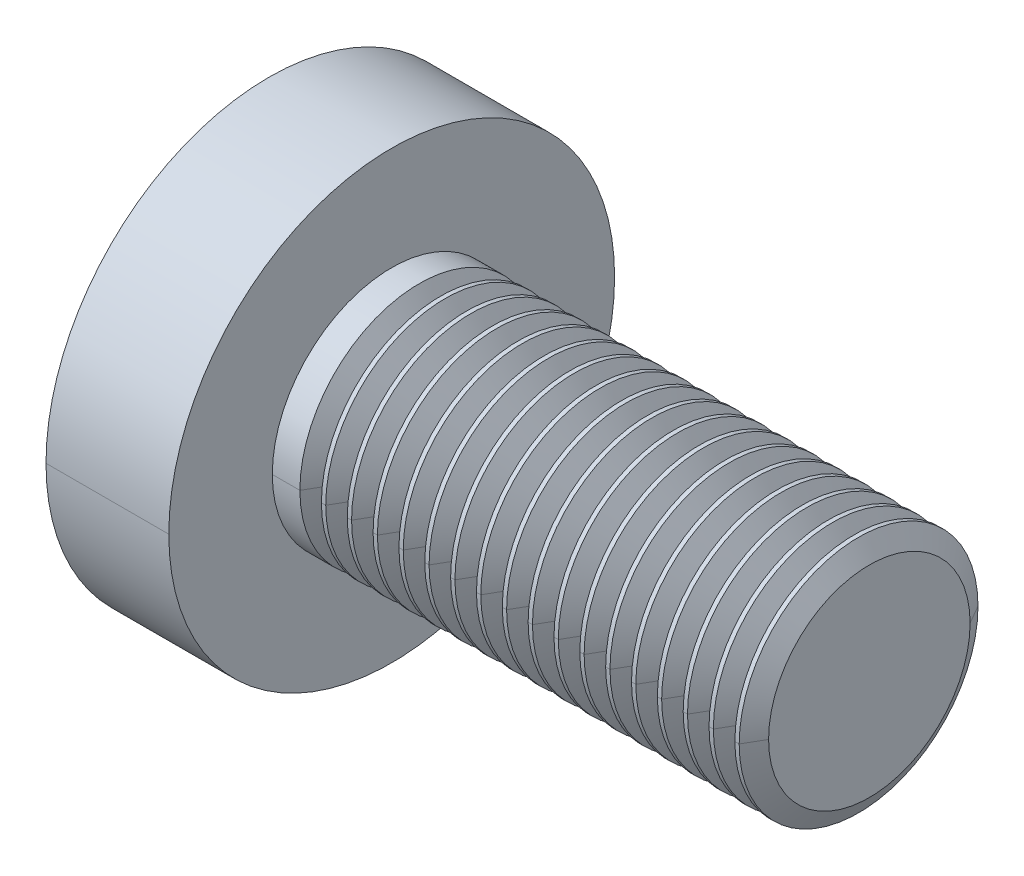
ISO-10303-21;
HEADER;
FILE_DESCRIPTION(('STEP AP214'),'2;1');
FILE_NAME('part.step','',(''),(''),'','','');
FILE_SCHEMA(('AUTOMOTIVE_DESIGN { 1 0 10303 214 1 1 1 1 }'));
ENDSEC;
DATA;
#1=APPLICATION_CONTEXT('core data for automotive mechanical design processes');
#2=APPLICATION_PROTOCOL_DEFINITION('international standard','automotive_design',2000,#1);
#3=PRODUCT_CONTEXT('',#1,'mechanical');
#4=PRODUCT('Part','Part','',(#3));
#5=PRODUCT_RELATED_PRODUCT_CATEGORY('part','',(#4));
#6=PRODUCT_DEFINITION_FORMATION('','',#4);
#7=PRODUCT_DEFINITION_CONTEXT('part definition',#1,'design');
#8=PRODUCT_DEFINITION('design','',#6,#7);
#9=PRODUCT_DEFINITION_SHAPE('','',#8);
#10=(LENGTH_UNIT() NAMED_UNIT(*) SI_UNIT(.MILLI.,.METRE.));
#11=(NAMED_UNIT(*) PLANE_ANGLE_UNIT() SI_UNIT($,.RADIAN.));
#12=(NAMED_UNIT(*) SI_UNIT($,.STERADIAN.) SOLID_ANGLE_UNIT());
#13=UNCERTAINTY_MEASURE_WITH_UNIT(LENGTH_MEASURE(1.E-05),#10,'distance_accuracy_value','');
#14=(GEOMETRIC_REPRESENTATION_CONTEXT(3) GLOBAL_UNCERTAINTY_ASSIGNED_CONTEXT((#13)) GLOBAL_UNIT_ASSIGNED_CONTEXT((#10,
#11,#12)) REPRESENTATION_CONTEXT('',''));
#15=CARTESIAN_POINT('',(0.,0.,0.));
#16=DIRECTION('',(0.,0.,1.));
#17=DIRECTION('',(1.,0.,0.));
#18=AXIS2_PLACEMENT_3D('',#15,#16,#17);
#19=CARTESIAN_POINT('',(1.68,-0.3,-0.3));
#20=DIRECTION('',(0.,0.,1.));
#21=DIRECTION('',(1.,0.,0.));
#22=AXIS2_PLACEMENT_3D('',#19,#20,#21);
#23=PLANE('',#22);
#24=DIRECTION('',(1.,0.,0.));
#25=VECTOR('',#24,1.);
#26=CARTESIAN_POINT('',(0.045204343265,-0.6,-0.3));
#27=LINE('',#26,#25);
#28=CARTESIAN_POINT('',(0.045204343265,-0.6,-0.3));
#29=VERTEX_POINT('',#28);
#30=CARTESIAN_POINT('',(1.558845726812,-0.6,-0.3));
#31=VERTEX_POINT('',#30);
#32=EDGE_CURVE('E2063',#29,#31,#27,.T.);
#33=ORIENTED_EDGE('',*,*,#32,.F.);
#34=CARTESIAN_POINT('',(5.,0.,-0.3));
#35=DIRECTION('',(0.,0.,1.));
#36=DIRECTION('',(-0.992747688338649,-0.120216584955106,0.));
#37=AXIS2_PLACEMENT_3D('',#34,#35,#36);
#38=CIRCLE('',#37,4.990991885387);
#39=CARTESIAN_POINT('',(0.2041921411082,-1.382109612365,-0.3));
#40=VERTEX_POINT('',#39);
#41=EDGE_CURVE('E1839',#29,#40,#38,.T.);
#42=ORIENTED_EDGE('',*,*,#41,.T.);
#43=DIRECTION('',(0.866025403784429,0.500000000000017,0.));
#44=VECTOR('',#43,1.);
#45=CARTESIAN_POINT('',(0.2041921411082,-1.382109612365,-0.3));
#46=LINE('',#45,#44);
#47=EDGE_CURVE('E757',#40,#31,#46,.T.);
#48=ORIENTED_EDGE('',*,*,#47,.T.);
#49=EDGE_LOOP('',(#33,#42,#48));
#50=FACE_BOUND('',#49,.T.);
#51=ADVANCED_FACE('F17',(#50),#23,.T.);
#52=CARTESIAN_POINT('',(1.68,0.6,0.6));
#53=DIRECTION('',(-1.,0.,0.));
#54=DIRECTION('',(0.,0.,1.));
#55=AXIS2_PLACEMENT_3D('',#52,#53,#54);
#56=CYLINDRICAL_SURFACE('',#55,0.3);
#57=CARTESIAN_POINT('',(1.68,0.3082685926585,0.5300515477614));
#58=CARTESIAN_POINT('',(1.639760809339,0.3026982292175,0.5532836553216));
#59=CARTESIAN_POINT('',(1.599373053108,0.3,0.5766015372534));
#60=CARTESIAN_POINT('',(1.558845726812,0.3,0.6));
#61=(BOUNDED_CURVE() B_SPLINE_CURVE(3,(#57,#58,#59,#60),.UNSPECIFIED.,.F.,
.F.) B_SPLINE_CURVE_WITH_KNOTS((4,4),(0.,1.),
.UNSPECIFIED.) CURVE() GEOMETRIC_REPRESENTATION_ITEM() RATIONAL_B_SPLINE_CURVE((1.,1.,1.,1.)) REPRESENTATION_ITEM(''));
#62=CARTESIAN_POINT('',(1.68,0.3082685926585,0.5300515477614));
#63=VERTEX_POINT('',#62);
#64=CARTESIAN_POINT('',(1.558845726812,0.3,0.6));
#65=VERTEX_POINT('',#64);
#66=EDGE_CURVE('E927',#63,#65,#61,.T.);
#67=ORIENTED_EDGE('',*,*,#66,.T.);
#68=DIRECTION('',(-1.,0.,0.));
#69=VECTOR('',#68,1.);
#70=CARTESIAN_POINT('',(1.558845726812,0.3,0.6));
#71=LINE('',#70,#69);
#72=CARTESIAN_POINT('',(0.045204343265,0.3,0.6));
#73=VERTEX_POINT('',#72);
#74=EDGE_CURVE('E1202',#65,#73,#71,.T.);
#75=ORIENTED_EDGE('',*,*,#74,.T.);
#76=CARTESIAN_POINT('',(0.0452043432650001,0.3,0.6));
#77=CARTESIAN_POINT('',(0.0445797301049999,0.299999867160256,0.594841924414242));
#78=CARTESIAN_POINT('',(0.043972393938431,0.300133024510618,0.589681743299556));
#79=CARTESIAN_POINT('',(0.0427971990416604,0.300663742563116,0.579407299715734));
#80=CARTESIAN_POINT('',(0.0422290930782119,0.301059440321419,0.574292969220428));
#81=CARTESIAN_POINT('',(0.0411323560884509,0.302109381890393,0.564123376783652));
#82=CARTESIAN_POINT('',(0.0406034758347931,0.302761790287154,0.559067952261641));
#83=CARTESIAN_POINT('',(0.0395851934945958,0.304318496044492,0.549028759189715));
#84=CARTESIAN_POINT('',(0.039095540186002,0.305220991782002,0.544044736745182));
#85=CARTESIAN_POINT('',(0.0381557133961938,0.307270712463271,0.534160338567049));
#86=CARTESIAN_POINT('',(0.0377052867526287,0.308416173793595,0.529259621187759));
#87=CARTESIAN_POINT('',(0.036843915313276,0.310944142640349,0.519553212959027));
#88=CARTESIAN_POINT('',(0.036432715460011,0.312324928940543,0.514747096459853));
#89=CARTESIAN_POINT('',(0.0356497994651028,0.315315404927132,0.505240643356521));
#90=CARTESIAN_POINT('',(0.0352778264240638,0.316923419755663,0.500539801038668));
#91=CARTESIAN_POINT('',(0.0345733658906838,0.32035979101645,0.491254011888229));
#92=CARTESIAN_POINT('',(0.034240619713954,0.322186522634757,0.486668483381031));
#93=CARTESIAN_POINT('',(0.0336146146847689,0.326051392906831,0.477622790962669));
#94=CARTESIAN_POINT('',(0.0333210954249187,0.32808796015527,0.473161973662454));
#95=CARTESIAN_POINT('',(0.0327735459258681,0.332363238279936,0.464374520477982));
#96=CARTESIAN_POINT('',(0.0325192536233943,0.334600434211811,0.460047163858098));
#97=CARTESIAN_POINT('',(0.0320501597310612,0.339267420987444,0.451534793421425));
#98=CARTESIAN_POINT('',(0.0318350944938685,0.341695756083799,0.44734899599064));
#99=CARTESIAN_POINT('',(0.0314444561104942,0.34673522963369,0.439127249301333));
#100=CARTESIAN_POINT('',(0.0312686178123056,0.349344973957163,0.435090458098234));
#101=CARTESIAN_POINT('',(0.0309564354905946,0.354737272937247,0.427173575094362));
#102=CARTESIAN_POINT('',(0.0308198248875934,0.357518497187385,0.423292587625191));
#103=CARTESIAN_POINT('',(0.0305860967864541,0.363243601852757,0.415693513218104));
#104=CARTESIAN_POINT('',(0.0304887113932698,0.366186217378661,0.411974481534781));
#105=CARTESIAN_POINT('',(0.03033344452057,0.372223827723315,0.404704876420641));
#106=CARTESIAN_POINT('',(0.0302752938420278,0.375317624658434,0.401153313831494));
#107=CARTESIAN_POINT('',(0.0301984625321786,0.381647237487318,0.394223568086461));
#108=CARTESIAN_POINT('',(0.0301795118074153,0.384881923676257,0.390844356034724));
#109=CARTESIAN_POINT('',(0.0301812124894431,0.391488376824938,0.384258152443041));
#110=CARTESIAN_POINT('',(0.0302016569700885,0.394859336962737,0.381050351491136));
#111=CARTESIAN_POINT('',(0.0302813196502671,0.40177117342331,0.374772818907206));
#112=CARTESIAN_POINT('',(0.0303408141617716,0.405313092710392,0.371704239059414));
#113=CARTESIAN_POINT('',(0.0304985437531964,0.412562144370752,0.365715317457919));
#114=CARTESIAN_POINT('',(0.0305970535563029,0.416270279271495,0.362796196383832));
#115=CARTESIAN_POINT('',(0.0308328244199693,0.423846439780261,0.357116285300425));
#116=CARTESIAN_POINT('',(0.0309703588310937,0.427715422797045,0.35435678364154));
#117=CARTESIAN_POINT('',(0.0312841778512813,0.435607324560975,0.349006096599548));
#118=CARTESIAN_POINT('',(0.0314607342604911,0.439631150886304,0.346416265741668));
#119=CARTESIAN_POINT('',(0.0318525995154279,0.447826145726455,0.34141475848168));
#120=CARTESIAN_POINT('',(0.0320681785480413,0.451998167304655,0.339004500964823));
#121=CARTESIAN_POINT('',(0.0325380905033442,0.460482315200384,0.334371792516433));
#122=CARTESIAN_POINT('',(0.0327926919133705,0.464795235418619,0.332150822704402));
#123=CARTESIAN_POINT('',(0.033340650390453,0.473553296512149,0.327906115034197));
#124=CARTESIAN_POINT('',(0.0336342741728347,0.477999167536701,0.325883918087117));
#125=CARTESIAN_POINT('',(0.0342602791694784,0.487014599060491,0.322045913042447));
#126=CARTESIAN_POINT('',(0.0345929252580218,0.491584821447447,0.320231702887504));
#127=CARTESIAN_POINT('',(0.0352969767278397,0.500839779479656,0.316818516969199));
#128=CARTESIAN_POINT('',(0.0356686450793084,0.50552510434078,0.315221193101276));
#129=CARTESIAN_POINT('',(0.0364507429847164,0.515000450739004,0.312250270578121));
#130=CARTESIAN_POINT('',(0.0368614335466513,0.519790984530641,0.310878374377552));
#131=CARTESIAN_POINT('',(0.0377215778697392,0.529466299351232,0.308366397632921));
#132=CARTESIAN_POINT('',(0.0381712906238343,0.534351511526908,0.307228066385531));
#133=CARTESIAN_POINT('',(0.0391094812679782,0.544205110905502,0.305190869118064));
#134=CARTESIAN_POINT('',(0.0395982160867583,0.549173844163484,0.304293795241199));
#135=CARTESIAN_POINT('',(0.0406144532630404,0.559182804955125,0.302746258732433));
#136=CARTESIAN_POINT('',(0.0411422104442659,0.564223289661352,0.302097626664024));
#137=CARTESIAN_POINT('',(0.0422364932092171,0.574363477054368,0.301053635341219));
#138=CARTESIAN_POINT('',(0.0428032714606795,0.579463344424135,0.300660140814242));
#139=CARTESIAN_POINT('',(0.0439756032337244,0.589709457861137,0.300132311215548));
#140=CARTESIAN_POINT('',(0.0445814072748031,0.594855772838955,0.299999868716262));
#141=CARTESIAN_POINT('',(0.0452043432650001,0.599999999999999,0.3));
#142=B_SPLINE_CURVE_WITH_KNOTS('',3,(#76,#77,#78,#79,#80,#81,#82,#83,#84,#85,#86,#87,#88,#89,
#90,#91,#92,#93,#94,#95,#96,#97,#98,#99,#100,#101,#102,#103,#104,#105,#106,#107,#108,#109,#110,
#111,#112,#113,#114,#115,#116,#117,#118,#119,#120,#121,#122,#123,#124,#125,#126,#127,#128,#129,
#130,#131,#132,#133,#134,#135,#136,#137,#138,#139,#140,#141),.UNSPECIFIED.,.F.,.F.,(4,2,2,2,2,2,
2,2,2,2,2,2,2,2,2,2,2,2,2,2,2,2,2,2,2,2,2,2,2,2,2,2,4),(0.,0.0155855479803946,
0.0310616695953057,0.0464290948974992,0.0616885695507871,0.0768408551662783,0.0918867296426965,
0.106826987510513,0.121662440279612,0.136393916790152,0.15102226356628,0.165548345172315,
0.179973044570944,0.194297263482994,0.208521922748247,0.22264796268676,0.236676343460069,
0.250631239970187,0.264685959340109,0.278841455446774,0.293098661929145,0.307458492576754,
0.321921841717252,0.336489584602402,0.351162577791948,0.365941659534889,0.380827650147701,
0.395821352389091,0.410923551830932,0.426135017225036,0.441456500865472,0.456888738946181,
0.472432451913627),.UNSPECIFIED.);
#143=CARTESIAN_POINT('',(0.045204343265,0.6,0.3));
#144=VERTEX_POINT('',#143);
#145=EDGE_CURVE('E1794',#73,#144,#142,.T.);
#146=ORIENTED_EDGE('',*,*,#145,.T.);
#147=DIRECTION('',(1.,0.,0.));
#148=VECTOR('',#147,1.);
#149=CARTESIAN_POINT('',(0.045204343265,0.6,0.3));
#150=LINE('',#149,#148);
#151=CARTESIAN_POINT('',(1.558845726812,0.6,0.3));
#152=VERTEX_POINT('',#151);
#153=EDGE_CURVE('E11',#144,#152,#150,.T.);
#154=ORIENTED_EDGE('',*,*,#153,.T.);
#155=CARTESIAN_POINT('',(1.68,0.5300515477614,0.3082685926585));
#156=CARTESIAN_POINT('',(1.639760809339,0.5532836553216,0.3026982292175));
#157=CARTESIAN_POINT('',(1.599373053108,0.5766015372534,0.3));
#158=CARTESIAN_POINT('',(1.558845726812,0.6,0.3));
#159=(BOUNDED_CURVE() B_SPLINE_CURVE(3,(#155,#156,#157,#158),.UNSPECIFIED.,.F.,
.F.) B_SPLINE_CURVE_WITH_KNOTS((4,4),(0.,1.),
.UNSPECIFIED.) CURVE() GEOMETRIC_REPRESENTATION_ITEM() RATIONAL_B_SPLINE_CURVE((1.,1.,1.,1.)) REPRESENTATION_ITEM(''));
#160=CARTESIAN_POINT('',(1.68,0.5300515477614,0.3082685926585));
#161=VERTEX_POINT('',#160);
#162=EDGE_CURVE('E768',#161,#152,#159,.T.);
#163=ORIENTED_EDGE('',*,*,#162,.F.);
#164=CARTESIAN_POINT('',(1.68,0.6,0.6));
#165=DIRECTION('',(1.,0.,0.));
#166=DIRECTION('',(0.,-0.972438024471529,-0.233161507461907));
#167=AXIS2_PLACEMENT_3D('',#164,#165,#166);
#168=CIRCLE('',#167,0.3);
#169=EDGE_CURVE('E793',#63,#161,#168,.T.);
#170=ORIENTED_EDGE('',*,*,#169,.F.);
#171=EDGE_LOOP('',(#67,#75,#146,#154,#163,#170));
#172=FACE_BOUND('',#171,.T.);
#173=ADVANCED_FACE('F1586',(#172),#56,.T.);
#174=CARTESIAN_POINT('',(1.68,0.3,0.3));
#175=DIRECTION('',(0.,0.,-1.));
#176=DIRECTION('',(0.,-1.,0.));
#177=AXIS2_PLACEMENT_3D('',#174,#175,#176);
#178=PLANE('',#177);
#179=ORIENTED_EDGE('',*,*,#153,.F.);
#180=CARTESIAN_POINT('',(5.,0.,0.3));
#181=DIRECTION('',(0.,0.,-1.));
#182=DIRECTION('',(-0.992747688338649,0.120216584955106,0.));
#183=AXIS2_PLACEMENT_3D('',#180,#181,#182);
#184=CIRCLE('',#183,4.990991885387);
#185=CARTESIAN_POINT('',(0.2041921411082,1.382109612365,0.3));
#186=VERTEX_POINT('',#185);
#187=EDGE_CURVE('E1852',#144,#186,#184,.T.);
#188=ORIENTED_EDGE('',*,*,#187,.T.);
#189=DIRECTION('',(0.866025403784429,-0.500000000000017,0.));
#190=VECTOR('',#189,1.);
#191=CARTESIAN_POINT('',(0.2041921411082,1.382109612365,0.3));
#192=LINE('',#191,#190);
#193=EDGE_CURVE('E972',#186,#152,#192,.T.);
#194=ORIENTED_EDGE('',*,*,#193,.T.);
#195=EDGE_LOOP('',(#179,#188,#194));
#196=FACE_BOUND('',#195,.T.);
#197=ADVANCED_FACE('F1582',(#196),#178,.T.);
#198=CARTESIAN_POINT('',(1.68,0.3,-0.3));
#199=DIRECTION('',(0.,-1.,0.));
#200=DIRECTION('',(0.,0.,-1.));
#201=AXIS2_PLACEMENT_3D('',#198,#199,#200);
#202=PLANE('',#201);
#203=DIRECTION('',(1.,0.,0.));
#204=VECTOR('',#203,1.);
#205=CARTESIAN_POINT('',(0.045204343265,0.3,-0.6));
#206=LINE('',#205,#204);
#207=CARTESIAN_POINT('',(0.045204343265,0.3,-0.6));
#208=VERTEX_POINT('',#207);
#209=CARTESIAN_POINT('',(1.558845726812,0.3,-0.6));
#210=VERTEX_POINT('',#209);
#211=EDGE_CURVE('E908',#208,#210,#206,.T.);
#212=ORIENTED_EDGE('',*,*,#211,.F.);
#213=CARTESIAN_POINT('',(5.,0.3,0.));
#214=DIRECTION('',(0.,-1.,0.));
#215=DIRECTION('',(-0.992747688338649,0.,-0.120216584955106));
#216=AXIS2_PLACEMENT_3D('',#213,#214,#215);
#217=CIRCLE('',#216,4.990991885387);
#218=CARTESIAN_POINT('',(0.2041921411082,0.3,-1.382109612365));
#219=VERTEX_POINT('',#218);
#220=EDGE_CURVE('E2012',#208,#219,#217,.T.);
#221=ORIENTED_EDGE('',*,*,#220,.T.);
#222=DIRECTION('',(0.866025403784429,0.,0.500000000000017));
#223=VECTOR('',#222,1.);
#224=CARTESIAN_POINT('',(0.2041921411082,0.3,-1.382109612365));
#225=LINE('',#224,#223);
#226=EDGE_CURVE('E42',#219,#210,#225,.T.);
#227=ORIENTED_EDGE('',*,*,#226,.T.);
#228=EDGE_LOOP('',(#212,#221,#227));
#229=FACE_BOUND('',#228,.T.);
#230=ADVANCED_FACE('F1585',(#229),#202,.T.);
#231=CARTESIAN_POINT('',(1.68,-0.3,-0.3));
#232=DIRECTION('',(0.,1.,0.));
#233=DIRECTION('',(1.,0.,0.));
#234=AXIS2_PLACEMENT_3D('',#231,#232,#233);
#235=PLANE('',#234);
#236=DIRECTION('',(-1.,0.,0.));
#237=VECTOR('',#236,1.);
#238=CARTESIAN_POINT('',(1.558845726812,-0.3,-0.6));
#239=LINE('',#238,#237);
#240=CARTESIAN_POINT('',(1.558845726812,-0.3,-0.6));
#241=VERTEX_POINT('',#240);
#242=CARTESIAN_POINT('',(0.045204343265,-0.3,-0.6));
#243=VERTEX_POINT('',#242);
#244=EDGE_CURVE('E1124',#241,#243,#239,.T.);
#245=ORIENTED_EDGE('',*,*,#244,.F.);
#246=DIRECTION('',(-0.866025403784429,0.,-0.500000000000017));
#247=VECTOR('',#246,1.);
#248=CARTESIAN_POINT('',(1.558845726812,-0.3,-0.6));
#249=LINE('',#248,#247);
#250=CARTESIAN_POINT('',(0.2041921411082,-0.3,-1.382109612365));
#251=VERTEX_POINT('',#250);
#252=EDGE_CURVE('E28',#241,#251,#249,.T.);
#253=ORIENTED_EDGE('',*,*,#252,.T.);
#254=CARTESIAN_POINT('',(5.,-0.3,0.));
#255=DIRECTION('',(0.,1.,0.));
#256=DIRECTION('',(-0.960892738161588,0.,-0.276920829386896));
#257=AXIS2_PLACEMENT_3D('',#254,#255,#256);
#258=CIRCLE('',#257,4.990991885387);
#259=EDGE_CURVE('E2046',#251,#243,#258,.T.);
#260=ORIENTED_EDGE('',*,*,#259,.T.);
#261=EDGE_LOOP('',(#245,#253,#260));
#262=FACE_BOUND('',#261,.T.);
#263=ADVANCED_FACE('F1608',(#262),#235,.T.);
#264=CARTESIAN_POINT('',(0.,0.,-1.5));
#265=DIRECTION('',(-0.500000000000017,0.,0.866025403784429));
#266=DIRECTION('',(0.,1.,0.));
#267=AXIS2_PLACEMENT_3D('',#264,#265,#266);
#268=PLANE('',#267);
#269=CARTESIAN_POINT('',(1.68,-0.3082685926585,-0.5300515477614));
#270=CARTESIAN_POINT('',(1.639760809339,-0.3026982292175,-0.5532836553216));
#271=CARTESIAN_POINT('',(1.599373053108,-0.3,-0.5766015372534));
#272=CARTESIAN_POINT('',(1.558845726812,-0.3,-0.6));
#273=(BOUNDED_CURVE() B_SPLINE_CURVE(3,(#269,#270,#271,#272),.UNSPECIFIED.,.F.,
.F.) B_SPLINE_CURVE_WITH_KNOTS((4,4),(0.,1.),
.UNSPECIFIED.) CURVE() GEOMETRIC_REPRESENTATION_ITEM() RATIONAL_B_SPLINE_CURVE((1.,1.,1.,1.)) REPRESENTATION_ITEM(''));
#274=CARTESIAN_POINT('',(1.68,-0.3082685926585,-0.5300515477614));
#275=VERTEX_POINT('',#274);
#276=EDGE_CURVE('E1118',#275,#241,#273,.T.);
#277=ORIENTED_EDGE('',*,*,#276,.F.);
#278=DIRECTION('',(0.,-1.,0.));
#279=VECTOR('',#278,1.);
#280=CARTESIAN_POINT('',(1.68,0.3082685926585,-0.5300515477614));
#281=LINE('',#280,#279);
#282=CARTESIAN_POINT('',(1.68,0.3082685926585,-0.5300515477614));
#283=VERTEX_POINT('',#282);
#284=EDGE_CURVE('E709',#283,#275,#281,.T.);
#285=ORIENTED_EDGE('',*,*,#284,.F.);
#286=CARTESIAN_POINT('',(1.68,0.3082685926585,-0.5300515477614));
#287=CARTESIAN_POINT('',(1.639760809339,0.3026982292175,-0.5532836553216));
#288=CARTESIAN_POINT('',(1.599373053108,0.3,-0.5766015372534));
#289=CARTESIAN_POINT('',(1.558845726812,0.3,-0.6));
#290=(BOUNDED_CURVE() B_SPLINE_CURVE(3,(#286,#287,#288,#289),.UNSPECIFIED.,.F.,
.F.) B_SPLINE_CURVE_WITH_KNOTS((4,4),(0.,1.),
.UNSPECIFIED.) CURVE() GEOMETRIC_REPRESENTATION_ITEM() RATIONAL_B_SPLINE_CURVE((1.,1.,1.,1.)) REPRESENTATION_ITEM(''));
#291=EDGE_CURVE('E903',#283,#210,#290,.T.);
#292=ORIENTED_EDGE('',*,*,#291,.T.);
#293=ORIENTED_EDGE('',*,*,#226,.F.);
#294=CARTESIAN_POINT('',(4.399519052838,0.,1.040063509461));
#295=DIRECTION('',(-0.50000000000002,0.,0.866025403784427));
#296=DIRECTION('',(-0.864369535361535,0.0618094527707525,-0.49904398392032));
#297=AXIS2_PLACEMENT_3D('',#294,#295,#296);
#298=CIRCLE('',#297,4.853626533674);
#299=EDGE_CURVE('E2015',#219,#251,#298,.T.);
#300=ORIENTED_EDGE('',*,*,#299,.T.);
#301=ORIENTED_EDGE('',*,*,#252,.F.);
#302=EDGE_LOOP('',(#277,#285,#292,#293,#300,#301));
#303=FACE_BOUND('',#302,.T.);
#304=ADVANCED_FACE('F1474',(#303),#268,.T.);
#305=CARTESIAN_POINT('',(1.68,0.6,-0.6));
#306=DIRECTION('',(-1.,0.,0.));
#307=DIRECTION('',(0.,0.,1.));
#308=AXIS2_PLACEMENT_3D('',#305,#306,#307);
#309=CYLINDRICAL_SURFACE('',#308,0.3);
#310=CARTESIAN_POINT('',(1.68,0.5300515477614,-0.3082685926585));
#311=CARTESIAN_POINT('',(1.639760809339,0.5532836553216,-0.3026982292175));
#312=CARTESIAN_POINT('',(1.599373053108,0.5766015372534,-0.3));
#313=CARTESIAN_POINT('',(1.558845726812,0.6,-0.3));
#314=(BOUNDED_CURVE() B_SPLINE_CURVE(3,(#310,#311,#312,#313),.UNSPECIFIED.,.F.,
.F.) B_SPLINE_CURVE_WITH_KNOTS((4,4),(0.,1.),
.UNSPECIFIED.) CURVE() GEOMETRIC_REPRESENTATION_ITEM() RATIONAL_B_SPLINE_CURVE((1.,1.,1.,1.)) REPRESENTATION_ITEM(''));
#315=CARTESIAN_POINT('',(1.68,0.5300515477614,-0.3082685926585));
#316=VERTEX_POINT('',#315);
#317=CARTESIAN_POINT('',(1.558845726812,0.6,-0.3));
#318=VERTEX_POINT('',#317);
#319=EDGE_CURVE('E759',#316,#318,#314,.T.);
#320=ORIENTED_EDGE('',*,*,#319,.T.);
#321=DIRECTION('',(-1.,0.,0.));
#322=VECTOR('',#321,1.);
#323=CARTESIAN_POINT('',(1.558845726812,0.6,-0.3));
#324=LINE('',#323,#322);
#325=CARTESIAN_POINT('',(0.045204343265,0.6,-0.3));
#326=VERTEX_POINT('',#325);
#327=EDGE_CURVE('E1351',#318,#326,#324,.T.);
#328=ORIENTED_EDGE('',*,*,#327,.T.);
#329=CARTESIAN_POINT('',(0.0452043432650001,0.600000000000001,-0.3));
#330=CARTESIAN_POINT('',(0.0445797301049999,0.594841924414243,-0.299999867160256));
#331=CARTESIAN_POINT('',(0.0439723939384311,0.589681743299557,-0.300133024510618));
#332=CARTESIAN_POINT('',(0.0427971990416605,0.579407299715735,-0.300663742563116));
#333=CARTESIAN_POINT('',(0.0422290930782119,0.574292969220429,-0.301059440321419));
#334=CARTESIAN_POINT('',(0.0411323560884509,0.564123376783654,-0.302109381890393));
#335=CARTESIAN_POINT('',(0.0406034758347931,0.559067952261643,-0.302761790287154));
#336=CARTESIAN_POINT('',(0.0395851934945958,0.549028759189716,-0.304318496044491));
#337=CARTESIAN_POINT('',(0.039095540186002,0.544044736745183,-0.305220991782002));
#338=CARTESIAN_POINT('',(0.0381557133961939,0.53416033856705,-0.307270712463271));
#339=CARTESIAN_POINT('',(0.0377052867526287,0.52925962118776,-0.308416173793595));
#340=CARTESIAN_POINT('',(0.036843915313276,0.519553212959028,-0.310944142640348));
#341=CARTESIAN_POINT('',(0.036432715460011,0.514747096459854,-0.312324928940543));
#342=CARTESIAN_POINT('',(0.0356497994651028,0.505240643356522,-0.315315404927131));
#343=CARTESIAN_POINT('',(0.0352778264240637,0.500539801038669,-0.316923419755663));
#344=CARTESIAN_POINT('',(0.0345733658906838,0.49125401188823,-0.32035979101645));
#345=CARTESIAN_POINT('',(0.034240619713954,0.486668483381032,-0.322186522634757));
#346=CARTESIAN_POINT('',(0.0336146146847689,0.477622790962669,-0.326051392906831));
#347=CARTESIAN_POINT('',(0.0333210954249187,0.473161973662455,-0.32808796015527));
#348=CARTESIAN_POINT('',(0.0327735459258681,0.464374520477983,-0.332363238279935));
#349=CARTESIAN_POINT('',(0.0325192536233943,0.460047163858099,-0.334600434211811));
#350=CARTESIAN_POINT('',(0.0320501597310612,0.451534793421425,-0.339267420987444));
#351=CARTESIAN_POINT('',(0.0318350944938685,0.447348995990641,-0.341695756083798));
#352=CARTESIAN_POINT('',(0.0314444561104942,0.439127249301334,-0.346735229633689));
#353=CARTESIAN_POINT('',(0.0312686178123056,0.435090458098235,-0.349344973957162));
#354=CARTESIAN_POINT('',(0.0309564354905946,0.427173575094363,-0.354737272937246));
#355=CARTESIAN_POINT('',(0.0308198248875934,0.423292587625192,-0.357518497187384));
#356=CARTESIAN_POINT('',(0.0305860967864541,0.415693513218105,-0.363243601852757));
#357=CARTESIAN_POINT('',(0.0304887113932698,0.411974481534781,-0.366186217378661));
#358=CARTESIAN_POINT('',(0.03033344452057,0.404704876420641,-0.372223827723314));
#359=CARTESIAN_POINT('',(0.0302752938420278,0.401153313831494,-0.375317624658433));
#360=CARTESIAN_POINT('',(0.0301984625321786,0.394223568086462,-0.381647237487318));
#361=CARTESIAN_POINT('',(0.0301795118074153,0.390844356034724,-0.384881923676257));
#362=CARTESIAN_POINT('',(0.0301812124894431,0.384258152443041,-0.391488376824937));
#363=CARTESIAN_POINT('',(0.0302016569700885,0.381050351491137,-0.394859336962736));
#364=CARTESIAN_POINT('',(0.0302813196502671,0.374772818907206,-0.401771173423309));
#365=CARTESIAN_POINT('',(0.0303408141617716,0.371704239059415,-0.405313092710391));
#366=CARTESIAN_POINT('',(0.0304985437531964,0.36571531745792,-0.412562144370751));
#367=CARTESIAN_POINT('',(0.0305970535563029,0.362796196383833,-0.416270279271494));
#368=CARTESIAN_POINT('',(0.0308328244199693,0.357116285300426,-0.423846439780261));
#369=CARTESIAN_POINT('',(0.0309703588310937,0.354356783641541,-0.427715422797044));
#370=CARTESIAN_POINT('',(0.0312841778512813,0.349006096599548,-0.435607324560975));
#371=CARTESIAN_POINT('',(0.0314607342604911,0.346416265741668,-0.439631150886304));
#372=CARTESIAN_POINT('',(0.0318525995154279,0.34141475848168,-0.447826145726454));
#373=CARTESIAN_POINT('',(0.0320681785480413,0.339004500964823,-0.451998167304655));
#374=CARTESIAN_POINT('',(0.0325380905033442,0.334371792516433,-0.460482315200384));
#375=CARTESIAN_POINT('',(0.0327926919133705,0.332150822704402,-0.464795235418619));
#376=CARTESIAN_POINT('',(0.033340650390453,0.327906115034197,-0.473553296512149));
#377=CARTESIAN_POINT('',(0.0336342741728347,0.325883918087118,-0.477999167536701));
#378=CARTESIAN_POINT('',(0.0342602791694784,0.322045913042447,-0.487014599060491));
#379=CARTESIAN_POINT('',(0.0345929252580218,0.320231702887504,-0.491584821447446));
#380=CARTESIAN_POINT('',(0.0352969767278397,0.316818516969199,-0.500839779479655));
#381=CARTESIAN_POINT('',(0.0356686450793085,0.315221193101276,-0.50552510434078));
#382=CARTESIAN_POINT('',(0.0364507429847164,0.312250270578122,-0.515000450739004));
#383=CARTESIAN_POINT('',(0.0368614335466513,0.310878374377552,-0.51979098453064));
#384=CARTESIAN_POINT('',(0.0377215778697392,0.308366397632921,-0.529466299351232));
#385=CARTESIAN_POINT('',(0.0381712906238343,0.307228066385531,-0.534351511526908));
#386=CARTESIAN_POINT('',(0.0391094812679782,0.305190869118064,-0.544205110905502));
#387=CARTESIAN_POINT('',(0.0395982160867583,0.304293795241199,-0.549173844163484));
#388=CARTESIAN_POINT('',(0.0406144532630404,0.302746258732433,-0.559182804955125));
#389=CARTESIAN_POINT('',(0.0411422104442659,0.302097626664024,-0.564223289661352));
#390=CARTESIAN_POINT('',(0.0422364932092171,0.301053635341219,-0.574363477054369));
#391=CARTESIAN_POINT('',(0.0428032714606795,0.300660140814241,-0.579463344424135));
#392=CARTESIAN_POINT('',(0.0439756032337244,0.300132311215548,-0.589709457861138));
#393=CARTESIAN_POINT('',(0.0445814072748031,0.299999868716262,-0.594855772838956));
#394=CARTESIAN_POINT('',(0.0452043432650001,0.3,-0.6));
#395=B_SPLINE_CURVE_WITH_KNOTS('',3,(#329,#330,#331,#332,#333,#334,#335,#336,#337,#338,#339,
#340,#341,#342,#343,#344,#345,#346,#347,#348,#349,#350,#351,#352,#353,#354,#355,#356,#357,#358,
#359,#360,#361,#362,#363,#364,#365,#366,#367,#368,#369,#370,#371,#372,#373,#374,#375,#376,#377,
#378,#379,#380,#381,#382,#383,#384,#385,#386,#387,#388,#389,#390,#391,#392,#393,#394),
.UNSPECIFIED.,.F.,.F.,(4,2,2,2,2,2,2,2,2,2,2,2,2,2,2,2,2,2,2,2,2,2,2,2,2,2,2,2,2,2,2,2,4),(0.,
0.015585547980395,0.0310616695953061,0.0464290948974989,0.0616885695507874,0.0768408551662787,
0.0918867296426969,0.106826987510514,0.121662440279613,0.136393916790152,0.151022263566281,
0.165548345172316,0.179973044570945,0.194297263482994,0.208521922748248,0.222647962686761,
0.236676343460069,0.250631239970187,0.26468595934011,0.278841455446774,0.293098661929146,
0.307458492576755,0.321921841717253,0.336489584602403,0.351162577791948,0.36594165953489,
0.380827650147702,0.395821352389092,0.410923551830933,0.426135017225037,0.441456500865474,
0.456888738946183,0.472432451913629),.UNSPECIFIED.);
#396=EDGE_CURVE('E1457',#326,#208,#395,.T.);
#397=ORIENTED_EDGE('',*,*,#396,.T.);
#398=ORIENTED_EDGE('',*,*,#211,.T.);
#399=ORIENTED_EDGE('',*,*,#291,.F.);
#400=CARTESIAN_POINT('',(1.68,0.6,-0.6));
#401=DIRECTION('',(1.,0.,0.));
#402=DIRECTION('',(0.,-0.233161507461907,0.972438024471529));
#403=AXIS2_PLACEMENT_3D('',#400,#401,#402);
#404=CIRCLE('',#403,0.3);
#405=EDGE_CURVE('E809',#316,#283,#404,.T.);
#406=ORIENTED_EDGE('',*,*,#405,.F.);
#407=EDGE_LOOP('',(#320,#328,#397,#398,#399,#406));
#408=FACE_BOUND('',#407,.T.);
#409=ADVANCED_FACE('F1464',(#408),#309,.T.);
#410=CARTESIAN_POINT('',(1.68,0.3,-0.3));
#411=DIRECTION('',(0.,0.,1.));
#412=DIRECTION('',(1.,0.,0.));
#413=AXIS2_PLACEMENT_3D('',#410,#411,#412);
#414=PLANE('',#413);
#415=ORIENTED_EDGE('',*,*,#327,.F.);
#416=DIRECTION('',(-0.866025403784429,0.500000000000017,0.));
#417=VECTOR('',#416,1.);
#418=CARTESIAN_POINT('',(1.558845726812,0.6,-0.3));
#419=LINE('',#418,#417);
#420=CARTESIAN_POINT('',(0.2041921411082,1.382109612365,-0.3));
#421=VERTEX_POINT('',#420);
#422=EDGE_CURVE('E1348',#318,#421,#419,.T.);
#423=ORIENTED_EDGE('',*,*,#422,.T.);
#424=CARTESIAN_POINT('',(5.,0.,-0.3));
#425=DIRECTION('',(0.,0.,1.));
#426=DIRECTION('',(-0.960892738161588,0.276920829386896,0.));
#427=AXIS2_PLACEMENT_3D('',#424,#425,#426);
#428=CIRCLE('',#427,4.990991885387);
#429=EDGE_CURVE('E1277',#421,#326,#428,.T.);
#430=ORIENTED_EDGE('',*,*,#429,.T.);
#431=EDGE_LOOP('',(#415,#423,#430));
#432=FACE_BOUND('',#431,.T.);
#433=ADVANCED_FACE('F1473',(#432),#414,.T.);
#434=CARTESIAN_POINT('',(0.,1.5,0.));
#435=DIRECTION('',(-0.500000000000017,-0.866025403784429,0.));
#436=DIRECTION('',(-0.866025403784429,0.500000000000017,0.));
#437=AXIS2_PLACEMENT_3D('',#434,#435,#436);
#438=PLANE('',#437);
#439=ORIENTED_EDGE('',*,*,#319,.F.);
#440=DIRECTION('',(0.,0.,-1.));
#441=VECTOR('',#440,1.);
#442=CARTESIAN_POINT('',(1.68,0.5300515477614,0.3082685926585));
#443=LINE('',#442,#441);
#444=EDGE_CURVE('E813',#161,#316,#443,.T.);
#445=ORIENTED_EDGE('',*,*,#444,.F.);
#446=ORIENTED_EDGE('',*,*,#162,.T.);
#447=ORIENTED_EDGE('',*,*,#193,.F.);
#448=CARTESIAN_POINT('',(4.399519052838,-1.040063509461,0.));
#449=DIRECTION('',(-0.50000000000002,-0.866025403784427,0.));
#450=DIRECTION('',(-0.864369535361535,0.49904398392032,0.0618094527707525));
#451=AXIS2_PLACEMENT_3D('',#448,#449,#450);
#452=CIRCLE('',#451,4.853626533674);
#453=CARTESIAN_POINT('',(0.1961551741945,1.386749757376,0.));
#454=VERTEX_POINT('',#453);
#455=EDGE_CURVE('E1395',#186,#454,#452,.T.);
#456=ORIENTED_EDGE('',*,*,#455,.T.);
#457=CARTESIAN_POINT('',(4.399519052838,-1.040063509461,0.));
#458=DIRECTION('',(-0.500000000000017,-0.866025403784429,0.));
#459=DIRECTION('',(-0.866025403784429,0.500000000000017,0.));
#460=AXIS2_PLACEMENT_3D('',#457,#458,#459);
#461=CIRCLE('',#460,4.853626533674);
#462=EDGE_CURVE('E1273',#454,#421,#461,.T.);
#463=ORIENTED_EDGE('',*,*,#462,.T.);
#464=ORIENTED_EDGE('',*,*,#422,.F.);
#465=EDGE_LOOP('',(#439,#445,#446,#447,#456,#463,#464));
#466=FACE_BOUND('',#465,.T.);
#467=ADVANCED_FACE('F1662',(#466),#438,.T.);
#468=CARTESIAN_POINT('',(3.138775,0.,0.));
#469=DIRECTION('',(-1.,0.,0.));
#470=DIRECTION('',(0.,0.,1.));
#471=AXIS2_PLACEMENT_3D('',#468,#469,#470);
#472=CONICAL_SURFACE('',#471,1.382870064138,1.0471975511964);
#473=CARTESIAN_POINT('',(3.2064,0.,0.));
#474=DIRECTION('',(1.,0.,0.));
#475=DIRECTION('',(0.,0.,1.));
#476=AXIS2_PLACEMENT_3D('',#473,#474,#475);
#477=CIRCLE('',#476,1.265740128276);
#478=CARTESIAN_POINT('',(3.2064,0.,1.265740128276));
#479=VERTEX_POINT('',#478);
#480=CARTESIAN_POINT('',(3.2064,0.,-1.265740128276));
#481=VERTEX_POINT('',#480);
#482=EDGE_CURVE('E1137',#479,#481,#477,.T.);
#483=ORIENTED_EDGE('',*,*,#482,.F.);
#484=DIRECTION('',(0.500000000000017,0.,-0.866025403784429));
#485=VECTOR('',#484,1.);
#486=CARTESIAN_POINT('',(3.07115,0.,1.5));
#487=LINE('',#486,#485);
#488=CARTESIAN_POINT('',(3.07115,0.,1.5));
#489=VERTEX_POINT('',#488);
#490=EDGE_CURVE('E719',#489,#479,#487,.T.);
#491=ORIENTED_EDGE('',*,*,#490,.F.);
#492=CARTESIAN_POINT('',(3.07115,0.,0.));
#493=DIRECTION('',(1.,0.,0.));
#494=DIRECTION('',(0.,0.,1.));
#495=AXIS2_PLACEMENT_3D('',#492,#493,#494);
#496=CIRCLE('',#495,1.5);
#497=CARTESIAN_POINT('',(3.07115,0.,-1.5));
#498=VERTEX_POINT('',#497);
#499=EDGE_CURVE('E869',#489,#498,#496,.T.);
#500=ORIENTED_EDGE('',*,*,#499,.T.);
#501=DIRECTION('',(0.500000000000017,0.,0.866025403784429));
#502=VECTOR('',#501,1.);
#503=CARTESIAN_POINT('',(3.07115,0.,-1.5));
#504=LINE('',#503,#502);
#505=EDGE_CURVE('E716',#498,#481,#504,.T.);
#506=ORIENTED_EDGE('',*,*,#505,.T.);
#507=EDGE_LOOP('',(#483,#491,#500,#506));
#508=FACE_BOUND('',#507,.T.);
#509=ADVANCED_FACE('F1707',(#508),#472,.T.);
#510=CARTESIAN_POINT('',(3.463375,0.,0.));
#511=DIRECTION('',(-1.,0.,0.));
#512=DIRECTION('',(0.,0.,1.));
#513=AXIS2_PLACEMENT_3D('',#510,#511,#512);
#514=CONICAL_SURFACE('',#513,1.382870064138,1.0471975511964);
#515=CARTESIAN_POINT('',(3.531,0.,0.));
#516=DIRECTION('',(1.,0.,0.));
#517=DIRECTION('',(0.,0.,1.));
#518=AXIS2_PLACEMENT_3D('',#515,#516,#517);
#519=CIRCLE('',#518,1.265740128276);
#520=CARTESIAN_POINT('',(3.531,0.,1.265740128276));
#521=VERTEX_POINT('',#520);
#522=CARTESIAN_POINT('',(3.531,0.,-1.265740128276));
#523=VERTEX_POINT('',#522);
#524=EDGE_CURVE('E1017',#521,#523,#519,.T.);
#525=ORIENTED_EDGE('',*,*,#524,.F.);
#526=DIRECTION('',(0.500000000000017,0.,-0.866025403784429));
#527=VECTOR('',#526,1.);
#528=CARTESIAN_POINT('',(3.39575,0.,1.5));
#529=LINE('',#528,#527);
#530=CARTESIAN_POINT('',(3.39575,0.,1.5));
#531=VERTEX_POINT('',#530);
#532=EDGE_CURVE('E1323',#531,#521,#529,.T.);
#533=ORIENTED_EDGE('',*,*,#532,.F.);
#534=CARTESIAN_POINT('',(3.39575,0.,0.));
#535=DIRECTION('',(1.,0.,0.));
#536=DIRECTION('',(0.,0.,1.));
#537=AXIS2_PLACEMENT_3D('',#534,#535,#536);
#538=CIRCLE('',#537,1.5);
#539=CARTESIAN_POINT('',(3.39575,0.,-1.5));
#540=VERTEX_POINT('',#539);
#541=EDGE_CURVE('E782',#531,#540,#538,.T.);
#542=ORIENTED_EDGE('',*,*,#541,.T.);
#543=DIRECTION('',(0.500000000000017,0.,0.866025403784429));
#544=VECTOR('',#543,1.);
#545=CARTESIAN_POINT('',(3.39575,0.,-1.5));
#546=LINE('',#545,#544);
#547=EDGE_CURVE('E1293',#540,#523,#546,.T.);
#548=ORIENTED_EDGE('',*,*,#547,.T.);
#549=EDGE_LOOP('',(#525,#533,#542,#548));
#550=FACE_BOUND('',#549,.T.);
#551=ADVANCED_FACE('F1710',(#550),#514,.T.);
#552=CARTESIAN_POINT('',(3.787975,0.,0.));
#553=DIRECTION('',(-1.,0.,0.));
#554=DIRECTION('',(0.,0.,1.));
#555=AXIS2_PLACEMENT_3D('',#552,#553,#554);
#556=CONICAL_SURFACE('',#555,1.382870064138,1.0471975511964);
#557=CARTESIAN_POINT('',(3.8556,0.,0.));
#558=DIRECTION('',(1.,0.,0.));
#559=DIRECTION('',(0.,0.,1.));
#560=AXIS2_PLACEMENT_3D('',#557,#558,#559);
#561=CIRCLE('',#560,1.265740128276);
#562=CARTESIAN_POINT('',(3.8556,0.,1.265740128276));
#563=VERTEX_POINT('',#562);
#564=CARTESIAN_POINT('',(3.8556,0.,-1.265740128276));
#565=VERTEX_POINT('',#564);
#566=EDGE_CURVE('E1015',#563,#565,#561,.T.);
#567=ORIENTED_EDGE('',*,*,#566,.F.);
#568=DIRECTION('',(0.500000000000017,0.,-0.866025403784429));
#569=VECTOR('',#568,1.);
#570=CARTESIAN_POINT('',(3.72035,0.,1.5));
#571=LINE('',#570,#569);
#572=CARTESIAN_POINT('',(3.72035,0.,1.5));
#573=VERTEX_POINT('',#572);
#574=EDGE_CURVE('E921',#573,#563,#571,.T.);
#575=ORIENTED_EDGE('',*,*,#574,.F.);
#576=CARTESIAN_POINT('',(3.72035,0.,0.));
#577=DIRECTION('',(1.,0.,0.));
#578=DIRECTION('',(0.,0.,1.));
#579=AXIS2_PLACEMENT_3D('',#576,#577,#578);
#580=CIRCLE('',#579,1.5);
#581=CARTESIAN_POINT('',(3.72035,0.,-1.5));
#582=VERTEX_POINT('',#581);
#583=EDGE_CURVE('E1167',#573,#582,#580,.T.);
#584=ORIENTED_EDGE('',*,*,#583,.T.);
#585=DIRECTION('',(0.500000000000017,0.,0.866025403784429));
#586=VECTOR('',#585,1.);
#587=CARTESIAN_POINT('',(3.72035,0.,-1.5));
#588=LINE('',#587,#586);
#589=EDGE_CURVE('E917',#582,#565,#588,.T.);
#590=ORIENTED_EDGE('',*,*,#589,.T.);
#591=EDGE_LOOP('',(#567,#575,#584,#590));
#592=FACE_BOUND('',#591,.T.);
#593=ADVANCED_FACE('F2683',(#592),#556,.T.);
#594=CARTESIAN_POINT('',(4.112575,0.,0.));
#595=DIRECTION('',(-1.,0.,0.));
#596=DIRECTION('',(0.,0.,1.));
#597=AXIS2_PLACEMENT_3D('',#594,#595,#596);
#598=CONICAL_SURFACE('',#597,1.382870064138,1.0471975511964);
#599=CARTESIAN_POINT('',(4.1802,0.,0.));
#600=DIRECTION('',(1.,0.,0.));
#601=DIRECTION('',(0.,0.,1.));
#602=AXIS2_PLACEMENT_3D('',#599,#600,#601);
#603=CIRCLE('',#602,1.265740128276);
#604=CARTESIAN_POINT('',(4.1802,0.,1.265740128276));
#605=VERTEX_POINT('',#604);
#606=CARTESIAN_POINT('',(4.1802,0.,-1.265740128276));
#607=VERTEX_POINT('',#606);
#608=EDGE_CURVE('E631',#605,#607,#603,.T.);
#609=ORIENTED_EDGE('',*,*,#608,.F.);
#610=DIRECTION('',(0.500000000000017,0.,-0.866025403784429));
#611=VECTOR('',#610,1.);
#612=CARTESIAN_POINT('',(4.04495,0.,1.5));
#613=LINE('',#612,#611);
#614=CARTESIAN_POINT('',(4.04495,0.,1.5));
#615=VERTEX_POINT('',#614);
#616=EDGE_CURVE('E635',#615,#605,#613,.T.);
#617=ORIENTED_EDGE('',*,*,#616,.F.);
#618=CARTESIAN_POINT('',(4.04495,0.,0.));
#619=DIRECTION('',(1.,0.,0.));
#620=DIRECTION('',(0.,0.,1.));
#621=AXIS2_PLACEMENT_3D('',#618,#619,#620);
#622=CIRCLE('',#621,1.5);
#623=CARTESIAN_POINT('',(4.04495,0.,-1.5));
#624=VERTEX_POINT('',#623);
#625=EDGE_CURVE('E688',#615,#624,#622,.T.);
#626=ORIENTED_EDGE('',*,*,#625,.T.);
#627=DIRECTION('',(0.500000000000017,0.,0.866025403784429));
#628=VECTOR('',#627,1.);
#629=CARTESIAN_POINT('',(4.04495,0.,-1.5));
#630=LINE('',#629,#628);
#631=EDGE_CURVE('E637',#624,#607,#630,.T.);
#632=ORIENTED_EDGE('',*,*,#631,.T.);
#633=EDGE_LOOP('',(#609,#617,#626,#632));
#634=FACE_BOUND('',#633,.T.);
#635=ADVANCED_FACE('F19',(#634),#598,.T.);
#636=CARTESIAN_POINT('',(4.437175,0.,0.));
#637=DIRECTION('',(-1.,0.,0.));
#638=DIRECTION('',(0.,0.,1.));
#639=AXIS2_PLACEMENT_3D('',#636,#637,#638);
#640=CONICAL_SURFACE('',#639,1.382870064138,1.0471975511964);
#641=CARTESIAN_POINT('',(4.5048,0.,0.));
#642=DIRECTION('',(1.,0.,0.));
#643=DIRECTION('',(0.,0.,1.));
#644=AXIS2_PLACEMENT_3D('',#641,#642,#643);
#645=CIRCLE('',#644,1.265740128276);
#646=CARTESIAN_POINT('',(4.5048,0.,1.265740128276));
#647=VERTEX_POINT('',#646);
#648=CARTESIAN_POINT('',(4.5048,0.,-1.265740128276));
#649=VERTEX_POINT('',#648);
#650=EDGE_CURVE('E1324',#647,#649,#645,.T.);
#651=ORIENTED_EDGE('',*,*,#650,.F.);
#652=DIRECTION('',(0.500000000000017,0.,-0.866025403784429));
#653=VECTOR('',#652,1.);
#654=CARTESIAN_POINT('',(4.36955,0.,1.5));
#655=LINE('',#654,#653);
#656=CARTESIAN_POINT('',(4.36955,0.,1.5));
#657=VERTEX_POINT('',#656);
#658=EDGE_CURVE('E1010',#657,#647,#655,.T.);
#659=ORIENTED_EDGE('',*,*,#658,.F.);
#660=CARTESIAN_POINT('',(4.36955,0.,0.));
#661=DIRECTION('',(1.,0.,0.));
#662=DIRECTION('',(0.,0.,1.));
#663=AXIS2_PLACEMENT_3D('',#660,#661,#662);
#664=CIRCLE('',#663,1.5);
#665=CARTESIAN_POINT('',(4.36955,0.,-1.5));
#666=VERTEX_POINT('',#665);
#667=EDGE_CURVE('E803',#657,#666,#664,.T.);
#668=ORIENTED_EDGE('',*,*,#667,.T.);
#669=DIRECTION('',(0.500000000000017,0.,0.866025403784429));
#670=VECTOR('',#669,1.);
#671=CARTESIAN_POINT('',(4.36955,0.,-1.5));
#672=LINE('',#671,#670);
#673=EDGE_CURVE('E1171',#666,#649,#672,.T.);
#674=ORIENTED_EDGE('',*,*,#673,.T.);
#675=EDGE_LOOP('',(#651,#659,#668,#674));
#676=FACE_BOUND('',#675,.T.);
#677=ADVANCED_FACE('F1994',(#676),#640,.T.);
#678=CARTESIAN_POINT('',(4.761775,0.,0.));
#679=DIRECTION('',(-1.,0.,0.));
#680=DIRECTION('',(0.,0.,1.));
#681=AXIS2_PLACEMENT_3D('',#678,#679,#680);
#682=CONICAL_SURFACE('',#681,1.382870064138,1.0471975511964);
#683=CARTESIAN_POINT('',(4.8294,0.,0.));
#684=DIRECTION('',(1.,0.,0.));
#685=DIRECTION('',(0.,0.,1.));
#686=AXIS2_PLACEMENT_3D('',#683,#684,#685);
#687=CIRCLE('',#686,1.265740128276);
#688=CARTESIAN_POINT('',(4.8294,0.,1.265740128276));
#689=VERTEX_POINT('',#688);
#690=CARTESIAN_POINT('',(4.8294,0.,-1.265740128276));
#691=VERTEX_POINT('',#690);
#692=EDGE_CURVE('E1042',#689,#691,#687,.T.);
#693=ORIENTED_EDGE('',*,*,#692,.F.);
#694=DIRECTION('',(0.500000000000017,0.,-0.866025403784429));
#695=VECTOR('',#694,1.);
#696=CARTESIAN_POINT('',(4.69415,0.,1.5));
#697=LINE('',#696,#695);
#698=CARTESIAN_POINT('',(4.69415,0.,1.5));
#699=VERTEX_POINT('',#698);
#700=EDGE_CURVE('E1072',#699,#689,#697,.T.);
#701=ORIENTED_EDGE('',*,*,#700,.F.);
#702=CARTESIAN_POINT('',(4.69415,0.,0.));
#703=DIRECTION('',(1.,0.,0.));
#704=DIRECTION('',(0.,0.,1.));
#705=AXIS2_PLACEMENT_3D('',#702,#703,#704);
#706=CIRCLE('',#705,1.5);
#707=CARTESIAN_POINT('',(4.69415,0.,-1.5));
#708=VERTEX_POINT('',#707);
#709=EDGE_CURVE('E973',#699,#708,#706,.T.);
#710=ORIENTED_EDGE('',*,*,#709,.T.);
#711=DIRECTION('',(0.500000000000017,0.,0.866025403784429));
#712=VECTOR('',#711,1.);
#713=CARTESIAN_POINT('',(4.69415,0.,-1.5));
#714=LINE('',#713,#712);
#715=EDGE_CURVE('E1068',#708,#691,#714,.T.);
#716=ORIENTED_EDGE('',*,*,#715,.T.);
#717=EDGE_LOOP('',(#693,#701,#710,#716));
#718=FACE_BOUND('',#717,.T.);
#719=ADVANCED_FACE('F1980',(#718),#682,.T.);
#720=CARTESIAN_POINT('',(5.086375,0.,0.));
#721=DIRECTION('',(-1.,0.,0.));
#722=DIRECTION('',(0.,0.,1.));
#723=AXIS2_PLACEMENT_3D('',#720,#721,#722);
#724=CONICAL_SURFACE('',#723,1.382870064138,1.0471975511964);
#725=CARTESIAN_POINT('',(5.154,0.,0.));
#726=DIRECTION('',(1.,0.,0.));
#727=DIRECTION('',(0.,0.,1.));
#728=AXIS2_PLACEMENT_3D('',#725,#726,#727);
#729=CIRCLE('',#728,1.265740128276);
#730=CARTESIAN_POINT('',(5.154,0.,1.265740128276));
#731=VERTEX_POINT('',#730);
#732=CARTESIAN_POINT('',(5.154,0.,-1.265740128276));
#733=VERTEX_POINT('',#732);
#734=EDGE_CURVE('E999',#731,#733,#729,.T.);
#735=ORIENTED_EDGE('',*,*,#734,.F.);
#736=DIRECTION('',(0.500000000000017,0.,-0.866025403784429));
#737=VECTOR('',#736,1.);
#738=CARTESIAN_POINT('',(5.01875,0.,1.5));
#739=LINE('',#738,#737);
#740=CARTESIAN_POINT('',(5.01875,0.,1.5));
#741=VERTEX_POINT('',#740);
#742=EDGE_CURVE('E1026',#741,#731,#739,.T.);
#743=ORIENTED_EDGE('',*,*,#742,.F.);
#744=CARTESIAN_POINT('',(5.01875,0.,0.));
#745=DIRECTION('',(1.,0.,0.));
#746=DIRECTION('',(0.,0.,1.));
#747=AXIS2_PLACEMENT_3D('',#744,#745,#746);
#748=CIRCLE('',#747,1.5);
#749=CARTESIAN_POINT('',(5.01875,0.,-1.5));
#750=VERTEX_POINT('',#749);
#751=EDGE_CURVE('E1236',#741,#750,#748,.T.);
#752=ORIENTED_EDGE('',*,*,#751,.T.);
#753=DIRECTION('',(0.500000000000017,0.,0.866025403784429));
#754=VECTOR('',#753,1.);
#755=CARTESIAN_POINT('',(5.01875,0.,-1.5));
#756=LINE('',#755,#754);
#757=EDGE_CURVE('E1022',#750,#733,#756,.T.);
#758=ORIENTED_EDGE('',*,*,#757,.T.);
#759=EDGE_LOOP('',(#735,#743,#752,#758));
#760=FACE_BOUND('',#759,.T.);
#761=ADVANCED_FACE('F1977',(#760),#724,.T.);
#762=CARTESIAN_POINT('',(5.410975,0.,0.));
#763=DIRECTION('',(-1.,0.,0.));
#764=DIRECTION('',(0.,0.,1.));
#765=AXIS2_PLACEMENT_3D('',#762,#763,#764);
#766=CONICAL_SURFACE('',#765,1.382870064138,1.0471975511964);
#767=CARTESIAN_POINT('',(5.4786,0.,0.));
#768=DIRECTION('',(1.,0.,0.));
#769=DIRECTION('',(0.,0.,1.));
#770=AXIS2_PLACEMENT_3D('',#767,#768,#769);
#771=CIRCLE('',#770,1.265740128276);
#772=CARTESIAN_POINT('',(5.4786,0.,1.265740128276));
#773=VERTEX_POINT('',#772);
#774=CARTESIAN_POINT('',(5.4786,0.,-1.265740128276));
#775=VERTEX_POINT('',#774);
#776=EDGE_CURVE('E722',#773,#775,#771,.T.);
#777=ORIENTED_EDGE('',*,*,#776,.F.);
#778=DIRECTION('',(0.500000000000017,0.,-0.866025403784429));
#779=VECTOR('',#778,1.);
#780=CARTESIAN_POINT('',(5.34335,0.,1.5));
#781=LINE('',#780,#779);
#782=CARTESIAN_POINT('',(5.34335,0.,1.5));
#783=VERTEX_POINT('',#782);
#784=EDGE_CURVE('E739',#783,#773,#781,.T.);
#785=ORIENTED_EDGE('',*,*,#784,.F.);
#786=CARTESIAN_POINT('',(5.34335,0.,0.));
#787=DIRECTION('',(1.,0.,0.));
#788=DIRECTION('',(0.,0.,1.));
#789=AXIS2_PLACEMENT_3D('',#786,#787,#788);
#790=CIRCLE('',#789,1.5);
#791=CARTESIAN_POINT('',(5.34335,0.,-1.5));
#792=VERTEX_POINT('',#791);
#793=EDGE_CURVE('E1441',#783,#792,#790,.T.);
#794=ORIENTED_EDGE('',*,*,#793,.T.);
#795=DIRECTION('',(0.500000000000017,0.,0.866025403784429));
#796=VECTOR('',#795,1.);
#797=CARTESIAN_POINT('',(5.34335,0.,-1.5));
#798=LINE('',#797,#796);
#799=EDGE_CURVE('E744',#792,#775,#798,.T.);
#800=ORIENTED_EDGE('',*,*,#799,.T.);
#801=EDGE_LOOP('',(#777,#785,#794,#800));
#802=FACE_BOUND('',#801,.T.);
#803=ADVANCED_FACE('F1763',(#802),#766,.T.);
#804=CARTESIAN_POINT('',(5.735575,0.,0.));
#805=DIRECTION('',(-1.,0.,0.));
#806=DIRECTION('',(0.,0.,1.));
#807=AXIS2_PLACEMENT_3D('',#804,#805,#806);
#808=CONICAL_SURFACE('',#807,1.382870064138,1.0471975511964);
#809=CARTESIAN_POINT('',(5.8032,0.,0.));
#810=DIRECTION('',(1.,0.,0.));
#811=DIRECTION('',(0.,0.,1.));
#812=AXIS2_PLACEMENT_3D('',#809,#810,#811);
#813=CIRCLE('',#812,1.265740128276);
#814=CARTESIAN_POINT('',(5.8032,0.,1.265740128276));
#815=VERTEX_POINT('',#814);
#816=CARTESIAN_POINT('',(5.8032,0.,-1.265740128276));
#817=VERTEX_POINT('',#816);
#818=EDGE_CURVE('E1079',#815,#817,#813,.T.);
#819=ORIENTED_EDGE('',*,*,#818,.F.);
#820=DIRECTION('',(0.500000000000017,0.,-0.866025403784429));
#821=VECTOR('',#820,1.);
#822=CARTESIAN_POINT('',(5.66795,0.,1.5));
#823=LINE('',#822,#821);
#824=CARTESIAN_POINT('',(5.66795,0.,1.5));
#825=VERTEX_POINT('',#824);
#826=EDGE_CURVE('E1257',#825,#815,#823,.T.);
#827=ORIENTED_EDGE('',*,*,#826,.F.);
#828=CARTESIAN_POINT('',(5.66795,0.,0.));
#829=DIRECTION('',(1.,0.,0.));
#830=DIRECTION('',(0.,0.,1.));
#831=AXIS2_PLACEMENT_3D('',#828,#829,#830);
#832=CIRCLE('',#831,1.5);
#833=CARTESIAN_POINT('',(5.66795,0.,-1.5));
#834=VERTEX_POINT('',#833);
#835=EDGE_CURVE('E822',#825,#834,#832,.T.);
#836=ORIENTED_EDGE('',*,*,#835,.T.);
#837=DIRECTION('',(0.500000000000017,0.,0.866025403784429));
#838=VECTOR('',#837,1.);
#839=CARTESIAN_POINT('',(5.66795,0.,-1.5));
#840=LINE('',#839,#838);
#841=EDGE_CURVE('E686',#834,#817,#840,.T.);
#842=ORIENTED_EDGE('',*,*,#841,.T.);
#843=EDGE_LOOP('',(#819,#827,#836,#842));
#844=FACE_BOUND('',#843,.T.);
#845=ADVANCED_FACE('F1592',(#844),#808,.T.);
#846=CARTESIAN_POINT('',(6.060175,0.,0.));
#847=DIRECTION('',(-1.,0.,0.));
#848=DIRECTION('',(0.,0.,1.));
#849=AXIS2_PLACEMENT_3D('',#846,#847,#848);
#850=CONICAL_SURFACE('',#849,1.382870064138,1.0471975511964);
#851=CARTESIAN_POINT('',(6.1278,0.,0.));
#852=DIRECTION('',(1.,0.,0.));
#853=DIRECTION('',(0.,0.,1.));
#854=AXIS2_PLACEMENT_3D('',#851,#852,#853);
#855=CIRCLE('',#854,1.265740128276);
#856=CARTESIAN_POINT('',(6.1278,0.,1.265740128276));
#857=VERTEX_POINT('',#856);
#858=CARTESIAN_POINT('',(6.1278,0.,-1.265740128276));
#859=VERTEX_POINT('',#858);
#860=EDGE_CURVE('E1084',#857,#859,#855,.T.);
#861=ORIENTED_EDGE('',*,*,#860,.F.);
#862=DIRECTION('',(0.500000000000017,0.,-0.866025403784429));
#863=VECTOR('',#862,1.);
#864=CARTESIAN_POINT('',(5.99255,0.,1.5));
#865=LINE('',#864,#863);
#866=CARTESIAN_POINT('',(5.99255,0.,1.5));
#867=VERTEX_POINT('',#866);
#868=EDGE_CURVE('E703',#867,#857,#865,.T.);
#869=ORIENTED_EDGE('',*,*,#868,.F.);
#870=CARTESIAN_POINT('',(5.99255,0.,0.));
#871=DIRECTION('',(1.,0.,0.));
#872=DIRECTION('',(0.,0.,1.));
#873=AXIS2_PLACEMENT_3D('',#870,#871,#872);
#874=CIRCLE('',#873,1.5);
#875=CARTESIAN_POINT('',(5.99255,0.,-1.5));
#876=VERTEX_POINT('',#875);
#877=EDGE_CURVE('E1032',#867,#876,#874,.T.);
#878=ORIENTED_EDGE('',*,*,#877,.T.);
#879=DIRECTION('',(0.500000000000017,0.,0.866025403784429));
#880=VECTOR('',#879,1.);
#881=CARTESIAN_POINT('',(5.99255,0.,-1.5));
#882=LINE('',#881,#880);
#883=EDGE_CURVE('E1152',#876,#859,#882,.T.);
#884=ORIENTED_EDGE('',*,*,#883,.T.);
#885=EDGE_LOOP('',(#861,#869,#878,#884));
#886=FACE_BOUND('',#885,.T.);
#887=ADVANCED_FACE('F1588',(#886),#850,.T.);
#888=CARTESIAN_POINT('',(6.384775,0.,0.));
#889=DIRECTION('',(-1.,0.,0.));
#890=DIRECTION('',(0.,0.,1.));
#891=AXIS2_PLACEMENT_3D('',#888,#889,#890);
#892=CONICAL_SURFACE('',#891,1.382870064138,1.0471975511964);
#893=CARTESIAN_POINT('',(6.4524,0.,0.));
#894=DIRECTION('',(1.,0.,0.));
#895=DIRECTION('',(0.,0.,1.));
#896=AXIS2_PLACEMENT_3D('',#893,#894,#895);
#897=CIRCLE('',#896,1.265740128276);
#898=CARTESIAN_POINT('',(6.4524,0.,1.265740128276));
#899=VERTEX_POINT('',#898);
#900=CARTESIAN_POINT('',(6.4524,0.,-1.265740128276));
#901=VERTEX_POINT('',#900);
#902=EDGE_CURVE('E676',#899,#901,#897,.T.);
#903=ORIENTED_EDGE('',*,*,#902,.F.);
#904=DIRECTION('',(0.500000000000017,0.,-0.866025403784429));
#905=VECTOR('',#904,1.);
#906=CARTESIAN_POINT('',(6.31715,0.,1.5));
#907=LINE('',#906,#905);
#908=CARTESIAN_POINT('',(6.31715,0.,1.5));
#909=VERTEX_POINT('',#908);
#910=EDGE_CURVE('E961',#909,#899,#907,.T.);
#911=ORIENTED_EDGE('',*,*,#910,.F.);
#912=CARTESIAN_POINT('',(6.31715,0.,0.));
#913=DIRECTION('',(1.,0.,0.));
#914=DIRECTION('',(0.,0.,1.));
#915=AXIS2_PLACEMENT_3D('',#912,#913,#914);
#916=CIRCLE('',#915,1.5);
#917=CARTESIAN_POINT('',(6.31715,0.,-1.5));
#918=VERTEX_POINT('',#917);
#919=EDGE_CURVE('E838',#909,#918,#916,.T.);
#920=ORIENTED_EDGE('',*,*,#919,.T.);
#921=DIRECTION('',(0.500000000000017,0.,0.866025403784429));
#922=VECTOR('',#921,1.);
#923=CARTESIAN_POINT('',(6.31715,0.,-1.5));
#924=LINE('',#923,#922);
#925=EDGE_CURVE('E966',#918,#901,#924,.T.);
#926=ORIENTED_EDGE('',*,*,#925,.T.);
#927=EDGE_LOOP('',(#903,#911,#920,#926));
#928=FACE_BOUND('',#927,.T.);
#929=ADVANCED_FACE('F1591',(#928),#892,.T.);
#930=CARTESIAN_POINT('',(6.709375,0.,0.));
#931=DIRECTION('',(-1.,0.,0.));
#932=DIRECTION('',(0.,0.,1.));
#933=AXIS2_PLACEMENT_3D('',#930,#931,#932);
#934=CONICAL_SURFACE('',#933,1.382870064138,1.0471975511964);
#935=CARTESIAN_POINT('',(6.777,0.,0.));
#936=DIRECTION('',(1.,0.,0.));
#937=DIRECTION('',(0.,0.,1.));
#938=AXIS2_PLACEMENT_3D('',#935,#936,#937);
#939=CIRCLE('',#938,1.265740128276);
#940=CARTESIAN_POINT('',(6.777,0.,1.265740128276));
#941=VERTEX_POINT('',#940);
#942=CARTESIAN_POINT('',(6.777,0.,-1.265740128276));
#943=VERTEX_POINT('',#942);
#944=EDGE_CURVE('E1063',#941,#943,#939,.T.);
#945=ORIENTED_EDGE('',*,*,#944,.F.);
#946=DIRECTION('',(0.500000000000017,0.,-0.866025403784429));
#947=VECTOR('',#946,1.);
#948=CARTESIAN_POINT('',(6.64175,0.,1.5));
#949=LINE('',#948,#947);
#950=CARTESIAN_POINT('',(6.64175,0.,1.5));
#951=VERTEX_POINT('',#950);
#952=EDGE_CURVE('E1194',#951,#941,#949,.T.);
#953=ORIENTED_EDGE('',*,*,#952,.F.);
#954=CARTESIAN_POINT('',(6.64175,0.,0.));
#955=DIRECTION('',(1.,0.,0.));
#956=DIRECTION('',(0.,0.,1.));
#957=AXIS2_PLACEMENT_3D('',#954,#955,#956);
#958=CIRCLE('',#957,1.5);
#959=CARTESIAN_POINT('',(6.64175,0.,-1.5));
#960=VERTEX_POINT('',#959);
#961=EDGE_CURVE('E1297',#951,#960,#958,.T.);
#962=ORIENTED_EDGE('',*,*,#961,.T.);
#963=DIRECTION('',(0.500000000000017,0.,0.866025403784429));
#964=VECTOR('',#963,1.);
#965=CARTESIAN_POINT('',(6.64175,0.,-1.5));
#966=LINE('',#965,#964);
#967=EDGE_CURVE('E1190',#960,#943,#966,.T.);
#968=ORIENTED_EDGE('',*,*,#967,.T.);
#969=EDGE_LOOP('',(#945,#953,#962,#968));
#970=FACE_BOUND('',#969,.T.);
#971=ADVANCED_FACE('F1736',(#970),#934,.T.);
#972=CARTESIAN_POINT('',(7.033975,0.,0.));
#973=DIRECTION('',(-1.,0.,0.));
#974=DIRECTION('',(0.,0.,1.));
#975=AXIS2_PLACEMENT_3D('',#972,#973,#974);
#976=CONICAL_SURFACE('',#975,1.382870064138,1.0471975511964);
#977=CARTESIAN_POINT('',(7.1016,0.,0.));
#978=DIRECTION('',(1.,0.,0.));
#979=DIRECTION('',(0.,0.,1.));
#980=AXIS2_PLACEMENT_3D('',#977,#978,#979);
#981=CIRCLE('',#980,1.265740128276);
#982=CARTESIAN_POINT('',(7.1016,0.,1.265740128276));
#983=VERTEX_POINT('',#982);
#984=CARTESIAN_POINT('',(7.1016,0.,-1.265740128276));
#985=VERTEX_POINT('',#984);
#986=EDGE_CURVE('E784',#983,#985,#981,.T.);
#987=ORIENTED_EDGE('',*,*,#986,.F.);
#988=DIRECTION('',(0.500000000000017,0.,-0.866025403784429));
#989=VECTOR('',#988,1.);
#990=CARTESIAN_POINT('',(6.96635,0.,1.5));
#991=LINE('',#990,#989);
#992=CARTESIAN_POINT('',(6.96635,0.,1.5));
#993=VERTEX_POINT('',#992);
#994=EDGE_CURVE('E678',#993,#983,#991,.T.);
#995=ORIENTED_EDGE('',*,*,#994,.F.);
#996=CARTESIAN_POINT('',(6.96635,0.,0.));
#997=DIRECTION('',(1.,0.,0.));
#998=DIRECTION('',(0.,0.,1.));
#999=AXIS2_PLACEMENT_3D('',#996,#997,#998);
#1000=CIRCLE('',#999,1.5);
#1001=CARTESIAN_POINT('',(6.96635,0.,-1.5));
#1002=VERTEX_POINT('',#1001);
#1003=EDGE_CURVE('E986',#993,#1002,#1000,.T.);
#1004=ORIENTED_EDGE('',*,*,#1003,.T.);
#1005=DIRECTION('',(0.500000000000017,0.,0.866025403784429));
#1006=VECTOR('',#1005,1.);
#1007=CARTESIAN_POINT('',(6.96635,0.,-1.5));
#1008=LINE('',#1007,#1006);
#1009=EDGE_CURVE('E283',#1002,#985,#1008,.T.);
#1010=ORIENTED_EDGE('',*,*,#1009,.T.);
#1011=EDGE_LOOP('',(#987,#995,#1004,#1010));
#1012=FACE_BOUND('',#1011,.T.);
#1013=ADVANCED_FACE('F1563',(#1012),#976,.T.);
#1014=CARTESIAN_POINT('',(7.358575,0.,0.));
#1015=DIRECTION('',(-1.,0.,0.));
#1016=DIRECTION('',(0.,0.,1.));
#1017=AXIS2_PLACEMENT_3D('',#1014,#1015,#1016);
#1018=CONICAL_SURFACE('',#1017,1.382870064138,1.0471975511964);
#1019=CARTESIAN_POINT('',(7.4262,0.,0.));
#1020=DIRECTION('',(1.,0.,0.));
#1021=DIRECTION('',(0.,0.,1.));
#1022=AXIS2_PLACEMENT_3D('',#1019,#1020,#1021);
#1023=CIRCLE('',#1022,1.265740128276);
#1024=CARTESIAN_POINT('',(7.4262,0.,1.265740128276));
#1025=VERTEX_POINT('',#1024);
#1026=CARTESIAN_POINT('',(7.4262,0.,-1.265740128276));
#1027=VERTEX_POINT('',#1026);
#1028=EDGE_CURVE('E1117',#1025,#1027,#1023,.T.);
#1029=ORIENTED_EDGE('',*,*,#1028,.F.);
#1030=DIRECTION('',(0.500000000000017,0.,-0.866025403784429));
#1031=VECTOR('',#1030,1.);
#1032=CARTESIAN_POINT('',(7.29095,0.,1.5));
#1033=LINE('',#1032,#1031);
#1034=CARTESIAN_POINT('',(7.29095,0.,1.5));
#1035=VERTEX_POINT('',#1034);
#1036=EDGE_CURVE('E823',#1035,#1025,#1033,.T.);
#1037=ORIENTED_EDGE('',*,*,#1036,.F.);
#1038=CARTESIAN_POINT('',(7.29095,0.,0.));
#1039=DIRECTION('',(1.,0.,0.));
#1040=DIRECTION('',(0.,0.,1.));
#1041=AXIS2_PLACEMENT_3D('',#1038,#1039,#1040);
#1042=CIRCLE('',#1041,1.5);
#1043=CARTESIAN_POINT('',(7.29095,0.,-1.5));
#1044=VERTEX_POINT('',#1043);
#1045=EDGE_CURVE('E949',#1035,#1044,#1042,.T.);
#1046=ORIENTED_EDGE('',*,*,#1045,.T.);
#1047=DIRECTION('',(0.500000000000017,0.,0.866025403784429));
#1048=VECTOR('',#1047,1.);
#1049=CARTESIAN_POINT('',(7.29095,0.,-1.5));
#1050=LINE('',#1049,#1048);
#1051=EDGE_CURVE('E827',#1044,#1027,#1050,.T.);
#1052=ORIENTED_EDGE('',*,*,#1051,.T.);
#1053=EDGE_LOOP('',(#1029,#1037,#1046,#1052));
#1054=FACE_BOUND('',#1053,.T.);
#1055=ADVANCED_FACE('F1559',(#1054),#1018,.T.);
#1056=CARTESIAN_POINT('',(7.683175,0.,0.));
#1057=DIRECTION('',(-1.,0.,0.));
#1058=DIRECTION('',(0.,0.,1.));
#1059=AXIS2_PLACEMENT_3D('',#1056,#1057,#1058);
#1060=CONICAL_SURFACE('',#1059,1.382870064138,1.0471975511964);
#1061=CARTESIAN_POINT('',(7.7508,0.,0.));
#1062=DIRECTION('',(1.,0.,0.));
#1063=DIRECTION('',(0.,0.,1.));
#1064=AXIS2_PLACEMENT_3D('',#1061,#1062,#1063);
#1065=CIRCLE('',#1064,1.265740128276);
#1066=CARTESIAN_POINT('',(7.7508,0.,1.265740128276));
#1067=VERTEX_POINT('',#1066);
#1068=CARTESIAN_POINT('',(7.7508,0.,-1.265740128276));
#1069=VERTEX_POINT('',#1068);
#1070=EDGE_CURVE('E1104',#1067,#1069,#1065,.T.);
#1071=ORIENTED_EDGE('',*,*,#1070,.F.);
#1072=DIRECTION('',(0.500000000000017,0.,-0.866025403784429));
#1073=VECTOR('',#1072,1.);
#1074=CARTESIAN_POINT('',(7.61555,0.,1.5));
#1075=LINE('',#1074,#1073);
#1076=CARTESIAN_POINT('',(7.61555,0.,1.5));
#1077=VERTEX_POINT('',#1076);
#1078=EDGE_CURVE('E844',#1077,#1067,#1075,.T.);
#1079=ORIENTED_EDGE('',*,*,#1078,.F.);
#1080=CARTESIAN_POINT('',(7.61555,0.,0.));
#1081=DIRECTION('',(1.,0.,0.));
#1082=DIRECTION('',(0.,0.,1.));
#1083=AXIS2_PLACEMENT_3D('',#1080,#1081,#1082);
#1084=CIRCLE('',#1083,1.5);
#1085=CARTESIAN_POINT('',(7.61555,0.,-1.5));
#1086=VERTEX_POINT('',#1085);
#1087=EDGE_CURVE('E950',#1077,#1086,#1084,.T.);
#1088=ORIENTED_EDGE('',*,*,#1087,.T.);
#1089=DIRECTION('',(0.500000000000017,0.,0.866025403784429));
#1090=VECTOR('',#1089,1.);
#1091=CARTESIAN_POINT('',(7.61555,0.,-1.5));
#1092=LINE('',#1091,#1090);
#1093=EDGE_CURVE('E849',#1086,#1069,#1092,.T.);
#1094=ORIENTED_EDGE('',*,*,#1093,.T.);
#1095=EDGE_LOOP('',(#1071,#1079,#1088,#1094));
#1096=FACE_BOUND('',#1095,.T.);
#1097=ADVANCED_FACE('F1562',(#1096),#1060,.T.);
#1098=CARTESIAN_POINT('',(8.007775,0.,0.));
#1099=DIRECTION('',(-1.,0.,0.));
#1100=DIRECTION('',(0.,0.,1.));
#1101=AXIS2_PLACEMENT_3D('',#1098,#1099,#1100);
#1102=CONICAL_SURFACE('',#1101,1.382870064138,1.0471975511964);
#1103=CARTESIAN_POINT('',(8.0754,0.,0.));
#1104=DIRECTION('',(1.,0.,0.));
#1105=DIRECTION('',(0.,0.,1.));
#1106=AXIS2_PLACEMENT_3D('',#1103,#1104,#1105);
#1107=CIRCLE('',#1106,1.265740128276);
#1108=CARTESIAN_POINT('',(8.0754,0.,1.265740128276));
#1109=VERTEX_POINT('',#1108);
#1110=CARTESIAN_POINT('',(8.0754,0.,-1.265740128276));
#1111=VERTEX_POINT('',#1110);
#1112=EDGE_CURVE('E1214',#1109,#1111,#1107,.T.);
#1113=ORIENTED_EDGE('',*,*,#1112,.F.);
#1114=DIRECTION('',(0.500000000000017,0.,-0.866025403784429));
#1115=VECTOR('',#1114,1.);
#1116=CARTESIAN_POINT('',(7.94015,0.,1.5));
#1117=LINE('',#1116,#1115);
#1118=CARTESIAN_POINT('',(7.94015,0.,1.5));
#1119=VERTEX_POINT('',#1118);
#1120=EDGE_CURVE('E857',#1119,#1109,#1117,.T.);
#1121=ORIENTED_EDGE('',*,*,#1120,.F.);
#1122=CARTESIAN_POINT('',(7.94015,0.,0.));
#1123=DIRECTION('',(1.,0.,0.));
#1124=DIRECTION('',(0.,0.,1.));
#1125=AXIS2_PLACEMENT_3D('',#1122,#1123,#1124);
#1126=CIRCLE('',#1125,1.5);
#1127=CARTESIAN_POINT('',(7.94015,0.,-1.5));
#1128=VERTEX_POINT('',#1127);
#1129=EDGE_CURVE('E1249',#1119,#1128,#1126,.T.);
#1130=ORIENTED_EDGE('',*,*,#1129,.T.);
#1131=DIRECTION('',(0.500000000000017,0.,0.866025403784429));
#1132=VECTOR('',#1131,1.);
#1133=CARTESIAN_POINT('',(7.94015,0.,-1.5));
#1134=LINE('',#1133,#1132);
#1135=EDGE_CURVE('E853',#1128,#1111,#1134,.T.);
#1136=ORIENTED_EDGE('',*,*,#1135,.T.);
#1137=EDGE_LOOP('',(#1113,#1121,#1130,#1136));
#1138=FACE_BOUND('',#1137,.T.);
#1139=ADVANCED_FACE('F1696',(#1138),#1102,.T.);
#1140=CARTESIAN_POINT('',(8.332375,0.,0.));
#1141=DIRECTION('',(-1.,0.,0.));
#1142=DIRECTION('',(0.,0.,1.));
#1143=AXIS2_PLACEMENT_3D('',#1140,#1141,#1142);
#1144=CONICAL_SURFACE('',#1143,1.382870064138,1.0471975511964);
#1145=CARTESIAN_POINT('',(8.4,0.,0.));
#1146=DIRECTION('',(1.,0.,0.));
#1147=DIRECTION('',(0.,0.,1.));
#1148=AXIS2_PLACEMENT_3D('',#1145,#1146,#1147);
#1149=CIRCLE('',#1148,1.265740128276);
#1150=CARTESIAN_POINT('',(8.4,0.,1.265740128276));
#1151=VERTEX_POINT('',#1150);
#1152=CARTESIAN_POINT('',(8.4,0.,-1.265740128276));
#1153=VERTEX_POINT('',#1152);
#1154=EDGE_CURVE('E769',#1151,#1153,#1149,.T.);
#1155=ORIENTED_EDGE('',*,*,#1154,.F.);
#1156=DIRECTION('',(0.500000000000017,0.,-0.866025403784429));
#1157=VECTOR('',#1156,1.);
#1158=CARTESIAN_POINT('',(8.26475,0.,1.5));
#1159=LINE('',#1158,#1157);
#1160=CARTESIAN_POINT('',(8.26475,0.,1.5));
#1161=VERTEX_POINT('',#1160);
#1162=EDGE_CURVE('E745',#1161,#1151,#1159,.T.);
#1163=ORIENTED_EDGE('',*,*,#1162,.F.);
#1164=CARTESIAN_POINT('',(8.26475,0.,0.));
#1165=DIRECTION('',(1.,0.,0.));
#1166=DIRECTION('',(0.,0.,1.));
#1167=AXIS2_PLACEMENT_3D('',#1164,#1165,#1166);
#1168=CIRCLE('',#1167,1.5);
#1169=CARTESIAN_POINT('',(8.26475,0.,-1.5));
#1170=VERTEX_POINT('',#1169);
#1171=EDGE_CURVE('E1210',#1161,#1170,#1168,.T.);
#1172=ORIENTED_EDGE('',*,*,#1171,.T.);
#1173=DIRECTION('',(0.500000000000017,0.,0.866025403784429));
#1174=VECTOR('',#1173,1.);
#1175=CARTESIAN_POINT('',(8.26475,0.,-1.5));
#1176=LINE('',#1175,#1174);
#1177=EDGE_CURVE('E750',#1170,#1153,#1176,.T.);
#1178=ORIENTED_EDGE('',*,*,#1177,.T.);
#1179=EDGE_LOOP('',(#1155,#1163,#1172,#1178));
#1180=FACE_BOUND('',#1179,.T.);
#1181=ADVANCED_FACE('F1693',(#1180),#1144,.T.);
#1182=CARTESIAN_POINT('',(8.4,1.5,0.));
#1183=DIRECTION('',(1.,0.,0.));
#1184=DIRECTION('',(0.,1.,0.));
#1185=AXIS2_PLACEMENT_3D('',#1182,#1183,#1184);
#1186=PLANE('',#1185);
#1187=ORIENTED_EDGE('',*,*,#1154,.T.);
#1188=CARTESIAN_POINT('',(8.4,0.,0.));
#1189=DIRECTION('',(1.,0.,0.));
#1190=DIRECTION('',(0.,0.,-1.));
#1191=AXIS2_PLACEMENT_3D('',#1188,#1189,#1190);
#1192=CIRCLE('',#1191,1.265740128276);
#1193=EDGE_CURVE('E749',#1153,#1151,#1192,.T.);
#1194=ORIENTED_EDGE('',*,*,#1193,.T.);
#1195=EDGE_LOOP('',(#1187,#1194));
#1196=FACE_BOUND('',#1195,.T.);
#1197=ADVANCED_FACE('F1686',(#1196),#1186,.T.);
#1198=CARTESIAN_POINT('',(8.332375,0.,0.));
#1199=DIRECTION('',(-1.,0.,0.));
#1200=DIRECTION('',(0.,0.,1.));
#1201=AXIS2_PLACEMENT_3D('',#1198,#1199,#1200);
#1202=CONICAL_SURFACE('',#1201,1.382870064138,1.0471975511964);
#1203=ORIENTED_EDGE('',*,*,#1177,.F.);
#1204=CARTESIAN_POINT('',(8.26475,0.,0.));
#1205=DIRECTION('',(1.,0.,0.));
#1206=DIRECTION('',(0.,0.,-1.));
#1207=AXIS2_PLACEMENT_3D('',#1204,#1205,#1206);
#1208=CIRCLE('',#1207,1.5);
#1209=EDGE_CURVE('E862',#1170,#1161,#1208,.T.);
#1210=ORIENTED_EDGE('',*,*,#1209,.T.);
#1211=ORIENTED_EDGE('',*,*,#1162,.T.);
#1212=ORIENTED_EDGE('',*,*,#1193,.F.);
#1213=EDGE_LOOP('',(#1203,#1210,#1211,#1212));
#1214=FACE_BOUND('',#1213,.T.);
#1215=ADVANCED_FACE('F1682',(#1214),#1202,.T.);
#1216=CARTESIAN_POINT('',(4.515812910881,0.,0.));
#1217=DIRECTION('',(1.,0.,0.));
#1218=DIRECTION('',(0.,0.,-1.));
#1219=AXIS2_PLACEMENT_3D('',#1216,#1217,#1218);
#1220=CYLINDRICAL_SURFACE('',#1219,1.5);
#1221=DIRECTION('',(-1.,0.,0.));
#1222=VECTOR('',#1221,1.);
#1223=CARTESIAN_POINT('',(8.26475,0.,1.5));
#1224=LINE('',#1223,#1222);
#1225=CARTESIAN_POINT('',(8.21065,0.,1.5));
#1226=VERTEX_POINT('',#1225);
#1227=EDGE_CURVE('E1207',#1161,#1226,#1224,.T.);
#1228=ORIENTED_EDGE('',*,*,#1227,.F.);
#1229=ORIENTED_EDGE('',*,*,#1209,.F.);
#1230=DIRECTION('',(-1.,0.,0.));
#1231=VECTOR('',#1230,1.);
#1232=CARTESIAN_POINT('',(8.26475,0.,-1.5));
#1233=LINE('',#1232,#1231);
#1234=CARTESIAN_POINT('',(8.21065,0.,-1.5));
#1235=VERTEX_POINT('',#1234);
#1236=EDGE_CURVE('E2877',#1170,#1235,#1233,.T.);
#1237=ORIENTED_EDGE('',*,*,#1236,.T.);
#1238=CARTESIAN_POINT('',(8.21065,0.,0.));
#1239=DIRECTION('',(-1.,0.,0.));
#1240=DIRECTION('',(0.,0.,1.));
#1241=AXIS2_PLACEMENT_3D('',#1238,#1239,#1240);
#1242=CIRCLE('',#1241,1.5);
#1243=EDGE_CURVE('E727',#1226,#1235,#1242,.T.);
#1244=ORIENTED_EDGE('',*,*,#1243,.F.);
#1245=EDGE_LOOP('',(#1228,#1229,#1237,#1244));
#1246=FACE_BOUND('',#1245,.T.);
#1247=ADVANCED_FACE('F1685',(#1246),#1220,.T.);
#1248=CARTESIAN_POINT('',(4.515812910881,0.,0.));
#1249=DIRECTION('',(1.,0.,0.));
#1250=DIRECTION('',(0.,0.,-1.));
#1251=AXIS2_PLACEMENT_3D('',#1248,#1249,#1250);
#1252=CYLINDRICAL_SURFACE('',#1251,1.5);
#1253=CARTESIAN_POINT('',(8.21065,0.,0.));
#1254=DIRECTION('',(-1.,0.,0.));
#1255=DIRECTION('',(0.,0.,-1.));
#1256=AXIS2_PLACEMENT_3D('',#1253,#1254,#1255);
#1257=CIRCLE('',#1256,1.5);
#1258=EDGE_CURVE('E1415',#1235,#1226,#1257,.T.);
#1259=ORIENTED_EDGE('',*,*,#1258,.F.);
#1260=ORIENTED_EDGE('',*,*,#1236,.F.);
#1261=ORIENTED_EDGE('',*,*,#1171,.F.);
#1262=ORIENTED_EDGE('',*,*,#1227,.T.);
#1263=EDGE_LOOP('',(#1259,#1260,#1261,#1262));
#1264=FACE_BOUND('',#1263,.T.);
#1265=ADVANCED_FACE('F1958',(#1264),#1252,.T.);
#1266=CARTESIAN_POINT('',(8.143025,0.,0.));
#1267=DIRECTION('',(1.,0.,0.));
#1268=DIRECTION('',(0.,0.,-1.));
#1269=AXIS2_PLACEMENT_3D('',#1266,#1267,#1268);
#1270=CONICAL_SURFACE('',#1269,1.382870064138,1.0471975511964);
#1271=ORIENTED_EDGE('',*,*,#1112,.T.);
#1272=DIRECTION('',(-0.499999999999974,0.,0.866025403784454));
#1273=VECTOR('',#1272,1.);
#1274=CARTESIAN_POINT('',(8.21065,0.,-1.5));
#1275=LINE('',#1274,#1273);
#1276=EDGE_CURVE('E731',#1235,#1111,#1275,.T.);
#1277=ORIENTED_EDGE('',*,*,#1276,.F.);
#1278=ORIENTED_EDGE('',*,*,#1258,.T.);
#1279=DIRECTION('',(-0.499999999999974,0.,-0.866025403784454));
#1280=VECTOR('',#1279,1.);
#1281=CARTESIAN_POINT('',(8.21065,0.,1.5));
#1282=LINE('',#1281,#1280);
#1283=EDGE_CURVE('E732',#1226,#1109,#1282,.T.);
#1284=ORIENTED_EDGE('',*,*,#1283,.T.);
#1285=EDGE_LOOP('',(#1271,#1277,#1278,#1284));
#1286=FACE_BOUND('',#1285,.T.);
#1287=ADVANCED_FACE('F1948',(#1286),#1270,.T.);
#1288=CARTESIAN_POINT('',(8.143025,0.,0.));
#1289=DIRECTION('',(1.,0.,0.));
#1290=DIRECTION('',(0.,0.,-1.));
#1291=AXIS2_PLACEMENT_3D('',#1288,#1289,#1290);
#1292=CONICAL_SURFACE('',#1291,1.382870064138,1.0471975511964);
#1293=ORIENTED_EDGE('',*,*,#1283,.F.);
#1294=ORIENTED_EDGE('',*,*,#1243,.T.);
#1295=ORIENTED_EDGE('',*,*,#1276,.T.);
#1296=CARTESIAN_POINT('',(8.0754,0.,0.));
#1297=DIRECTION('',(1.,0.,0.));
#1298=DIRECTION('',(0.,0.,-1.));
#1299=AXIS2_PLACEMENT_3D('',#1296,#1297,#1298);
#1300=CIRCLE('',#1299,1.265740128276);
#1301=EDGE_CURVE('E1055',#1111,#1109,#1300,.T.);
#1302=ORIENTED_EDGE('',*,*,#1301,.T.);
#1303=EDGE_LOOP('',(#1293,#1294,#1295,#1302));
#1304=FACE_BOUND('',#1303,.T.);
#1305=ADVANCED_FACE('F1944',(#1304),#1292,.T.);
#1306=CARTESIAN_POINT('',(8.007775,0.,0.));
#1307=DIRECTION('',(-1.,0.,0.));
#1308=DIRECTION('',(0.,0.,1.));
#1309=AXIS2_PLACEMENT_3D('',#1306,#1307,#1308);
#1310=CONICAL_SURFACE('',#1309,1.382870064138,1.0471975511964);
#1311=ORIENTED_EDGE('',*,*,#1135,.F.);
#1312=CARTESIAN_POINT('',(7.94015,0.,0.));
#1313=DIRECTION('',(1.,0.,0.));
#1314=DIRECTION('',(0.,0.,-1.));
#1315=AXIS2_PLACEMENT_3D('',#1312,#1313,#1314);
#1316=CIRCLE('',#1315,1.5);
#1317=EDGE_CURVE('E858',#1128,#1119,#1316,.T.);
#1318=ORIENTED_EDGE('',*,*,#1317,.T.);
#1319=ORIENTED_EDGE('',*,*,#1120,.T.);
#1320=ORIENTED_EDGE('',*,*,#1301,.F.);
#1321=EDGE_LOOP('',(#1311,#1318,#1319,#1320));
#1322=FACE_BOUND('',#1321,.T.);
#1323=ADVANCED_FACE('F1896',(#1322),#1310,.T.);
#1324=CARTESIAN_POINT('',(4.515812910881,0.,0.));
#1325=DIRECTION('',(1.,0.,0.));
#1326=DIRECTION('',(0.,0.,-1.));
#1327=AXIS2_PLACEMENT_3D('',#1324,#1325,#1326);
#1328=CYLINDRICAL_SURFACE('',#1327,1.5);
#1329=DIRECTION('',(-1.,0.,0.));
#1330=VECTOR('',#1329,1.);
#1331=CARTESIAN_POINT('',(7.94015,0.,1.5));
#1332=LINE('',#1331,#1330);
#1333=CARTESIAN_POINT('',(7.88605,0.,1.5));
#1334=VERTEX_POINT('',#1333);
#1335=EDGE_CURVE('E1253',#1119,#1334,#1332,.T.);
#1336=ORIENTED_EDGE('',*,*,#1335,.F.);
#1337=ORIENTED_EDGE('',*,*,#1317,.F.);
#1338=DIRECTION('',(-1.,0.,0.));
#1339=VECTOR('',#1338,1.);
#1340=CARTESIAN_POINT('',(7.94015,0.,-1.5));
#1341=LINE('',#1340,#1339);
#1342=CARTESIAN_POINT('',(7.88605,0.,-1.5));
#1343=VERTEX_POINT('',#1342);
#1344=EDGE_CURVE('E1103',#1128,#1343,#1341,.T.);
#1345=ORIENTED_EDGE('',*,*,#1344,.T.);
#1346=CARTESIAN_POINT('',(7.88605,0.,0.));
#1347=DIRECTION('',(-1.,0.,0.));
#1348=DIRECTION('',(0.,0.,1.));
#1349=AXIS2_PLACEMENT_3D('',#1346,#1347,#1348);
#1350=CIRCLE('',#1349,1.5);
#1351=EDGE_CURVE('E1181',#1334,#1343,#1350,.T.);
#1352=ORIENTED_EDGE('',*,*,#1351,.F.);
#1353=EDGE_LOOP('',(#1336,#1337,#1345,#1352));
#1354=FACE_BOUND('',#1353,.T.);
#1355=ADVANCED_FACE('F1514',(#1354),#1328,.T.);
#1356=CARTESIAN_POINT('',(4.515812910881,0.,0.));
#1357=DIRECTION('',(1.,0.,0.));
#1358=DIRECTION('',(0.,0.,-1.));
#1359=AXIS2_PLACEMENT_3D('',#1356,#1357,#1358);
#1360=CYLINDRICAL_SURFACE('',#1359,1.5);
#1361=CARTESIAN_POINT('',(7.88605,0.,0.));
#1362=DIRECTION('',(-1.,0.,0.));
#1363=DIRECTION('',(0.,0.,-1.));
#1364=AXIS2_PLACEMENT_3D('',#1361,#1362,#1363);
#1365=CIRCLE('',#1364,1.5);
#1366=EDGE_CURVE('E1099',#1343,#1334,#1365,.T.);
#1367=ORIENTED_EDGE('',*,*,#1366,.F.);
#1368=ORIENTED_EDGE('',*,*,#1344,.F.);
#1369=ORIENTED_EDGE('',*,*,#1129,.F.);
#1370=ORIENTED_EDGE('',*,*,#1335,.T.);
#1371=EDGE_LOOP('',(#1367,#1368,#1369,#1370));
#1372=FACE_BOUND('',#1371,.T.);
#1373=ADVANCED_FACE('F1510',(#1372),#1360,.T.);
#1374=CARTESIAN_POINT('',(7.818425,0.,0.));
#1375=DIRECTION('',(1.,0.,0.));
#1376=DIRECTION('',(0.,0.,-1.));
#1377=AXIS2_PLACEMENT_3D('',#1374,#1375,#1376);
#1378=CONICAL_SURFACE('',#1377,1.382870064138,1.0471975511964);
#1379=ORIENTED_EDGE('',*,*,#1070,.T.);
#1380=DIRECTION('',(-0.500000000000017,0.,0.866025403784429));
#1381=VECTOR('',#1380,1.);
#1382=CARTESIAN_POINT('',(7.88605,0.,-1.5));
#1383=LINE('',#1382,#1381);
#1384=EDGE_CURVE('E1248',#1343,#1069,#1383,.T.);
#1385=ORIENTED_EDGE('',*,*,#1384,.F.);
#1386=ORIENTED_EDGE('',*,*,#1366,.T.);
#1387=DIRECTION('',(-0.500000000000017,0.,-0.866025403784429));
#1388=VECTOR('',#1387,1.);
#1389=CARTESIAN_POINT('',(7.88605,0.,1.5));
#1390=LINE('',#1389,#1388);
#1391=EDGE_CURVE('E1050',#1334,#1067,#1390,.T.);
#1392=ORIENTED_EDGE('',*,*,#1391,.T.);
#1393=EDGE_LOOP('',(#1379,#1385,#1386,#1392));
#1394=FACE_BOUND('',#1393,.T.);
#1395=ADVANCED_FACE('F1513',(#1394),#1378,.T.);
#1396=CARTESIAN_POINT('',(7.818425,0.,0.));
#1397=DIRECTION('',(1.,0.,0.));
#1398=DIRECTION('',(0.,0.,-1.));
#1399=AXIS2_PLACEMENT_3D('',#1396,#1397,#1398);
#1400=CONICAL_SURFACE('',#1399,1.382870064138,1.0471975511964);
#1401=ORIENTED_EDGE('',*,*,#1391,.F.);
#1402=ORIENTED_EDGE('',*,*,#1351,.T.);
#1403=ORIENTED_EDGE('',*,*,#1384,.T.);
#1404=CARTESIAN_POINT('',(7.7508,0.,0.));
#1405=DIRECTION('',(1.,0.,0.));
#1406=DIRECTION('',(0.,0.,-1.));
#1407=AXIS2_PLACEMENT_3D('',#1404,#1405,#1406);
#1408=CIRCLE('',#1407,1.265740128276);
#1409=EDGE_CURVE('E848',#1069,#1067,#1408,.T.);
#1410=ORIENTED_EDGE('',*,*,#1409,.T.);
#1411=EDGE_LOOP('',(#1401,#1402,#1403,#1410));
#1412=FACE_BOUND('',#1411,.T.);
#1413=ADVANCED_FACE('F1508',(#1412),#1400,.T.);
#1414=CARTESIAN_POINT('',(7.683175,0.,0.));
#1415=DIRECTION('',(-1.,0.,0.));
#1416=DIRECTION('',(0.,0.,1.));
#1417=AXIS2_PLACEMENT_3D('',#1414,#1415,#1416);
#1418=CONICAL_SURFACE('',#1417,1.382870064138,1.0471975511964);
#1419=ORIENTED_EDGE('',*,*,#1093,.F.);
#1420=CARTESIAN_POINT('',(7.61555,0.,0.));
#1421=DIRECTION('',(1.,0.,0.));
#1422=DIRECTION('',(0.,0.,-1.));
#1423=AXIS2_PLACEMENT_3D('',#1420,#1421,#1422);
#1424=CIRCLE('',#1423,1.5);
#1425=EDGE_CURVE('E1157',#1086,#1077,#1424,.T.);
#1426=ORIENTED_EDGE('',*,*,#1425,.T.);
#1427=ORIENTED_EDGE('',*,*,#1078,.T.);
#1428=ORIENTED_EDGE('',*,*,#1409,.F.);
#1429=EDGE_LOOP('',(#1419,#1426,#1427,#1428));
#1430=FACE_BOUND('',#1429,.T.);
#1431=ADVANCED_FACE('F1504',(#1430),#1418,.T.);
#1432=CARTESIAN_POINT('',(4.515812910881,0.,0.));
#1433=DIRECTION('',(1.,0.,0.));
#1434=DIRECTION('',(0.,0.,-1.));
#1435=AXIS2_PLACEMENT_3D('',#1432,#1433,#1434);
#1436=CYLINDRICAL_SURFACE('',#1435,1.5);
#1437=DIRECTION('',(-1.,0.,0.));
#1438=VECTOR('',#1437,1.);
#1439=CARTESIAN_POINT('',(7.61555,0.,1.5));
#1440=LINE('',#1439,#1438);
#1441=CARTESIAN_POINT('',(7.56145,0.,1.5));
#1442=VERTEX_POINT('',#1441);
#1443=EDGE_CURVE('E954',#1077,#1442,#1440,.T.);
#1444=ORIENTED_EDGE('',*,*,#1443,.F.);
#1445=ORIENTED_EDGE('',*,*,#1425,.F.);
#1446=DIRECTION('',(-1.,0.,0.));
#1447=VECTOR('',#1446,1.);
#1448=CARTESIAN_POINT('',(7.61555,0.,-1.5));
#1449=LINE('',#1448,#1447);
#1450=CARTESIAN_POINT('',(7.56145,0.,-1.5));
#1451=VERTEX_POINT('',#1450);
#1452=EDGE_CURVE('E955',#1086,#1451,#1449,.T.);
#1453=ORIENTED_EDGE('',*,*,#1452,.T.);
#1454=CARTESIAN_POINT('',(7.56145,0.,0.));
#1455=DIRECTION('',(-1.,0.,0.));
#1456=DIRECTION('',(0.,0.,1.));
#1457=AXIS2_PLACEMENT_3D('',#1454,#1455,#1456);
#1458=CIRCLE('',#1457,1.5);
#1459=EDGE_CURVE('E818',#1442,#1451,#1458,.T.);
#1460=ORIENTED_EDGE('',*,*,#1459,.F.);
#1461=EDGE_LOOP('',(#1444,#1445,#1453,#1460));
#1462=FACE_BOUND('',#1461,.T.);
#1463=ADVANCED_FACE('F1507',(#1462),#1436,.T.);
#1464=CARTESIAN_POINT('',(4.515812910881,0.,0.));
#1465=DIRECTION('',(1.,0.,0.));
#1466=DIRECTION('',(0.,0.,-1.));
#1467=AXIS2_PLACEMENT_3D('',#1464,#1465,#1466);
#1468=CYLINDRICAL_SURFACE('',#1467,1.5);
#1469=CARTESIAN_POINT('',(7.56145,0.,0.));
#1470=DIRECTION('',(-1.,0.,0.));
#1471=DIRECTION('',(0.,0.,-1.));
#1472=AXIS2_PLACEMENT_3D('',#1469,#1470,#1471);
#1473=CIRCLE('',#1472,1.5);
#1474=EDGE_CURVE('E1177',#1451,#1442,#1473,.T.);
#1475=ORIENTED_EDGE('',*,*,#1474,.F.);
#1476=ORIENTED_EDGE('',*,*,#1452,.F.);
#1477=ORIENTED_EDGE('',*,*,#1087,.F.);
#1478=ORIENTED_EDGE('',*,*,#1443,.T.);
#1479=EDGE_LOOP('',(#1475,#1476,#1477,#1478));
#1480=FACE_BOUND('',#1479,.T.);
#1481=ADVANCED_FACE('F1522',(#1480),#1468,.T.);
#1482=CARTESIAN_POINT('',(7.493825,0.,0.));
#1483=DIRECTION('',(1.,0.,0.));
#1484=DIRECTION('',(0.,0.,-1.));
#1485=AXIS2_PLACEMENT_3D('',#1482,#1483,#1484);
#1486=CONICAL_SURFACE('',#1485,1.382870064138,1.0471975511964);
#1487=ORIENTED_EDGE('',*,*,#1028,.T.);
#1488=DIRECTION('',(-0.500000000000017,0.,0.866025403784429));
#1489=VECTOR('',#1488,1.);
#1490=CARTESIAN_POINT('',(7.56145,0.,-1.5));
#1491=LINE('',#1490,#1489);
#1492=EDGE_CURVE('E1054',#1451,#1027,#1491,.T.);
#1493=ORIENTED_EDGE('',*,*,#1492,.F.);
#1494=ORIENTED_EDGE('',*,*,#1474,.T.);
#1495=DIRECTION('',(-0.500000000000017,0.,-0.866025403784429));
#1496=VECTOR('',#1495,1.);
#1497=CARTESIAN_POINT('',(7.56145,0.,1.5));
#1498=LINE('',#1497,#1496);
#1499=EDGE_CURVE('E814',#1442,#1025,#1498,.T.);
#1500=ORIENTED_EDGE('',*,*,#1499,.T.);
#1501=EDGE_LOOP('',(#1487,#1493,#1494,#1500));
#1502=FACE_BOUND('',#1501,.T.);
#1503=ADVANCED_FACE('F1525',(#1502),#1486,.T.);
#1504=CARTESIAN_POINT('',(7.493825,0.,0.));
#1505=DIRECTION('',(1.,0.,0.));
#1506=DIRECTION('',(0.,0.,-1.));
#1507=AXIS2_PLACEMENT_3D('',#1504,#1505,#1506);
#1508=CONICAL_SURFACE('',#1507,1.382870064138,1.0471975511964);
#1509=ORIENTED_EDGE('',*,*,#1499,.F.);
#1510=ORIENTED_EDGE('',*,*,#1459,.T.);
#1511=ORIENTED_EDGE('',*,*,#1492,.T.);
#1512=CARTESIAN_POINT('',(7.4262,0.,0.));
#1513=DIRECTION('',(1.,0.,0.));
#1514=DIRECTION('',(0.,0.,-1.));
#1515=AXIS2_PLACEMENT_3D('',#1512,#1513,#1514);
#1516=CIRCLE('',#1515,1.265740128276);
#1517=EDGE_CURVE('E819',#1027,#1025,#1516,.T.);
#1518=ORIENTED_EDGE('',*,*,#1517,.T.);
#1519=EDGE_LOOP('',(#1509,#1510,#1511,#1518));
#1520=FACE_BOUND('',#1519,.T.);
#1521=ADVANCED_FACE('F1565',(#1520),#1508,.T.);
#1522=CARTESIAN_POINT('',(7.358575,0.,0.));
#1523=DIRECTION('',(-1.,0.,0.));
#1524=DIRECTION('',(0.,0.,1.));
#1525=AXIS2_PLACEMENT_3D('',#1522,#1523,#1524);
#1526=CONICAL_SURFACE('',#1525,1.382870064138,1.0471975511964);
#1527=ORIENTED_EDGE('',*,*,#1051,.F.);
#1528=CARTESIAN_POINT('',(7.29095,0.,0.));
#1529=DIRECTION('',(1.,0.,0.));
#1530=DIRECTION('',(0.,0.,-1.));
#1531=AXIS2_PLACEMENT_3D('',#1528,#1529,#1530);
#1532=CIRCLE('',#1531,1.5);
#1533=EDGE_CURVE('E909',#1044,#1035,#1532,.T.);
#1534=ORIENTED_EDGE('',*,*,#1533,.T.);
#1535=ORIENTED_EDGE('',*,*,#1036,.T.);
#1536=ORIENTED_EDGE('',*,*,#1517,.F.);
#1537=EDGE_LOOP('',(#1527,#1534,#1535,#1536));
#1538=FACE_BOUND('',#1537,.T.);
#1539=ADVANCED_FACE('F1568',(#1538),#1526,.T.);
#1540=CARTESIAN_POINT('',(4.515812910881,0.,0.));
#1541=DIRECTION('',(1.,0.,0.));
#1542=DIRECTION('',(0.,0.,-1.));
#1543=AXIS2_PLACEMENT_3D('',#1540,#1541,#1542);
#1544=CYLINDRICAL_SURFACE('',#1543,1.5);
#1545=DIRECTION('',(-1.,0.,0.));
#1546=VECTOR('',#1545,1.);
#1547=CARTESIAN_POINT('',(7.29095,0.,1.5));
#1548=LINE('',#1547,#1546);
#1549=CARTESIAN_POINT('',(7.23685,0.,1.5));
#1550=VERTEX_POINT('',#1549);
#1551=EDGE_CURVE('E916',#1035,#1550,#1548,.T.);
#1552=ORIENTED_EDGE('',*,*,#1551,.F.);
#1553=ORIENTED_EDGE('',*,*,#1533,.F.);
#1554=DIRECTION('',(-1.,0.,0.));
#1555=VECTOR('',#1554,1.);
#1556=CARTESIAN_POINT('',(7.29095,0.,-1.5));
#1557=LINE('',#1556,#1555);
#1558=CARTESIAN_POINT('',(7.23685,0.,-1.5));
#1559=VERTEX_POINT('',#1558);
#1560=EDGE_CURVE('E2862',#1044,#1559,#1557,.T.);
#1561=ORIENTED_EDGE('',*,*,#1560,.T.);
#1562=CARTESIAN_POINT('',(7.23685,0.,0.));
#1563=DIRECTION('',(-1.,0.,0.));
#1564=DIRECTION('',(0.,0.,1.));
#1565=AXIS2_PLACEMENT_3D('',#1562,#1563,#1564);
#1566=CIRCLE('',#1565,1.5);
#1567=EDGE_CURVE('E828',#1550,#1559,#1566,.T.);
#1568=ORIENTED_EDGE('',*,*,#1567,.F.);
#1569=EDGE_LOOP('',(#1552,#1553,#1561,#1568));
#1570=FACE_BOUND('',#1569,.T.);
#1571=ADVANCED_FACE('F1691',(#1570),#1544,.T.);
#1572=CARTESIAN_POINT('',(4.515812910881,0.,0.));
#1573=DIRECTION('',(1.,0.,0.));
#1574=DIRECTION('',(0.,0.,-1.));
#1575=AXIS2_PLACEMENT_3D('',#1572,#1573,#1574);
#1576=CYLINDRICAL_SURFACE('',#1575,1.5);
#1577=CARTESIAN_POINT('',(7.23685,0.,0.));
#1578=DIRECTION('',(-1.,0.,0.));
#1579=DIRECTION('',(0.,0.,-1.));
#1580=AXIS2_PLACEMENT_3D('',#1577,#1578,#1579);
#1581=CIRCLE('',#1580,1.5);
#1582=EDGE_CURVE('E787',#1559,#1550,#1581,.T.);
#1583=ORIENTED_EDGE('',*,*,#1582,.F.);
#1584=ORIENTED_EDGE('',*,*,#1560,.F.);
#1585=ORIENTED_EDGE('',*,*,#1045,.F.);
#1586=ORIENTED_EDGE('',*,*,#1551,.T.);
#1587=EDGE_LOOP('',(#1583,#1584,#1585,#1586));
#1588=FACE_BOUND('',#1587,.T.);
#1589=ADVANCED_FACE('F1688',(#1588),#1576,.T.);
#1590=CARTESIAN_POINT('',(7.169225,0.,0.));
#1591=DIRECTION('',(1.,0.,0.));
#1592=DIRECTION('',(0.,0.,-1.));
#1593=AXIS2_PLACEMENT_3D('',#1590,#1591,#1592);
#1594=CONICAL_SURFACE('',#1593,1.382870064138,1.0471975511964);
#1595=ORIENTED_EDGE('',*,*,#986,.T.);
#1596=DIRECTION('',(-0.500000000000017,0.,0.866025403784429));
#1597=VECTOR('',#1596,1.);
#1598=CARTESIAN_POINT('',(7.23685,0.,-1.5));
#1599=LINE('',#1598,#1597);
#1600=EDGE_CURVE('E788',#1559,#985,#1599,.T.);
#1601=ORIENTED_EDGE('',*,*,#1600,.F.);
#1602=ORIENTED_EDGE('',*,*,#1582,.T.);
#1603=DIRECTION('',(-0.500000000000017,0.,-0.866025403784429));
#1604=VECTOR('',#1603,1.);
#1605=CARTESIAN_POINT('',(7.23685,0.,1.5));
#1606=LINE('',#1605,#1604);
#1607=EDGE_CURVE('E832',#1550,#983,#1606,.T.);
#1608=ORIENTED_EDGE('',*,*,#1607,.T.);
#1609=EDGE_LOOP('',(#1595,#1601,#1602,#1608));
#1610=FACE_BOUND('',#1609,.T.);
#1611=ADVANCED_FACE('F1551',(#1610),#1594,.T.);
#1612=CARTESIAN_POINT('',(7.169225,0.,0.));
#1613=DIRECTION('',(1.,0.,0.));
#1614=DIRECTION('',(0.,0.,-1.));
#1615=AXIS2_PLACEMENT_3D('',#1612,#1613,#1614);
#1616=CONICAL_SURFACE('',#1615,1.382870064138,1.0471975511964);
#1617=ORIENTED_EDGE('',*,*,#1607,.F.);
#1618=ORIENTED_EDGE('',*,*,#1567,.T.);
#1619=ORIENTED_EDGE('',*,*,#1600,.T.);
#1620=CARTESIAN_POINT('',(7.1016,0.,0.));
#1621=DIRECTION('',(1.,0.,0.));
#1622=DIRECTION('',(0.,0.,-1.));
#1623=AXIS2_PLACEMENT_3D('',#1620,#1621,#1622);
#1624=CIRCLE('',#1623,1.265740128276);
#1625=EDGE_CURVE('E681',#985,#983,#1624,.T.);
#1626=ORIENTED_EDGE('',*,*,#1625,.T.);
#1627=EDGE_LOOP('',(#1617,#1618,#1619,#1626));
#1628=FACE_BOUND('',#1627,.T.);
#1629=ADVANCED_FACE('F1547',(#1628),#1616,.T.);
#1630=CARTESIAN_POINT('',(7.033975,0.,0.));
#1631=DIRECTION('',(-1.,0.,0.));
#1632=DIRECTION('',(0.,0.,1.));
#1633=AXIS2_PLACEMENT_3D('',#1630,#1631,#1632);
#1634=CONICAL_SURFACE('',#1633,1.382870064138,1.0471975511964);
#1635=ORIENTED_EDGE('',*,*,#1009,.F.);
#1636=CARTESIAN_POINT('',(6.96635,0.,0.));
#1637=DIRECTION('',(1.,0.,0.));
#1638=DIRECTION('',(0.,0.,-1.));
#1639=AXIS2_PLACEMENT_3D('',#1636,#1637,#1638);
#1640=CIRCLE('',#1639,1.5);
#1641=EDGE_CURVE('E985',#1002,#993,#1640,.T.);
#1642=ORIENTED_EDGE('',*,*,#1641,.T.);
#1643=ORIENTED_EDGE('',*,*,#994,.T.);
#1644=ORIENTED_EDGE('',*,*,#1625,.F.);
#1645=EDGE_LOOP('',(#1635,#1642,#1643,#1644));
#1646=FACE_BOUND('',#1645,.T.);
#1647=ADVANCED_FACE('F1550',(#1646),#1634,.T.);
#1648=CARTESIAN_POINT('',(4.515812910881,0.,0.));
#1649=DIRECTION('',(1.,0.,0.));
#1650=DIRECTION('',(0.,0.,-1.));
#1651=AXIS2_PLACEMENT_3D('',#1648,#1649,#1650);
#1652=CYLINDRICAL_SURFACE('',#1651,1.5);
#1653=DIRECTION('',(-1.,0.,0.));
#1654=VECTOR('',#1653,1.);
#1655=CARTESIAN_POINT('',(6.96635,0.,1.5));
#1656=LINE('',#1655,#1654);
#1657=CARTESIAN_POINT('',(6.91225,0.,1.5));
#1658=VERTEX_POINT('',#1657);
#1659=EDGE_CURVE('E982',#993,#1658,#1656,.T.);
#1660=ORIENTED_EDGE('',*,*,#1659,.F.);
#1661=ORIENTED_EDGE('',*,*,#1641,.F.);
#1662=DIRECTION('',(-1.,0.,0.));
#1663=VECTOR('',#1662,1.);
#1664=CARTESIAN_POINT('',(6.96635,0.,-1.5));
#1665=LINE('',#1664,#1663);
#1666=CARTESIAN_POINT('',(6.91225,0.,-1.5));
#1667=VERTEX_POINT('',#1666);
#1668=EDGE_CURVE('E298',#1002,#1667,#1665,.T.);
#1669=ORIENTED_EDGE('',*,*,#1668,.T.);
#1670=CARTESIAN_POINT('',(6.91225,0.,0.));
#1671=DIRECTION('',(-1.,0.,0.));
#1672=DIRECTION('',(0.,0.,1.));
#1673=AXIS2_PLACEMENT_3D('',#1670,#1671,#1672);
#1674=CIRCLE('',#1673,1.5);
#1675=EDGE_CURVE('E770',#1658,#1667,#1674,.T.);
#1676=ORIENTED_EDGE('',*,*,#1675,.F.);
#1677=EDGE_LOOP('',(#1660,#1661,#1669,#1676));
#1678=FACE_BOUND('',#1677,.T.);
#1679=ADVANCED_FACE('F1765',(#1678),#1652,.T.);
#1680=CARTESIAN_POINT('',(4.515812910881,0.,0.));
#1681=DIRECTION('',(1.,0.,0.));
#1682=DIRECTION('',(0.,0.,-1.));
#1683=AXIS2_PLACEMENT_3D('',#1680,#1681,#1682);
#1684=CYLINDRICAL_SURFACE('',#1683,1.5);
#1685=CARTESIAN_POINT('',(6.91225,0.,0.));
#1686=DIRECTION('',(-1.,0.,0.));
#1687=DIRECTION('',(0.,0.,-1.));
#1688=AXIS2_PLACEMENT_3D('',#1685,#1686,#1687);
#1689=CIRCLE('',#1688,1.5);
#1690=EDGE_CURVE('E1059',#1667,#1658,#1689,.T.);
#1691=ORIENTED_EDGE('',*,*,#1690,.F.);
#1692=ORIENTED_EDGE('',*,*,#1668,.F.);
#1693=ORIENTED_EDGE('',*,*,#1003,.F.);
#1694=ORIENTED_EDGE('',*,*,#1659,.T.);
#1695=EDGE_LOOP('',(#1691,#1692,#1693,#1694));
#1696=FACE_BOUND('',#1695,.T.);
#1697=ADVANCED_FACE('F1701',(#1696),#1684,.T.);
#1698=CARTESIAN_POINT('',(6.844625,0.,0.));
#1699=DIRECTION('',(1.,0.,0.));
#1700=DIRECTION('',(0.,0.,-1.));
#1701=AXIS2_PLACEMENT_3D('',#1698,#1699,#1700);
#1702=CONICAL_SURFACE('',#1701,1.382870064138,1.0471975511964);
#1703=ORIENTED_EDGE('',*,*,#944,.T.);
#1704=DIRECTION('',(-0.499999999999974,0.,0.866025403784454));
#1705=VECTOR('',#1704,1.);
#1706=CARTESIAN_POINT('',(6.91225,0.,-1.5));
#1707=LINE('',#1706,#1705);
#1708=EDGE_CURVE('E777',#1667,#943,#1707,.T.);
#1709=ORIENTED_EDGE('',*,*,#1708,.F.);
#1710=ORIENTED_EDGE('',*,*,#1690,.T.);
#1711=DIRECTION('',(-0.499999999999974,0.,-0.866025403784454));
#1712=VECTOR('',#1711,1.);
#1713=CARTESIAN_POINT('',(6.91225,0.,1.5));
#1714=LINE('',#1713,#1712);
#1715=EDGE_CURVE('E778',#1658,#941,#1714,.T.);
#1716=ORIENTED_EDGE('',*,*,#1715,.T.);
#1717=EDGE_LOOP('',(#1703,#1709,#1710,#1716));
#1718=FACE_BOUND('',#1717,.T.);
#1719=ADVANCED_FACE('F1698',(#1718),#1702,.T.);
#1720=CARTESIAN_POINT('',(6.844625,0.,0.));
#1721=DIRECTION('',(1.,0.,0.));
#1722=DIRECTION('',(0.,0.,-1.));
#1723=AXIS2_PLACEMENT_3D('',#1720,#1721,#1722);
#1724=CONICAL_SURFACE('',#1723,1.382870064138,1.0471975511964);
#1725=ORIENTED_EDGE('',*,*,#1715,.F.);
#1726=ORIENTED_EDGE('',*,*,#1675,.T.);
#1727=ORIENTED_EDGE('',*,*,#1708,.T.);
#1728=CARTESIAN_POINT('',(6.777,0.,0.));
#1729=DIRECTION('',(1.,0.,0.));
#1730=DIRECTION('',(0.,0.,-1.));
#1731=AXIS2_PLACEMENT_3D('',#1728,#1729,#1730);
#1732=CIRCLE('',#1731,1.265740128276);
#1733=EDGE_CURVE('E1095',#943,#941,#1732,.T.);
#1734=ORIENTED_EDGE('',*,*,#1733,.T.);
#1735=EDGE_LOOP('',(#1725,#1726,#1727,#1734));
#1736=FACE_BOUND('',#1735,.T.);
#1737=ADVANCED_FACE('F1636',(#1736),#1724,.T.);
#1738=CARTESIAN_POINT('',(6.709375,0.,0.));
#1739=DIRECTION('',(-1.,0.,0.));
#1740=DIRECTION('',(0.,0.,1.));
#1741=AXIS2_PLACEMENT_3D('',#1738,#1739,#1740);
#1742=CONICAL_SURFACE('',#1741,1.382870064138,1.0471975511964);
#1743=ORIENTED_EDGE('',*,*,#967,.F.);
#1744=CARTESIAN_POINT('',(6.64175,0.,0.));
#1745=DIRECTION('',(1.,0.,0.));
#1746=DIRECTION('',(0.,0.,-1.));
#1747=AXIS2_PLACEMENT_3D('',#1744,#1745,#1746);
#1748=CIRCLE('',#1747,1.5);
#1749=EDGE_CURVE('E1195',#960,#951,#1748,.T.);
#1750=ORIENTED_EDGE('',*,*,#1749,.T.);
#1751=ORIENTED_EDGE('',*,*,#952,.T.);
#1752=ORIENTED_EDGE('',*,*,#1733,.F.);
#1753=EDGE_LOOP('',(#1743,#1750,#1751,#1752));
#1754=FACE_BOUND('',#1753,.T.);
#1755=ADVANCED_FACE('F1496',(#1754),#1742,.T.);
#1756=CARTESIAN_POINT('',(4.515812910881,0.,0.));
#1757=DIRECTION('',(1.,0.,0.));
#1758=DIRECTION('',(0.,0.,-1.));
#1759=AXIS2_PLACEMENT_3D('',#1756,#1757,#1758);
#1760=CYLINDRICAL_SURFACE('',#1759,1.5);
#1761=DIRECTION('',(-1.,0.,0.));
#1762=VECTOR('',#1761,1.);
#1763=CARTESIAN_POINT('',(6.64175,0.,1.5));
#1764=LINE('',#1763,#1762);
#1765=CARTESIAN_POINT('',(6.58765,0.,1.5));
#1766=VERTEX_POINT('',#1765);
#1767=EDGE_CURVE('E1301',#951,#1766,#1764,.T.);
#1768=ORIENTED_EDGE('',*,*,#1767,.F.);
#1769=ORIENTED_EDGE('',*,*,#1749,.F.);
#1770=DIRECTION('',(-1.,0.,0.));
#1771=VECTOR('',#1770,1.);
#1772=CARTESIAN_POINT('',(6.64175,0.,-1.5));
#1773=LINE('',#1772,#1771);
#1774=CARTESIAN_POINT('',(6.58765,0.,-1.5));
#1775=VERTEX_POINT('',#1774);
#1776=EDGE_CURVE('E799',#960,#1775,#1773,.T.);
#1777=ORIENTED_EDGE('',*,*,#1776,.T.);
#1778=CARTESIAN_POINT('',(6.58765,0.,0.));
#1779=DIRECTION('',(-1.,0.,0.));
#1780=DIRECTION('',(0.,0.,1.));
#1781=AXIS2_PLACEMENT_3D('',#1778,#1779,#1780);
#1782=CIRCLE('',#1781,1.5);
#1783=EDGE_CURVE('E1307',#1766,#1775,#1782,.T.);
#1784=ORIENTED_EDGE('',*,*,#1783,.F.);
#1785=EDGE_LOOP('',(#1768,#1769,#1777,#1784));
#1786=FACE_BOUND('',#1785,.T.);
#1787=ADVANCED_FACE('F1492',(#1786),#1760,.T.);
#1788=CARTESIAN_POINT('',(4.515812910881,0.,0.));
#1789=DIRECTION('',(1.,0.,0.));
#1790=DIRECTION('',(0.,0.,-1.));
#1791=AXIS2_PLACEMENT_3D('',#1788,#1789,#1790);
#1792=CYLINDRICAL_SURFACE('',#1791,1.5);
#1793=CARTESIAN_POINT('',(6.58765,0.,0.));
#1794=DIRECTION('',(-1.,0.,0.));
#1795=DIRECTION('',(0.,0.,-1.));
#1796=AXIS2_PLACEMENT_3D('',#1793,#1794,#1795);
#1797=CIRCLE('',#1796,1.5);
#1798=EDGE_CURVE('E795',#1775,#1766,#1797,.T.);
#1799=ORIENTED_EDGE('',*,*,#1798,.F.);
#1800=ORIENTED_EDGE('',*,*,#1776,.F.);
#1801=ORIENTED_EDGE('',*,*,#961,.F.);
#1802=ORIENTED_EDGE('',*,*,#1767,.T.);
#1803=EDGE_LOOP('',(#1799,#1800,#1801,#1802));
#1804=FACE_BOUND('',#1803,.T.);
#1805=ADVANCED_FACE('F1495',(#1804),#1792,.T.);
#1806=CARTESIAN_POINT('',(6.520025,0.,0.));
#1807=DIRECTION('',(1.,0.,0.));
#1808=DIRECTION('',(0.,0.,-1.));
#1809=AXIS2_PLACEMENT_3D('',#1806,#1807,#1808);
#1810=CONICAL_SURFACE('',#1809,1.382870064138,1.0471975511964);
#1811=ORIENTED_EDGE('',*,*,#902,.T.);
#1812=DIRECTION('',(-0.500000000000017,0.,0.866025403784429));
#1813=VECTOR('',#1812,1.);
#1814=CARTESIAN_POINT('',(6.58765,0.,-1.5));
#1815=LINE('',#1814,#1813);
#1816=EDGE_CURVE('E1311',#1775,#901,#1815,.T.);
#1817=ORIENTED_EDGE('',*,*,#1816,.F.);
#1818=ORIENTED_EDGE('',*,*,#1798,.T.);
#1819=DIRECTION('',(-0.500000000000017,0.,-0.866025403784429));
#1820=VECTOR('',#1819,1.);
#1821=CARTESIAN_POINT('',(6.58765,0.,1.5));
#1822=LINE('',#1821,#1820);
#1823=EDGE_CURVE('E1225',#1766,#899,#1822,.T.);
#1824=ORIENTED_EDGE('',*,*,#1823,.T.);
#1825=EDGE_LOOP('',(#1811,#1817,#1818,#1824));
#1826=FACE_BOUND('',#1825,.T.);
#1827=ADVANCED_FACE('F1609',(#1826),#1810,.T.);
#1828=CARTESIAN_POINT('',(6.520025,0.,0.));
#1829=DIRECTION('',(1.,0.,0.));
#1830=DIRECTION('',(0.,0.,-1.));
#1831=AXIS2_PLACEMENT_3D('',#1828,#1829,#1830);
#1832=CONICAL_SURFACE('',#1831,1.382870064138,1.0471975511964);
#1833=ORIENTED_EDGE('',*,*,#1823,.F.);
#1834=ORIENTED_EDGE('',*,*,#1783,.T.);
#1835=ORIENTED_EDGE('',*,*,#1816,.T.);
#1836=CARTESIAN_POINT('',(6.4524,0.,0.));
#1837=DIRECTION('',(1.,0.,0.));
#1838=DIRECTION('',(0.,0.,-1.));
#1839=AXIS2_PLACEMENT_3D('',#1836,#1837,#1838);
#1840=CIRCLE('',#1839,1.265740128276);
#1841=EDGE_CURVE('E965',#901,#899,#1840,.T.);
#1842=ORIENTED_EDGE('',*,*,#1841,.T.);
#1843=EDGE_LOOP('',(#1833,#1834,#1835,#1842));
#1844=FACE_BOUND('',#1843,.T.);
#1845=ADVANCED_FACE('F1612',(#1844),#1832,.T.);
#1846=CARTESIAN_POINT('',(6.384775,0.,0.));
#1847=DIRECTION('',(-1.,0.,0.));
#1848=DIRECTION('',(0.,0.,1.));
#1849=AXIS2_PLACEMENT_3D('',#1846,#1847,#1848);
#1850=CONICAL_SURFACE('',#1849,1.382870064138,1.0471975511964);
#1851=ORIENTED_EDGE('',*,*,#925,.F.);
#1852=CARTESIAN_POINT('',(6.31715,0.,0.));
#1853=DIRECTION('',(1.,0.,0.));
#1854=DIRECTION('',(0.,0.,-1.));
#1855=AXIS2_PLACEMENT_3D('',#1852,#1853,#1854);
#1856=CIRCLE('',#1855,1.5);
#1857=EDGE_CURVE('E1383',#918,#909,#1856,.T.);
#1858=ORIENTED_EDGE('',*,*,#1857,.T.);
#1859=ORIENTED_EDGE('',*,*,#910,.T.);
#1860=ORIENTED_EDGE('',*,*,#1841,.F.);
#1861=EDGE_LOOP('',(#1851,#1858,#1859,#1860));
#1862=FACE_BOUND('',#1861,.T.);
#1863=ADVANCED_FACE('F1914',(#1862),#1850,.T.);
#1864=CARTESIAN_POINT('',(4.515812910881,0.,0.));
#1865=DIRECTION('',(1.,0.,0.));
#1866=DIRECTION('',(0.,0.,-1.));
#1867=AXIS2_PLACEMENT_3D('',#1864,#1865,#1866);
#1868=CYLINDRICAL_SURFACE('',#1867,1.5);
#1869=DIRECTION('',(-1.,0.,0.));
#1870=VECTOR('',#1869,1.);
#1871=CARTESIAN_POINT('',(6.31715,0.,1.5));
#1872=LINE('',#1871,#1870);
#1873=CARTESIAN_POINT('',(6.26305,0.,1.5));
#1874=VERTEX_POINT('',#1873);
#1875=EDGE_CURVE('E1387',#909,#1874,#1872,.T.);
#1876=ORIENTED_EDGE('',*,*,#1875,.F.);
#1877=ORIENTED_EDGE('',*,*,#1857,.F.);
#1878=DIRECTION('',(-1.,0.,0.));
#1879=VECTOR('',#1878,1.);
#1880=CARTESIAN_POINT('',(6.31715,0.,-1.5));
#1881=LINE('',#1880,#1879);
#1882=CARTESIAN_POINT('',(6.26305,0.,-1.5));
#1883=VERTEX_POINT('',#1882);
#1884=EDGE_CURVE('E835',#918,#1883,#1881,.T.);
#1885=ORIENTED_EDGE('',*,*,#1884,.T.);
#1886=CARTESIAN_POINT('',(6.26305,0.,0.));
#1887=DIRECTION('',(-1.,0.,0.));
#1888=DIRECTION('',(0.,0.,1.));
#1889=AXIS2_PLACEMENT_3D('',#1886,#1887,#1888);
#1890=CIRCLE('',#1889,1.5);
#1891=EDGE_CURVE('E943',#1874,#1883,#1890,.T.);
#1892=ORIENTED_EDGE('',*,*,#1891,.F.);
#1893=EDGE_LOOP('',(#1876,#1877,#1885,#1892));
#1894=FACE_BOUND('',#1893,.T.);
#1895=ADVANCED_FACE('F1490',(#1894),#1868,.T.);
#1896=CARTESIAN_POINT('',(4.515812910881,0.,0.));
#1897=DIRECTION('',(1.,0.,0.));
#1898=DIRECTION('',(0.,0.,-1.));
#1899=AXIS2_PLACEMENT_3D('',#1896,#1897,#1898);
#1900=CYLINDRICAL_SURFACE('',#1899,1.5);
#1901=CARTESIAN_POINT('',(6.26305,0.,0.));
#1902=DIRECTION('',(-1.,0.,0.));
#1903=DIRECTION('',(0.,0.,-1.));
#1904=AXIS2_PLACEMENT_3D('',#1901,#1902,#1903);
#1905=CIRCLE('',#1904,1.5);
#1906=EDGE_CURVE('E839',#1883,#1874,#1905,.T.);
#1907=ORIENTED_EDGE('',*,*,#1906,.F.);
#1908=ORIENTED_EDGE('',*,*,#1884,.F.);
#1909=ORIENTED_EDGE('',*,*,#919,.F.);
#1910=ORIENTED_EDGE('',*,*,#1875,.T.);
#1911=EDGE_LOOP('',(#1907,#1908,#1909,#1910));
#1912=FACE_BOUND('',#1911,.T.);
#1913=ADVANCED_FACE('F1486',(#1912),#1900,.T.);
#1914=CARTESIAN_POINT('',(6.195425,0.,0.));
#1915=DIRECTION('',(1.,0.,0.));
#1916=DIRECTION('',(0.,0.,-1.));
#1917=AXIS2_PLACEMENT_3D('',#1914,#1915,#1916);
#1918=CONICAL_SURFACE('',#1917,1.382870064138,1.0471975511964);
#1919=ORIENTED_EDGE('',*,*,#860,.T.);
#1920=DIRECTION('',(-0.499999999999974,0.,0.866025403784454));
#1921=VECTOR('',#1920,1.);
#1922=CARTESIAN_POINT('',(6.26305,0.,-1.5));
#1923=LINE('',#1922,#1921);
#1924=EDGE_CURVE('E1080',#1883,#859,#1923,.T.);
#1925=ORIENTED_EDGE('',*,*,#1924,.F.);
#1926=ORIENTED_EDGE('',*,*,#1906,.T.);
#1927=DIRECTION('',(-0.499999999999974,0.,-0.866025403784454));
#1928=VECTOR('',#1927,1.);
#1929=CARTESIAN_POINT('',(6.26305,0.,1.5));
#1930=LINE('',#1929,#1928);
#1931=EDGE_CURVE('E702',#1874,#857,#1930,.T.);
#1932=ORIENTED_EDGE('',*,*,#1931,.T.);
#1933=EDGE_LOOP('',(#1919,#1925,#1926,#1932));
#1934=FACE_BOUND('',#1933,.T.);
#1935=ADVANCED_FACE('F1489',(#1934),#1918,.T.);
#1936=CARTESIAN_POINT('',(6.195425,0.,0.));
#1937=DIRECTION('',(1.,0.,0.));
#1938=DIRECTION('',(0.,0.,-1.));
#1939=AXIS2_PLACEMENT_3D('',#1936,#1937,#1938);
#1940=CONICAL_SURFACE('',#1939,1.382870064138,1.0471975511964);
#1941=ORIENTED_EDGE('',*,*,#1931,.F.);
#1942=ORIENTED_EDGE('',*,*,#1891,.T.);
#1943=ORIENTED_EDGE('',*,*,#1924,.T.);
#1944=CARTESIAN_POINT('',(6.1278,0.,0.));
#1945=DIRECTION('',(1.,0.,0.));
#1946=DIRECTION('',(0.,0.,-1.));
#1947=AXIS2_PLACEMENT_3D('',#1944,#1945,#1946);
#1948=CIRCLE('',#1947,1.265740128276);
#1949=EDGE_CURVE('E698',#859,#857,#1948,.T.);
#1950=ORIENTED_EDGE('',*,*,#1949,.T.);
#1951=EDGE_LOOP('',(#1941,#1942,#1943,#1950));
#1952=FACE_BOUND('',#1951,.T.);
#1953=ADVANCED_FACE('F1604',(#1952),#1940,.T.);
#1954=CARTESIAN_POINT('',(6.060175,0.,0.));
#1955=DIRECTION('',(-1.,0.,0.));
#1956=DIRECTION('',(0.,0.,1.));
#1957=AXIS2_PLACEMENT_3D('',#1954,#1955,#1956);
#1958=CONICAL_SURFACE('',#1957,1.382870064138,1.0471975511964);
#1959=ORIENTED_EDGE('',*,*,#883,.F.);
#1960=CARTESIAN_POINT('',(5.99255,0.,0.));
#1961=DIRECTION('',(1.,0.,0.));
#1962=DIRECTION('',(0.,0.,-1.));
#1963=AXIS2_PLACEMENT_3D('',#1960,#1961,#1962);
#1964=CIRCLE('',#1963,1.5);
#1965=EDGE_CURVE('E1031',#876,#867,#1964,.T.);
#1966=ORIENTED_EDGE('',*,*,#1965,.T.);
#1967=ORIENTED_EDGE('',*,*,#868,.T.);
#1968=ORIENTED_EDGE('',*,*,#1949,.F.);
#1969=EDGE_LOOP('',(#1959,#1966,#1967,#1968));
#1970=FACE_BOUND('',#1969,.T.);
#1971=ADVANCED_FACE('F1600',(#1970),#1958,.T.);
#1972=CARTESIAN_POINT('',(4.515812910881,0.,0.));
#1973=DIRECTION('',(1.,0.,0.));
#1974=DIRECTION('',(0.,0.,-1.));
#1975=AXIS2_PLACEMENT_3D('',#1972,#1973,#1974);
#1976=CYLINDRICAL_SURFACE('',#1975,1.5);
#1977=DIRECTION('',(-1.,0.,0.));
#1978=VECTOR('',#1977,1.);
#1979=CARTESIAN_POINT('',(5.99255,0.,1.5));
#1980=LINE('',#1979,#1978);
#1981=CARTESIAN_POINT('',(5.93845,0.,1.5));
#1982=VERTEX_POINT('',#1981);
#1983=EDGE_CURVE('E1028',#867,#1982,#1980,.T.);
#1984=ORIENTED_EDGE('',*,*,#1983,.F.);
#1985=ORIENTED_EDGE('',*,*,#1965,.F.);
#1986=DIRECTION('',(-1.,0.,0.));
#1987=VECTOR('',#1986,1.);
#1988=CARTESIAN_POINT('',(5.99255,0.,-1.5));
#1989=LINE('',#1988,#1987);
#1990=CARTESIAN_POINT('',(5.93845,0.,-1.5));
#1991=VERTEX_POINT('',#1990);
#1992=EDGE_CURVE('E1078',#876,#1991,#1989,.T.);
#1993=ORIENTED_EDGE('',*,*,#1992,.T.);
#1994=CARTESIAN_POINT('',(5.93845,0.,0.));
#1995=DIRECTION('',(-1.,0.,0.));
#1996=DIRECTION('',(0.,0.,1.));
#1997=AXIS2_PLACEMENT_3D('',#1994,#1995,#1996);
#1998=CIRCLE('',#1997,1.5);
#1999=EDGE_CURVE('E1370',#1982,#1991,#1998,.T.);
#2000=ORIENTED_EDGE('',*,*,#1999,.F.);
#2001=EDGE_LOOP('',(#1984,#1985,#1993,#2000));
#2002=FACE_BOUND('',#2001,.T.);
#2003=ADVANCED_FACE('F1603',(#2002),#1976,.T.);
#2004=CARTESIAN_POINT('',(4.515812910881,0.,0.));
#2005=DIRECTION('',(1.,0.,0.));
#2006=DIRECTION('',(0.,0.,-1.));
#2007=AXIS2_PLACEMENT_3D('',#2004,#2005,#2006);
#2008=CYLINDRICAL_SURFACE('',#2007,1.5);
#2009=CARTESIAN_POINT('',(5.93845,0.,0.));
#2010=DIRECTION('',(-1.,0.,0.));
#2011=DIRECTION('',(0.,0.,-1.));
#2012=AXIS2_PLACEMENT_3D('',#2009,#2010,#2011);
#2013=CIRCLE('',#2012,1.5);
#2014=EDGE_CURVE('E1074',#1991,#1982,#2013,.T.);
#2015=ORIENTED_EDGE('',*,*,#2014,.F.);
#2016=ORIENTED_EDGE('',*,*,#1992,.F.);
#2017=ORIENTED_EDGE('',*,*,#877,.F.);
#2018=ORIENTED_EDGE('',*,*,#1983,.T.);
#2019=EDGE_LOOP('',(#2015,#2016,#2017,#2018));
#2020=FACE_BOUND('',#2019,.T.);
#2021=ADVANCED_FACE('F1654',(#2020),#2008,.T.);
#2022=CARTESIAN_POINT('',(5.870825,0.,0.));
#2023=DIRECTION('',(1.,0.,0.));
#2024=DIRECTION('',(0.,0.,-1.));
#2025=AXIS2_PLACEMENT_3D('',#2022,#2023,#2024);
#2026=CONICAL_SURFACE('',#2025,1.382870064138,1.0471975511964);
#2027=ORIENTED_EDGE('',*,*,#818,.T.);
#2028=DIRECTION('',(-0.500000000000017,0.,0.866025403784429));
#2029=VECTOR('',#2028,1.);
#2030=CARTESIAN_POINT('',(5.93845,0.,-1.5));
#2031=LINE('',#2030,#2029);
#2032=EDGE_CURVE('E1160',#1991,#817,#2031,.T.);
#2033=ORIENTED_EDGE('',*,*,#2032,.F.);
#2034=ORIENTED_EDGE('',*,*,#2014,.T.);
#2035=DIRECTION('',(-0.500000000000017,0.,-0.866025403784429));
#2036=VECTOR('',#2035,1.);
#2037=CARTESIAN_POINT('',(5.93845,0.,1.5));
#2038=LINE('',#2037,#2036);
#2039=EDGE_CURVE('E1366',#1982,#815,#2038,.T.);
#2040=ORIENTED_EDGE('',*,*,#2039,.T.);
#2041=EDGE_LOOP('',(#2027,#2033,#2034,#2040));
#2042=FACE_BOUND('',#2041,.T.);
#2043=ADVANCED_FACE('F1580',(#2042),#2026,.T.);
#2044=CARTESIAN_POINT('',(5.870825,0.,0.));
#2045=DIRECTION('',(1.,0.,0.));
#2046=DIRECTION('',(0.,0.,-1.));
#2047=AXIS2_PLACEMENT_3D('',#2044,#2045,#2046);
#2048=CONICAL_SURFACE('',#2047,1.382870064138,1.0471975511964);
#2049=ORIENTED_EDGE('',*,*,#2039,.F.);
#2050=ORIENTED_EDGE('',*,*,#1999,.T.);
#2051=ORIENTED_EDGE('',*,*,#2032,.T.);
#2052=CARTESIAN_POINT('',(5.8032,0.,0.));
#2053=DIRECTION('',(1.,0.,0.));
#2054=DIRECTION('',(0.,0.,-1.));
#2055=AXIS2_PLACEMENT_3D('',#2052,#2053,#2054);
#2056=CIRCLE('',#2055,1.265740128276);
#2057=EDGE_CURVE('E1261',#817,#815,#2056,.T.);
#2058=ORIENTED_EDGE('',*,*,#2057,.T.);
#2059=EDGE_LOOP('',(#2049,#2050,#2051,#2058));
#2060=FACE_BOUND('',#2059,.T.);
#2061=ADVANCED_FACE('F1576',(#2060),#2048,.T.);
#2062=CARTESIAN_POINT('',(5.735575,0.,0.));
#2063=DIRECTION('',(-1.,0.,0.));
#2064=DIRECTION('',(0.,0.,1.));
#2065=AXIS2_PLACEMENT_3D('',#2062,#2063,#2064);
#2066=CONICAL_SURFACE('',#2065,1.382870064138,1.0471975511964);
#2067=ORIENTED_EDGE('',*,*,#841,.F.);
#2068=CARTESIAN_POINT('',(5.66795,0.,0.));
#2069=DIRECTION('',(1.,0.,0.));
#2070=DIRECTION('',(0.,0.,-1.));
#2071=AXIS2_PLACEMENT_3D('',#2068,#2069,#2070);
#2072=CIRCLE('',#2071,1.5);
#2073=EDGE_CURVE('E682',#834,#825,#2072,.T.);
#2074=ORIENTED_EDGE('',*,*,#2073,.T.);
#2075=ORIENTED_EDGE('',*,*,#826,.T.);
#2076=ORIENTED_EDGE('',*,*,#2057,.F.);
#2077=EDGE_LOOP('',(#2067,#2074,#2075,#2076));
#2078=FACE_BOUND('',#2077,.T.);
#2079=ADVANCED_FACE('F1579',(#2078),#2066,.T.);
#2080=CARTESIAN_POINT('',(4.515812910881,0.,0.));
#2081=DIRECTION('',(1.,0.,0.));
#2082=DIRECTION('',(0.,0.,-1.));
#2083=AXIS2_PLACEMENT_3D('',#2080,#2081,#2082);
#2084=CYLINDRICAL_SURFACE('',#2083,1.5);
#2085=DIRECTION('',(-1.,0.,0.));
#2086=VECTOR('',#2085,1.);
#2087=CARTESIAN_POINT('',(5.66795,0.,1.5));
#2088=LINE('',#2087,#2086);
#2089=CARTESIAN_POINT('',(5.61385,0.,1.5));
#2090=VERTEX_POINT('',#2089);
#2091=EDGE_CURVE('E687',#825,#2090,#2088,.T.);
#2092=ORIENTED_EDGE('',*,*,#2091,.F.);
#2093=ORIENTED_EDGE('',*,*,#2073,.F.);
#2094=DIRECTION('',(-1.,0.,0.));
#2095=VECTOR('',#2094,1.);
#2096=CARTESIAN_POINT('',(5.66795,0.,-1.5));
#2097=LINE('',#2096,#2095);
#2098=CARTESIAN_POINT('',(5.61385,0.,-1.5));
#2099=VERTEX_POINT('',#2098);
#2100=EDGE_CURVE('E990',#834,#2099,#2097,.T.);
#2101=ORIENTED_EDGE('',*,*,#2100,.T.);
#2102=CARTESIAN_POINT('',(5.61385,0.,0.));
#2103=DIRECTION('',(-1.,0.,0.));
#2104=DIRECTION('',(0.,0.,1.));
#2105=AXIS2_PLACEMENT_3D('',#2102,#2103,#2104);
#2106=CIRCLE('',#2105,1.5);
#2107=EDGE_CURVE('E923',#2090,#2099,#2106,.T.);
#2108=ORIENTED_EDGE('',*,*,#2107,.F.);
#2109=EDGE_LOOP('',(#2092,#2093,#2101,#2108));
#2110=FACE_BOUND('',#2109,.T.);
#2111=ADVANCED_FACE('F1725',(#2110),#2084,.T.);
#2112=CARTESIAN_POINT('',(4.515812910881,0.,0.));
#2113=DIRECTION('',(1.,0.,0.));
#2114=DIRECTION('',(0.,0.,-1.));
#2115=AXIS2_PLACEMENT_3D('',#2112,#2113,#2114);
#2116=CYLINDRICAL_SURFACE('',#2115,1.5);
#2117=CARTESIAN_POINT('',(5.61385,0.,0.));
#2118=DIRECTION('',(-1.,0.,0.));
#2119=DIRECTION('',(0.,0.,-1.));
#2120=AXIS2_PLACEMENT_3D('',#2117,#2118,#2119);
#2121=CIRCLE('',#2120,1.5);
#2122=EDGE_CURVE('E725',#2099,#2090,#2121,.T.);
#2123=ORIENTED_EDGE('',*,*,#2122,.F.);
#2124=ORIENTED_EDGE('',*,*,#2100,.F.);
#2125=ORIENTED_EDGE('',*,*,#835,.F.);
#2126=ORIENTED_EDGE('',*,*,#2091,.T.);
#2127=EDGE_LOOP('',(#2123,#2124,#2125,#2126));
#2128=FACE_BOUND('',#2127,.T.);
#2129=ADVANCED_FACE('F1721',(#2128),#2116,.T.);
#2130=CARTESIAN_POINT('',(5.546225,0.,0.));
#2131=DIRECTION('',(1.,0.,0.));
#2132=DIRECTION('',(0.,0.,-1.));
#2133=AXIS2_PLACEMENT_3D('',#2130,#2131,#2132);
#2134=CONICAL_SURFACE('',#2133,1.382870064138,1.0471975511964);
#2135=ORIENTED_EDGE('',*,*,#776,.T.);
#2136=DIRECTION('',(-0.499999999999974,0.,0.866025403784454));
#2137=VECTOR('',#2136,1.);
#2138=CARTESIAN_POINT('',(5.61385,0.,-1.5));
#2139=LINE('',#2138,#2137);
#2140=EDGE_CURVE('E726',#2099,#775,#2139,.T.);
#2141=ORIENTED_EDGE('',*,*,#2140,.F.);
#2142=ORIENTED_EDGE('',*,*,#2122,.T.);
#2143=DIRECTION('',(-0.499999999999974,0.,-0.866025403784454));
#2144=VECTOR('',#2143,1.);
#2145=CARTESIAN_POINT('',(5.61385,0.,1.5));
#2146=LINE('',#2145,#2144);
#2147=EDGE_CURVE('E843',#2090,#773,#2146,.T.);
#2148=ORIENTED_EDGE('',*,*,#2147,.T.);
#2149=EDGE_LOOP('',(#2135,#2141,#2142,#2148));
#2150=FACE_BOUND('',#2149,.T.);
#2151=ADVANCED_FACE('F1717',(#2150),#2134,.T.);
#2152=CARTESIAN_POINT('',(5.546225,0.,0.));
#2153=DIRECTION('',(1.,0.,0.));
#2154=DIRECTION('',(0.,0.,-1.));
#2155=AXIS2_PLACEMENT_3D('',#2152,#2153,#2154);
#2156=CONICAL_SURFACE('',#2155,1.382870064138,1.0471975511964);
#2157=ORIENTED_EDGE('',*,*,#2147,.F.);
#2158=ORIENTED_EDGE('',*,*,#2107,.T.);
#2159=ORIENTED_EDGE('',*,*,#2140,.T.);
#2160=CARTESIAN_POINT('',(5.4786,0.,0.));
#2161=DIRECTION('',(1.,0.,0.));
#2162=DIRECTION('',(0.,0.,-1.));
#2163=AXIS2_PLACEMENT_3D('',#2160,#2161,#2162);
#2164=CIRCLE('',#2163,1.265740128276);
#2165=EDGE_CURVE('E743',#775,#773,#2164,.T.);
#2166=ORIENTED_EDGE('',*,*,#2165,.T.);
#2167=EDGE_LOOP('',(#2157,#2158,#2159,#2166));
#2168=FACE_BOUND('',#2167,.T.);
#2169=ADVANCED_FACE('F1720',(#2168),#2156,.T.);
#2170=CARTESIAN_POINT('',(5.410975,0.,0.));
#2171=DIRECTION('',(-1.,0.,0.));
#2172=DIRECTION('',(0.,0.,1.));
#2173=AXIS2_PLACEMENT_3D('',#2170,#2171,#2172);
#2174=CONICAL_SURFACE('',#2173,1.382870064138,1.0471975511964);
#2175=ORIENTED_EDGE('',*,*,#799,.F.);
#2176=CARTESIAN_POINT('',(5.34335,0.,0.));
#2177=DIRECTION('',(1.,0.,0.));
#2178=DIRECTION('',(0.,0.,-1.));
#2179=AXIS2_PLACEMENT_3D('',#2176,#2177,#2178);
#2180=CIRCLE('',#2179,1.5);
#2181=EDGE_CURVE('E896',#792,#783,#2180,.T.);
#2182=ORIENTED_EDGE('',*,*,#2181,.T.);
#2183=ORIENTED_EDGE('',*,*,#784,.T.);
#2184=ORIENTED_EDGE('',*,*,#2165,.F.);
#2185=EDGE_LOOP('',(#2175,#2182,#2183,#2184));
#2186=FACE_BOUND('',#2185,.T.);
#2187=ADVANCED_FACE('F1729',(#2186),#2174,.T.);
#2188=CARTESIAN_POINT('',(4.515812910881,0.,0.));
#2189=DIRECTION('',(1.,0.,0.));
#2190=DIRECTION('',(0.,0.,-1.));
#2191=AXIS2_PLACEMENT_3D('',#2188,#2189,#2190);
#2192=CYLINDRICAL_SURFACE('',#2191,1.5);
#2193=DIRECTION('',(-1.,0.,0.));
#2194=VECTOR('',#2193,1.);
#2195=CARTESIAN_POINT('',(5.34335,0.,1.5));
#2196=LINE('',#2195,#2194);
#2197=CARTESIAN_POINT('',(5.28925,0.,1.5));
#2198=VERTEX_POINT('',#2197);
#2199=EDGE_CURVE('E900',#783,#2198,#2196,.T.);
#2200=ORIENTED_EDGE('',*,*,#2199,.F.);
#2201=ORIENTED_EDGE('',*,*,#2181,.F.);
#2202=DIRECTION('',(-1.,0.,0.));
#2203=VECTOR('',#2202,1.);
#2204=CARTESIAN_POINT('',(5.34335,0.,-1.5));
#2205=LINE('',#2204,#2203);
#2206=CARTESIAN_POINT('',(5.28925,0.,-1.5));
#2207=VERTEX_POINT('',#2206);
#2208=EDGE_CURVE('E998',#792,#2207,#2205,.T.);
#2209=ORIENTED_EDGE('',*,*,#2208,.T.);
#2210=CARTESIAN_POINT('',(5.28925,0.,0.));
#2211=DIRECTION('',(-1.,0.,0.));
#2212=DIRECTION('',(0.,0.,1.));
#2213=AXIS2_PLACEMENT_3D('',#2210,#2211,#2212);
#2214=CIRCLE('',#2213,1.5);
#2215=EDGE_CURVE('E1109',#2198,#2207,#2214,.T.);
#2216=ORIENTED_EDGE('',*,*,#2215,.F.);
#2217=EDGE_LOOP('',(#2200,#2201,#2209,#2216));
#2218=FACE_BOUND('',#2217,.T.);
#2219=ADVANCED_FACE('F1680',(#2218),#2192,.T.);
#2220=CARTESIAN_POINT('',(4.515812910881,0.,0.));
#2221=DIRECTION('',(1.,0.,0.));
#2222=DIRECTION('',(0.,0.,-1.));
#2223=AXIS2_PLACEMENT_3D('',#2220,#2221,#2222);
#2224=CYLINDRICAL_SURFACE('',#2223,1.5);
#2225=CARTESIAN_POINT('',(5.28925,0.,0.));
#2226=DIRECTION('',(-1.,0.,0.));
#2227=DIRECTION('',(0.,0.,-1.));
#2228=AXIS2_PLACEMENT_3D('',#2225,#2226,#2227);
#2229=CIRCLE('',#2228,1.5);
#2230=EDGE_CURVE('E994',#2207,#2198,#2229,.T.);
#2231=ORIENTED_EDGE('',*,*,#2230,.F.);
#2232=ORIENTED_EDGE('',*,*,#2208,.F.);
#2233=ORIENTED_EDGE('',*,*,#793,.F.);
#2234=ORIENTED_EDGE('',*,*,#2199,.T.);
#2235=EDGE_LOOP('',(#2231,#2232,#2233,#2234));
#2236=FACE_BOUND('',#2235,.T.);
#2237=ADVANCED_FACE('F1677',(#2236),#2224,.T.);
#2238=CARTESIAN_POINT('',(5.221625,0.,0.));
#2239=DIRECTION('',(1.,0.,0.));
#2240=DIRECTION('',(0.,0.,-1.));
#2241=AXIS2_PLACEMENT_3D('',#2238,#2239,#2240);
#2242=CONICAL_SURFACE('',#2241,1.382870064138,1.0471975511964);
#2243=ORIENTED_EDGE('',*,*,#734,.T.);
#2244=DIRECTION('',(-0.500000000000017,0.,0.866025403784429));
#2245=VECTOR('',#2244,1.);
#2246=CARTESIAN_POINT('',(5.28925,0.,-1.5));
#2247=LINE('',#2246,#2245);
#2248=EDGE_CURVE('E1105',#2207,#733,#2247,.T.);
#2249=ORIENTED_EDGE('',*,*,#2248,.F.);
#2250=ORIENTED_EDGE('',*,*,#2230,.T.);
#2251=DIRECTION('',(-0.500000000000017,0.,-0.866025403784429));
#2252=VECTOR('',#2251,1.);
#2253=CARTESIAN_POINT('',(5.28925,0.,1.5));
#2254=LINE('',#2253,#2252);
#2255=EDGE_CURVE('E1447',#2198,#731,#2254,.T.);
#2256=ORIENTED_EDGE('',*,*,#2255,.T.);
#2257=EDGE_LOOP('',(#2243,#2249,#2250,#2256));
#2258=FACE_BOUND('',#2257,.T.);
#2259=ADVANCED_FACE('F1669',(#2258),#2242,.T.);
#2260=CARTESIAN_POINT('',(5.221625,0.,0.));
#2261=DIRECTION('',(1.,0.,0.));
#2262=DIRECTION('',(0.,0.,-1.));
#2263=AXIS2_PLACEMENT_3D('',#2260,#2261,#2262);
#2264=CONICAL_SURFACE('',#2263,1.382870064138,1.0471975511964);
#2265=ORIENTED_EDGE('',*,*,#2255,.F.);
#2266=ORIENTED_EDGE('',*,*,#2215,.T.);
#2267=ORIENTED_EDGE('',*,*,#2248,.T.);
#2268=CARTESIAN_POINT('',(5.154,0.,0.));
#2269=DIRECTION('',(1.,0.,0.));
#2270=DIRECTION('',(0.,0.,-1.));
#2271=AXIS2_PLACEMENT_3D('',#2268,#2269,#2270);
#2272=CIRCLE('',#2271,1.265740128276);
#2273=EDGE_CURVE('E1451',#733,#731,#2272,.T.);
#2274=ORIENTED_EDGE('',*,*,#2273,.T.);
#2275=EDGE_LOOP('',(#2265,#2266,#2267,#2274));
#2276=FACE_BOUND('',#2275,.T.);
#2277=ADVANCED_FACE('F1520',(#2276),#2264,.T.);
#2278=CARTESIAN_POINT('',(5.086375,0.,0.));
#2279=DIRECTION('',(-1.,0.,0.));
#2280=DIRECTION('',(0.,0.,1.));
#2281=AXIS2_PLACEMENT_3D('',#2278,#2279,#2280);
#2282=CONICAL_SURFACE('',#2281,1.382870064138,1.0471975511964);
#2283=ORIENTED_EDGE('',*,*,#757,.F.);
#2284=CARTESIAN_POINT('',(5.01875,0.,0.));
#2285=DIRECTION('',(1.,0.,0.));
#2286=DIRECTION('',(0.,0.,-1.));
#2287=AXIS2_PLACEMENT_3D('',#2284,#2285,#2286);
#2288=CIRCLE('',#2287,1.5);
#2289=EDGE_CURVE('E1027',#750,#741,#2288,.T.);
#2290=ORIENTED_EDGE('',*,*,#2289,.T.);
#2291=ORIENTED_EDGE('',*,*,#742,.T.);
#2292=ORIENTED_EDGE('',*,*,#2273,.F.);
#2293=EDGE_LOOP('',(#2283,#2290,#2291,#2292));
#2294=FACE_BOUND('',#2293,.T.);
#2295=ADVANCED_FACE('F1516',(#2294),#2282,.T.);
#2296=CARTESIAN_POINT('',(4.515812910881,0.,0.));
#2297=DIRECTION('',(1.,0.,0.));
#2298=DIRECTION('',(0.,0.,-1.));
#2299=AXIS2_PLACEMENT_3D('',#2296,#2297,#2298);
#2300=CYLINDRICAL_SURFACE('',#2299,1.5);
#2301=DIRECTION('',(-1.,0.,0.));
#2302=VECTOR('',#2301,1.);
#2303=CARTESIAN_POINT('',(5.01875,0.,1.5));
#2304=LINE('',#2303,#2302);
#2305=CARTESIAN_POINT('',(4.96465,0.,1.5));
#2306=VERTEX_POINT('',#2305);
#2307=EDGE_CURVE('E1218',#741,#2306,#2304,.T.);
#2308=ORIENTED_EDGE('',*,*,#2307,.F.);
#2309=ORIENTED_EDGE('',*,*,#2289,.F.);
#2310=DIRECTION('',(-1.,0.,0.));
#2311=VECTOR('',#2310,1.);
#2312=CARTESIAN_POINT('',(5.01875,0.,-1.5));
#2313=LINE('',#2312,#2311);
#2314=CARTESIAN_POINT('',(4.96465,0.,-1.5));
#2315=VERTEX_POINT('',#2314);
#2316=EDGE_CURVE('E1240',#750,#2315,#2313,.T.);
#2317=ORIENTED_EDGE('',*,*,#2316,.T.);
#2318=CARTESIAN_POINT('',(4.96465,0.,0.));
#2319=DIRECTION('',(-1.,0.,0.));
#2320=DIRECTION('',(0.,0.,1.));
#2321=AXIS2_PLACEMENT_3D('',#2318,#2319,#2320);
#2322=CIRCLE('',#2321,1.5);
#2323=EDGE_CURVE('E1132',#2306,#2315,#2322,.T.);
#2324=ORIENTED_EDGE('',*,*,#2323,.F.);
#2325=EDGE_LOOP('',(#2308,#2309,#2317,#2324));
#2326=FACE_BOUND('',#2325,.T.);
#2327=ADVANCED_FACE('F1519',(#2326),#2300,.T.);
#2328=CARTESIAN_POINT('',(4.515812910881,0.,0.));
#2329=DIRECTION('',(1.,0.,0.));
#2330=DIRECTION('',(0.,0.,-1.));
#2331=AXIS2_PLACEMENT_3D('',#2328,#2329,#2330);
#2332=CYLINDRICAL_SURFACE('',#2331,1.5);
#2333=CARTESIAN_POINT('',(4.96465,0.,0.));
#2334=DIRECTION('',(-1.,0.,0.));
#2335=DIRECTION('',(0.,0.,-1.));
#2336=AXIS2_PLACEMENT_3D('',#2333,#2334,#2335);
#2337=CIRCLE('',#2336,1.5);
#2338=EDGE_CURVE('E1045',#2315,#2306,#2337,.T.);
#2339=ORIENTED_EDGE('',*,*,#2338,.F.);
#2340=ORIENTED_EDGE('',*,*,#2316,.F.);
#2341=ORIENTED_EDGE('',*,*,#751,.F.);
#2342=ORIENTED_EDGE('',*,*,#2307,.T.);
#2343=EDGE_LOOP('',(#2339,#2340,#2341,#2342));
#2344=FACE_BOUND('',#2343,.T.);
#2345=ADVANCED_FACE('F1621',(#2344),#2332,.T.);
#2346=CARTESIAN_POINT('',(4.897025,0.,0.));
#2347=DIRECTION('',(1.,0.,0.));
#2348=DIRECTION('',(0.,0.,-1.));
#2349=AXIS2_PLACEMENT_3D('',#2346,#2347,#2348);
#2350=CONICAL_SURFACE('',#2349,1.382870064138,1.0471975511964);
#2351=ORIENTED_EDGE('',*,*,#692,.T.);
#2352=DIRECTION('',(-0.500000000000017,0.,0.866025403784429));
#2353=VECTOR('',#2352,1.);
#2354=CARTESIAN_POINT('',(4.96465,0.,-1.5));
#2355=LINE('',#2354,#2353);
#2356=EDGE_CURVE('E1046',#2315,#691,#2355,.T.);
#2357=ORIENTED_EDGE('',*,*,#2356,.F.);
#2358=ORIENTED_EDGE('',*,*,#2338,.T.);
#2359=DIRECTION('',(-0.500000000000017,0.,-0.866025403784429));
#2360=VECTOR('',#2359,1.);
#2361=CARTESIAN_POINT('',(4.96465,0.,1.5));
#2362=LINE('',#2361,#2360);
#2363=EDGE_CURVE('E1125',#2306,#689,#2362,.T.);
#2364=ORIENTED_EDGE('',*,*,#2363,.T.);
#2365=EDGE_LOOP('',(#2351,#2357,#2358,#2364));
#2366=FACE_BOUND('',#2365,.T.);
#2367=ADVANCED_FACE('F1617',(#2366),#2350,.T.);
#2368=CARTESIAN_POINT('',(4.897025,0.,0.));
#2369=DIRECTION('',(1.,0.,0.));
#2370=DIRECTION('',(0.,0.,-1.));
#2371=AXIS2_PLACEMENT_3D('',#2368,#2369,#2370);
#2372=CONICAL_SURFACE('',#2371,1.382870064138,1.0471975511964);
#2373=ORIENTED_EDGE('',*,*,#2363,.F.);
#2374=ORIENTED_EDGE('',*,*,#2323,.T.);
#2375=ORIENTED_EDGE('',*,*,#2356,.T.);
#2376=CARTESIAN_POINT('',(4.8294,0.,0.));
#2377=DIRECTION('',(1.,0.,0.));
#2378=DIRECTION('',(0.,0.,-1.));
#2379=AXIS2_PLACEMENT_3D('',#2376,#2377,#2378);
#2380=CIRCLE('',#2379,1.265740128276);
#2381=EDGE_CURVE('E1133',#691,#689,#2380,.T.);
#2382=ORIENTED_EDGE('',*,*,#2381,.T.);
#2383=EDGE_LOOP('',(#2373,#2374,#2375,#2382));
#2384=FACE_BOUND('',#2383,.T.);
#2385=ADVANCED_FACE('F1620',(#2384),#2372,.T.);
#2386=CARTESIAN_POINT('',(4.761775,0.,0.));
#2387=DIRECTION('',(-1.,0.,0.));
#2388=DIRECTION('',(0.,0.,1.));
#2389=AXIS2_PLACEMENT_3D('',#2386,#2387,#2388);
#2390=CONICAL_SURFACE('',#2389,1.382870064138,1.0471975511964);
#2391=ORIENTED_EDGE('',*,*,#715,.F.);
#2392=CARTESIAN_POINT('',(4.69415,0.,0.));
#2393=DIRECTION('',(1.,0.,0.));
#2394=DIRECTION('',(0.,0.,-1.));
#2395=AXIS2_PLACEMENT_3D('',#2392,#2393,#2394);
#2396=CIRCLE('',#2395,1.5);
#2397=EDGE_CURVE('E1073',#708,#699,#2396,.T.);
#2398=ORIENTED_EDGE('',*,*,#2397,.T.);
#2399=ORIENTED_EDGE('',*,*,#700,.T.);
#2400=ORIENTED_EDGE('',*,*,#2381,.F.);
#2401=EDGE_LOOP('',(#2391,#2398,#2399,#2400));
#2402=FACE_BOUND('',#2401,.T.);
#2403=ADVANCED_FACE('F1705',(#2402),#2390,.T.);
#2404=CARTESIAN_POINT('',(4.515812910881,0.,0.));
#2405=DIRECTION('',(1.,0.,0.));
#2406=DIRECTION('',(0.,0.,-1.));
#2407=AXIS2_PLACEMENT_3D('',#2404,#2405,#2406);
#2408=CYLINDRICAL_SURFACE('',#2407,1.5);
#2409=DIRECTION('',(-1.,0.,0.));
#2410=VECTOR('',#2409,1.);
#2411=CARTESIAN_POINT('',(4.69415,0.,1.5));
#2412=LINE('',#2411,#2410);
#2413=CARTESIAN_POINT('',(4.64005,0.,1.5));
#2414=VERTEX_POINT('',#2413);
#2415=EDGE_CURVE('E980',#699,#2414,#2412,.T.);
#2416=ORIENTED_EDGE('',*,*,#2415,.F.);
#2417=ORIENTED_EDGE('',*,*,#2397,.F.);
#2418=DIRECTION('',(-1.,0.,0.));
#2419=VECTOR('',#2418,1.);
#2420=CARTESIAN_POINT('',(4.69415,0.,-1.5));
#2421=LINE('',#2420,#2419);
#2422=CARTESIAN_POINT('',(4.64005,0.,-1.5));
#2423=VERTEX_POINT('',#2422);
#2424=EDGE_CURVE('E981',#708,#2423,#2421,.T.);
#2425=ORIENTED_EDGE('',*,*,#2424,.T.);
#2426=CARTESIAN_POINT('',(4.64005,0.,0.));
#2427=DIRECTION('',(-1.,0.,0.));
#2428=DIRECTION('',(0.,0.,1.));
#2429=AXIS2_PLACEMENT_3D('',#2426,#2427,#2428);
#2430=CIRCLE('',#2429,1.5);
#2431=EDGE_CURVE('E863',#2414,#2423,#2430,.T.);
#2432=ORIENTED_EDGE('',*,*,#2431,.F.);
#2433=EDGE_LOOP('',(#2416,#2417,#2425,#2432));
#2434=FACE_BOUND('',#2433,.T.);
#2435=ADVANCED_FACE('F1658',(#2434),#2408,.T.);
#2436=CARTESIAN_POINT('',(4.515812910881,0.,0.));
#2437=DIRECTION('',(1.,0.,0.));
#2438=DIRECTION('',(0.,0.,-1.));
#2439=AXIS2_PLACEMENT_3D('',#2436,#2437,#2438);
#2440=CYLINDRICAL_SURFACE('',#2439,1.5);
#2441=CARTESIAN_POINT('',(4.64005,0.,0.));
#2442=DIRECTION('',(-1.,0.,0.));
#2443=DIRECTION('',(0.,0.,-1.));
#2444=AXIS2_PLACEMENT_3D('',#2441,#2442,#2443);
#2445=CIRCLE('',#2444,1.5);
#2446=EDGE_CURVE('E1327',#2423,#2414,#2445,.T.);
#2447=ORIENTED_EDGE('',*,*,#2446,.F.);
#2448=ORIENTED_EDGE('',*,*,#2424,.F.);
#2449=ORIENTED_EDGE('',*,*,#709,.F.);
#2450=ORIENTED_EDGE('',*,*,#2415,.T.);
#2451=EDGE_LOOP('',(#2447,#2448,#2449,#2450));
#2452=FACE_BOUND('',#2451,.T.);
#2453=ADVANCED_FACE('F1545',(#2452),#2440,.T.);
#2454=CARTESIAN_POINT('',(4.572425,0.,0.));
#2455=DIRECTION('',(1.,0.,0.));
#2456=DIRECTION('',(0.,0.,-1.));
#2457=AXIS2_PLACEMENT_3D('',#2454,#2455,#2456);
#2458=CONICAL_SURFACE('',#2457,1.382870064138,1.0471975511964);
#2459=ORIENTED_EDGE('',*,*,#650,.T.);
#2460=DIRECTION('',(-0.500000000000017,0.,0.866025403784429));
#2461=VECTOR('',#2460,1.);
#2462=CARTESIAN_POINT('',(4.64005,0.,-1.5));
#2463=LINE('',#2462,#2461);
#2464=EDGE_CURVE('E867',#2423,#649,#2463,.T.);
#2465=ORIENTED_EDGE('',*,*,#2464,.F.);
#2466=ORIENTED_EDGE('',*,*,#2446,.T.);
#2467=DIRECTION('',(-0.500000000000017,0.,-0.866025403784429));
#2468=VECTOR('',#2467,1.);
#2469=CARTESIAN_POINT('',(4.64005,0.,1.5));
#2470=LINE('',#2469,#2468);
#2471=EDGE_CURVE('E868',#2414,#647,#2470,.T.);
#2472=ORIENTED_EDGE('',*,*,#2471,.T.);
#2473=EDGE_LOOP('',(#2459,#2465,#2466,#2472));
#2474=FACE_BOUND('',#2473,.T.);
#2475=ADVANCED_FACE('F1541',(#2474),#2458,.T.);
#2476=CARTESIAN_POINT('',(4.572425,0.,0.));
#2477=DIRECTION('',(1.,0.,0.));
#2478=DIRECTION('',(0.,0.,-1.));
#2479=AXIS2_PLACEMENT_3D('',#2476,#2477,#2478);
#2480=CONICAL_SURFACE('',#2479,1.382870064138,1.0471975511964);
#2481=ORIENTED_EDGE('',*,*,#2471,.F.);
#2482=ORIENTED_EDGE('',*,*,#2431,.T.);
#2483=ORIENTED_EDGE('',*,*,#2464,.T.);
#2484=CARTESIAN_POINT('',(4.5048,0.,0.));
#2485=DIRECTION('',(1.,0.,0.));
#2486=DIRECTION('',(0.,0.,-1.));
#2487=AXIS2_PLACEMENT_3D('',#2484,#2485,#2486);
#2488=CIRCLE('',#2487,1.265740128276);
#2489=EDGE_CURVE('E1006',#649,#647,#2488,.T.);
#2490=ORIENTED_EDGE('',*,*,#2489,.T.);
#2491=EDGE_LOOP('',(#2481,#2482,#2483,#2490));
#2492=FACE_BOUND('',#2491,.T.);
#2493=ADVANCED_FACE('F1544',(#2492),#2480,.T.);
#2494=CARTESIAN_POINT('',(4.437175,0.,0.));
#2495=DIRECTION('',(-1.,0.,0.));
#2496=DIRECTION('',(0.,0.,1.));
#2497=AXIS2_PLACEMENT_3D('',#2494,#2495,#2496);
#2498=CONICAL_SURFACE('',#2497,1.382870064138,1.0471975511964);
#2499=ORIENTED_EDGE('',*,*,#673,.F.);
#2500=CARTESIAN_POINT('',(4.36955,0.,0.));
#2501=DIRECTION('',(1.,0.,0.));
#2502=DIRECTION('',(0.,0.,-1.));
#2503=AXIS2_PLACEMENT_3D('',#2500,#2501,#2502);
#2504=CIRCLE('',#2503,1.5);
#2505=EDGE_CURVE('E1302',#666,#657,#2504,.T.);
#2506=ORIENTED_EDGE('',*,*,#2505,.T.);
#2507=ORIENTED_EDGE('',*,*,#658,.T.);
#2508=ORIENTED_EDGE('',*,*,#2489,.F.);
#2509=EDGE_LOOP('',(#2499,#2506,#2507,#2508));
#2510=FACE_BOUND('',#2509,.T.);
#2511=ADVANCED_FACE('F1641',(#2510),#2498,.T.);
#2512=CARTESIAN_POINT('',(4.515812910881,0.,0.));
#2513=DIRECTION('',(1.,0.,0.));
#2514=DIRECTION('',(0.,0.,-1.));
#2515=AXIS2_PLACEMENT_3D('',#2512,#2513,#2514);
#2516=CYLINDRICAL_SURFACE('',#2515,1.5);
#2517=DIRECTION('',(-1.,0.,0.));
#2518=VECTOR('',#2517,1.);
#2519=CARTESIAN_POINT('',(4.36955,0.,1.5));
#2520=LINE('',#2519,#2518);
#2521=CARTESIAN_POINT('',(4.31545,0.,1.5));
#2522=VERTEX_POINT('',#2521);
#2523=EDGE_CURVE('E1306',#657,#2522,#2520,.T.);
#2524=ORIENTED_EDGE('',*,*,#2523,.F.);
#2525=ORIENTED_EDGE('',*,*,#2505,.F.);
#2526=DIRECTION('',(-1.,0.,0.));
#2527=VECTOR('',#2526,1.);
#2528=CARTESIAN_POINT('',(4.36955,0.,-1.5));
#2529=LINE('',#2528,#2527);
#2530=CARTESIAN_POINT('',(4.31545,0.,-1.5));
#2531=VERTEX_POINT('',#2530);
#2532=EDGE_CURVE('E800',#666,#2531,#2529,.T.);
#2533=ORIENTED_EDGE('',*,*,#2532,.T.);
#2534=CARTESIAN_POINT('',(4.31545,0.,0.));
#2535=DIRECTION('',(-1.,0.,0.));
#2536=DIRECTION('',(0.,0.,1.));
#2537=AXIS2_PLACEMENT_3D('',#2534,#2535,#2536);
#2538=CIRCLE('',#2537,1.5);
#2539=EDGE_CURVE('E655',#2522,#2531,#2538,.T.);
#2540=ORIENTED_EDGE('',*,*,#2539,.F.);
#2541=EDGE_LOOP('',(#2524,#2525,#2533,#2540));
#2542=FACE_BOUND('',#2541,.T.);
#2543=ADVANCED_FACE('F1638',(#2542),#2516,.T.);
#2544=CARTESIAN_POINT('',(4.515812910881,0.,0.));
#2545=DIRECTION('',(1.,0.,0.));
#2546=DIRECTION('',(0.,0.,-1.));
#2547=AXIS2_PLACEMENT_3D('',#2544,#2545,#2546);
#2548=CYLINDRICAL_SURFACE('',#2547,1.5);
#2549=CARTESIAN_POINT('',(4.31545,0.,0.));
#2550=DIRECTION('',(-1.,0.,0.));
#2551=DIRECTION('',(0.,0.,-1.));
#2552=AXIS2_PLACEMENT_3D('',#2549,#2550,#2551);
#2553=CIRCLE('',#2552,1.5);
#2554=EDGE_CURVE('E642',#2531,#2522,#2553,.T.);
#2555=ORIENTED_EDGE('',*,*,#2554,.F.);
#2556=ORIENTED_EDGE('',*,*,#2532,.F.);
#2557=ORIENTED_EDGE('',*,*,#667,.F.);
#2558=ORIENTED_EDGE('',*,*,#2523,.T.);
#2559=EDGE_LOOP('',(#2555,#2556,#2557,#2558));
#2560=FACE_BOUND('',#2559,.T.);
#2561=ADVANCED_FACE('F1483',(#2560),#2548,.T.);
#2562=CARTESIAN_POINT('',(4.247825,0.,0.));
#2563=DIRECTION('',(1.,0.,0.));
#2564=DIRECTION('',(0.,0.,-1.));
#2565=AXIS2_PLACEMENT_3D('',#2562,#2563,#2564);
#2566=CONICAL_SURFACE('',#2565,1.382870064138,1.0471975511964);
#2567=ORIENTED_EDGE('',*,*,#608,.T.);
#2568=DIRECTION('',(-0.500000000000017,0.,0.866025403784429));
#2569=VECTOR('',#2568,1.);
#2570=CARTESIAN_POINT('',(4.31545,0.,-1.5));
#2571=LINE('',#2570,#2569);
#2572=EDGE_CURVE('E643',#2531,#607,#2571,.T.);
#2573=ORIENTED_EDGE('',*,*,#2572,.F.);
#2574=ORIENTED_EDGE('',*,*,#2554,.T.);
#2575=DIRECTION('',(-0.500000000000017,0.,-0.866025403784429));
#2576=VECTOR('',#2575,1.);
#2577=CARTESIAN_POINT('',(4.31545,0.,1.5));
#2578=LINE('',#2577,#2576);
#2579=EDGE_CURVE('E647',#2522,#605,#2578,.T.);
#2580=ORIENTED_EDGE('',*,*,#2579,.T.);
#2581=EDGE_LOOP('',(#2567,#2573,#2574,#2580));
#2582=FACE_BOUND('',#2581,.T.);
#2583=ADVANCED_FACE('F649',(#2582),#2566,.T.);
#2584=CARTESIAN_POINT('',(4.247825,0.,0.));
#2585=DIRECTION('',(1.,0.,0.));
#2586=DIRECTION('',(0.,0.,-1.));
#2587=AXIS2_PLACEMENT_3D('',#2584,#2585,#2586);
#2588=CONICAL_SURFACE('',#2587,1.382870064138,1.0471975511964);
#2589=ORIENTED_EDGE('',*,*,#2579,.F.);
#2590=ORIENTED_EDGE('',*,*,#2539,.T.);
#2591=ORIENTED_EDGE('',*,*,#2572,.T.);
#2592=CARTESIAN_POINT('',(4.1802,0.,0.));
#2593=DIRECTION('',(1.,0.,0.));
#2594=DIRECTION('',(0.,0.,-1.));
#2595=AXIS2_PLACEMENT_3D('',#2592,#2593,#2594);
#2596=CIRCLE('',#2595,1.265740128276);
#2597=EDGE_CURVE('E656',#607,#605,#2596,.T.);
#2598=ORIENTED_EDGE('',*,*,#2597,.T.);
#2599=EDGE_LOOP('',(#2589,#2590,#2591,#2598));
#2600=FACE_BOUND('',#2599,.T.);
#2601=ADVANCED_FACE('F659',(#2600),#2588,.T.);
#2602=CARTESIAN_POINT('',(4.112575,0.,0.));
#2603=DIRECTION('',(-1.,0.,0.));
#2604=DIRECTION('',(0.,0.,1.));
#2605=AXIS2_PLACEMENT_3D('',#2602,#2603,#2604);
#2606=CONICAL_SURFACE('',#2605,1.382870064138,1.0471975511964);
#2607=ORIENTED_EDGE('',*,*,#631,.F.);
#2608=CARTESIAN_POINT('',(4.04495,0.,0.));
#2609=DIRECTION('',(1.,0.,0.));
#2610=DIRECTION('',(0.,0.,-1.));
#2611=AXIS2_PLACEMENT_3D('',#2608,#2609,#2610);
#2612=CIRCLE('',#2611,1.5);
#2613=EDGE_CURVE('E665',#624,#615,#2612,.T.);
#2614=ORIENTED_EDGE('',*,*,#2613,.T.);
#2615=ORIENTED_EDGE('',*,*,#616,.T.);
#2616=ORIENTED_EDGE('',*,*,#2597,.F.);
#2617=EDGE_LOOP('',(#2607,#2614,#2615,#2616));
#2618=FACE_BOUND('',#2617,.T.);
#2619=ADVANCED_FACE('F663',(#2618),#2606,.T.);
#2620=CARTESIAN_POINT('',(4.515812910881,0.,0.));
#2621=DIRECTION('',(1.,0.,0.));
#2622=DIRECTION('',(0.,0.,-1.));
#2623=AXIS2_PLACEMENT_3D('',#2620,#2621,#2622);
#2624=CYLINDRICAL_SURFACE('',#2623,1.5);
#2625=DIRECTION('',(-1.,0.,0.));
#2626=VECTOR('',#2625,1.);
#2627=CARTESIAN_POINT('',(4.04495,0.,1.5));
#2628=LINE('',#2627,#2626);
#2629=CARTESIAN_POINT('',(3.99085,0.,1.5));
#2630=VERTEX_POINT('',#2629);
#2631=EDGE_CURVE('E691',#615,#2630,#2628,.T.);
#2632=ORIENTED_EDGE('',*,*,#2631,.F.);
#2633=ORIENTED_EDGE('',*,*,#2613,.F.);
#2634=DIRECTION('',(-1.,0.,0.));
#2635=VECTOR('',#2634,1.);
#2636=CARTESIAN_POINT('',(4.04495,0.,-1.5));
#2637=LINE('',#2636,#2635);
#2638=CARTESIAN_POINT('',(3.99085,0.,-1.5));
#2639=VERTEX_POINT('',#2638);
#2640=EDGE_CURVE('E692',#624,#2639,#2637,.T.);
#2641=ORIENTED_EDGE('',*,*,#2640,.T.);
#2642=CARTESIAN_POINT('',(3.99085,0.,0.));
#2643=DIRECTION('',(-1.,0.,0.));
#2644=DIRECTION('',(0.,0.,1.));
#2645=AXIS2_PLACEMENT_3D('',#2642,#2643,#2644);
#2646=CIRCLE('',#2645,1.5);
#2647=EDGE_CURVE('E1016',#2630,#2639,#2646,.T.);
#2648=ORIENTED_EDGE('',*,*,#2647,.F.);
#2649=EDGE_LOOP('',(#2632,#2633,#2641,#2648));
#2650=FACE_BOUND('',#2649,.T.);
#2651=ADVANCED_FACE('F1912',(#2650),#2624,.T.);
#2652=CARTESIAN_POINT('',(4.515812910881,0.,0.));
#2653=DIRECTION('',(1.,0.,0.));
#2654=DIRECTION('',(0.,0.,-1.));
#2655=AXIS2_PLACEMENT_3D('',#2652,#2653,#2654);
#2656=CYLINDRICAL_SURFACE('',#2655,1.5);
#2657=CARTESIAN_POINT('',(3.99085,0.,0.));
#2658=DIRECTION('',(-1.,0.,0.));
#2659=DIRECTION('',(0.,0.,-1.));
#2660=AXIS2_PLACEMENT_3D('',#2657,#2658,#2659);
#2661=CIRCLE('',#2660,1.5);
#2662=EDGE_CURVE('E1189',#2639,#2630,#2661,.T.);
#2663=ORIENTED_EDGE('',*,*,#2662,.F.);
#2664=ORIENTED_EDGE('',*,*,#2640,.F.);
#2665=ORIENTED_EDGE('',*,*,#625,.F.);
#2666=ORIENTED_EDGE('',*,*,#2631,.T.);
#2667=EDGE_LOOP('',(#2663,#2664,#2665,#2666));
#2668=FACE_BOUND('',#2667,.T.);
#2669=ADVANCED_FACE('F1909',(#2668),#2656,.T.);
#2670=CARTESIAN_POINT('',(3.923225,0.,0.));
#2671=DIRECTION('',(1.,0.,0.));
#2672=DIRECTION('',(0.,0.,-1.));
#2673=AXIS2_PLACEMENT_3D('',#2670,#2671,#2672);
#2674=CONICAL_SURFACE('',#2673,1.382870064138,1.0471975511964);
#2675=ORIENTED_EDGE('',*,*,#566,.T.);
#2676=DIRECTION('',(-0.500000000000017,0.,0.866025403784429));
#2677=VECTOR('',#2676,1.);
#2678=CARTESIAN_POINT('',(3.99085,0.,-1.5));
#2679=LINE('',#2678,#2677);
#2680=EDGE_CURVE('E1011',#2639,#565,#2679,.T.);
#2681=ORIENTED_EDGE('',*,*,#2680,.F.);
#2682=ORIENTED_EDGE('',*,*,#2662,.T.);
#2683=DIRECTION('',(-0.500000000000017,0.,-0.866025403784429));
#2684=VECTOR('',#2683,1.);
#2685=CARTESIAN_POINT('',(3.99085,0.,1.5));
#2686=LINE('',#2685,#2684);
#2687=EDGE_CURVE('E1113',#2630,#563,#2686,.T.);
#2688=ORIENTED_EDGE('',*,*,#2687,.T.);
#2689=EDGE_LOOP('',(#2675,#2681,#2682,#2688));
#2690=FACE_BOUND('',#2689,.T.);
#2691=ADVANCED_FACE('F1557',(#2690),#2674,.T.);
#2692=CARTESIAN_POINT('',(3.923225,0.,0.));
#2693=DIRECTION('',(1.,0.,0.));
#2694=DIRECTION('',(0.,0.,-1.));
#2695=AXIS2_PLACEMENT_3D('',#2692,#2693,#2694);
#2696=CONICAL_SURFACE('',#2695,1.382870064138,1.0471975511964);
#2697=ORIENTED_EDGE('',*,*,#2687,.F.);
#2698=ORIENTED_EDGE('',*,*,#2647,.T.);
#2699=ORIENTED_EDGE('',*,*,#2680,.T.);
#2700=CARTESIAN_POINT('',(3.8556,0.,0.));
#2701=DIRECTION('',(1.,0.,0.));
#2702=DIRECTION('',(0.,0.,-1.));
#2703=AXIS2_PLACEMENT_3D('',#2700,#2701,#2702);
#2704=CIRCLE('',#2703,1.265740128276);
#2705=EDGE_CURVE('E1272',#565,#563,#2704,.T.);
#2706=ORIENTED_EDGE('',*,*,#2705,.T.);
#2707=EDGE_LOOP('',(#2697,#2698,#2699,#2706));
#2708=FACE_BOUND('',#2707,.T.);
#2709=ADVANCED_FACE('F1553',(#2708),#2696,.T.);
#2710=CARTESIAN_POINT('',(3.787975,0.,0.));
#2711=DIRECTION('',(-1.,0.,0.));
#2712=DIRECTION('',(0.,0.,1.));
#2713=AXIS2_PLACEMENT_3D('',#2710,#2711,#2712);
#2714=CONICAL_SURFACE('',#2713,1.382870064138,1.0471975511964);
#2715=ORIENTED_EDGE('',*,*,#589,.F.);
#2716=CARTESIAN_POINT('',(3.72035,0.,0.));
#2717=DIRECTION('',(1.,0.,0.));
#2718=DIRECTION('',(0.,0.,-1.));
#2719=AXIS2_PLACEMENT_3D('',#2716,#2717,#2718);
#2720=CIRCLE('',#2719,1.5);
#2721=EDGE_CURVE('E922',#582,#573,#2720,.T.);
#2722=ORIENTED_EDGE('',*,*,#2721,.T.);
#2723=ORIENTED_EDGE('',*,*,#574,.T.);
#2724=ORIENTED_EDGE('',*,*,#2705,.F.);
#2725=EDGE_LOOP('',(#2715,#2722,#2723,#2724));
#2726=FACE_BOUND('',#2725,.T.);
#2727=ADVANCED_FACE('F1556',(#2726),#2714,.T.);
#2728=CARTESIAN_POINT('',(4.515812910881,0.,0.));
#2729=DIRECTION('',(1.,0.,0.));
#2730=DIRECTION('',(0.,0.,-1.));
#2731=AXIS2_PLACEMENT_3D('',#2728,#2729,#2730);
#2732=CYLINDRICAL_SURFACE('',#2731,1.5);
#2733=DIRECTION('',(-1.,0.,0.));
#2734=VECTOR('',#2733,1.);
#2735=CARTESIAN_POINT('',(3.72035,0.,1.5));
#2736=LINE('',#2735,#2734);
#2737=CARTESIAN_POINT('',(3.66625,0.,1.5));
#2738=VERTEX_POINT('',#2737);
#2739=EDGE_CURVE('E1164',#573,#2738,#2736,.T.);
#2740=ORIENTED_EDGE('',*,*,#2739,.F.);
#2741=ORIENTED_EDGE('',*,*,#2721,.F.);
#2742=DIRECTION('',(-1.,0.,0.));
#2743=VECTOR('',#2742,1.);
#2744=CARTESIAN_POINT('',(3.72035,0.,-1.5));
#2745=LINE('',#2744,#2743);
#2746=CARTESIAN_POINT('',(3.66625,0.,-1.5));
#2747=VERTEX_POINT('',#2746);
#2748=EDGE_CURVE('E1391',#582,#2747,#2745,.T.);
#2749=ORIENTED_EDGE('',*,*,#2748,.T.);
#2750=CARTESIAN_POINT('',(3.66625,0.,0.));
#2751=DIRECTION('',(-1.,0.,0.));
#2752=DIRECTION('',(0.,0.,1.));
#2753=AXIS2_PLACEMENT_3D('',#2750,#2751,#2752);
#2754=CIRCLE('',#2753,1.5);
#2755=EDGE_CURVE('E894',#2738,#2747,#2754,.T.);
#2756=ORIENTED_EDGE('',*,*,#2755,.F.);
#2757=EDGE_LOOP('',(#2740,#2741,#2749,#2756));
#2758=FACE_BOUND('',#2757,.T.);
#2759=ADVANCED_FACE('F1712',(#2758),#2732,.T.);
#2760=CARTESIAN_POINT('',(4.515812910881,0.,0.));
#2761=DIRECTION('',(1.,0.,0.));
#2762=DIRECTION('',(0.,0.,-1.));
#2763=AXIS2_PLACEMENT_3D('',#2760,#2761,#2762);
#2764=CYLINDRICAL_SURFACE('',#2763,1.5);
#2765=CARTESIAN_POINT('',(3.66625,0.,0.));
#2766=DIRECTION('',(-1.,0.,0.));
#2767=DIRECTION('',(0.,0.,-1.));
#2768=AXIS2_PLACEMENT_3D('',#2765,#2766,#2767);
#2769=CIRCLE('',#2768,1.5);
#2770=EDGE_CURVE('E1020',#2747,#2738,#2769,.T.);
#2771=ORIENTED_EDGE('',*,*,#2770,.F.);
#2772=ORIENTED_EDGE('',*,*,#2748,.F.);
#2773=ORIENTED_EDGE('',*,*,#583,.F.);
#2774=ORIENTED_EDGE('',*,*,#2739,.T.);
#2775=EDGE_LOOP('',(#2771,#2772,#2773,#2774));
#2776=FACE_BOUND('',#2775,.T.);
#2777=ADVANCED_FACE('F1715',(#2776),#2764,.T.);
#2778=CARTESIAN_POINT('',(3.598625,0.,0.));
#2779=DIRECTION('',(1.,0.,0.));
#2780=DIRECTION('',(0.,0.,-1.));
#2781=AXIS2_PLACEMENT_3D('',#2778,#2779,#2780);
#2782=CONICAL_SURFACE('',#2781,1.382870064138,1.0471975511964);
#2783=ORIENTED_EDGE('',*,*,#524,.T.);
#2784=DIRECTION('',(-0.499999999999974,0.,0.866025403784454));
#2785=VECTOR('',#2784,1.);
#2786=CARTESIAN_POINT('',(3.66625,0.,-1.5));
#2787=LINE('',#2786,#2785);
#2788=EDGE_CURVE('E1021',#2747,#523,#2787,.T.);
#2789=ORIENTED_EDGE('',*,*,#2788,.F.);
#2790=ORIENTED_EDGE('',*,*,#2770,.T.);
#2791=DIRECTION('',(-0.499999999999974,0.,-0.866025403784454));
#2792=VECTOR('',#2791,1.);
#2793=CARTESIAN_POINT('',(3.66625,0.,1.5));
#2794=LINE('',#2793,#2792);
#2795=EDGE_CURVE('E890',#2738,#521,#2794,.T.);
#2796=ORIENTED_EDGE('',*,*,#2795,.T.);
#2797=EDGE_LOOP('',(#2783,#2789,#2790,#2796));
#2798=FACE_BOUND('',#2797,.T.);
#2799=ADVANCED_FACE('F1892',(#2798),#2782,.T.);
#2800=CARTESIAN_POINT('',(3.598625,0.,0.));
#2801=DIRECTION('',(1.,0.,0.));
#2802=DIRECTION('',(0.,0.,-1.));
#2803=AXIS2_PLACEMENT_3D('',#2800,#2801,#2802);
#2804=CONICAL_SURFACE('',#2803,1.382870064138,1.0471975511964);
#2805=ORIENTED_EDGE('',*,*,#2795,.F.);
#2806=ORIENTED_EDGE('',*,*,#2755,.T.);
#2807=ORIENTED_EDGE('',*,*,#2788,.T.);
#2808=CARTESIAN_POINT('',(3.531,0.,0.));
#2809=DIRECTION('',(1.,0.,0.));
#2810=DIRECTION('',(0.,0.,-1.));
#2811=AXIS2_PLACEMENT_3D('',#2808,#2809,#2810);
#2812=CIRCLE('',#2811,1.265740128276);
#2813=EDGE_CURVE('E895',#523,#521,#2812,.T.);
#2814=ORIENTED_EDGE('',*,*,#2813,.T.);
#2815=EDGE_LOOP('',(#2805,#2806,#2807,#2814));
#2816=FACE_BOUND('',#2815,.T.);
#2817=ADVANCED_FACE('F2477',(#2816),#2804,.T.);
#2818=CARTESIAN_POINT('',(3.463375,0.,0.));
#2819=DIRECTION('',(-1.,0.,0.));
#2820=DIRECTION('',(0.,0.,1.));
#2821=AXIS2_PLACEMENT_3D('',#2818,#2819,#2820);
#2822=CONICAL_SURFACE('',#2821,1.382870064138,1.0471975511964);
#2823=ORIENTED_EDGE('',*,*,#547,.F.);
#2824=CARTESIAN_POINT('',(3.39575,0.,0.));
#2825=DIRECTION('',(1.,0.,0.));
#2826=DIRECTION('',(0.,0.,-1.));
#2827=AXIS2_PLACEMENT_3D('',#2824,#2825,#2826);
#2828=CIRCLE('',#2827,1.5);
#2829=EDGE_CURVE('E1206',#540,#531,#2828,.T.);
#2830=ORIENTED_EDGE('',*,*,#2829,.T.);
#2831=ORIENTED_EDGE('',*,*,#532,.T.);
#2832=ORIENTED_EDGE('',*,*,#2813,.F.);
#2833=EDGE_LOOP('',(#2823,#2830,#2831,#2832));
#2834=FACE_BOUND('',#2833,.T.);
#2835=ADVANCED_FACE('F1907',(#2834),#2822,.T.);
#2836=CARTESIAN_POINT('',(4.515812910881,0.,0.));
#2837=DIRECTION('',(1.,0.,0.));
#2838=DIRECTION('',(0.,0.,-1.));
#2839=AXIS2_PLACEMENT_3D('',#2836,#2837,#2838);
#2840=CYLINDRICAL_SURFACE('',#2839,1.5);
#2841=DIRECTION('',(-1.,0.,0.));
#2842=VECTOR('',#2841,1.);
#2843=CARTESIAN_POINT('',(3.39575,0.,1.5));
#2844=LINE('',#2843,#2842);
#2845=CARTESIAN_POINT('',(3.34165,0.,1.5));
#2846=VERTEX_POINT('',#2845);
#2847=EDGE_CURVE('E1203',#531,#2846,#2844,.T.);
#2848=ORIENTED_EDGE('',*,*,#2847,.F.);
#2849=ORIENTED_EDGE('',*,*,#2829,.F.);
#2850=DIRECTION('',(-1.,0.,0.));
#2851=VECTOR('',#2850,1.);
#2852=CARTESIAN_POINT('',(3.39575,0.,-1.5));
#2853=LINE('',#2852,#2851);
#2854=CARTESIAN_POINT('',(3.34165,0.,-1.5));
#2855=VERTEX_POINT('',#2854);
#2856=EDGE_CURVE('E779',#540,#2855,#2853,.T.);
#2857=ORIENTED_EDGE('',*,*,#2856,.T.);
#2858=CARTESIAN_POINT('',(3.34165,0.,0.));
#2859=DIRECTION('',(-1.,0.,0.));
#2860=DIRECTION('',(0.,0.,1.));
#2861=AXIS2_PLACEMENT_3D('',#2858,#2859,#2860);
#2862=CIRCLE('',#2861,1.5);
#2863=EDGE_CURVE('E1140',#2846,#2855,#2862,.T.);
#2864=ORIENTED_EDGE('',*,*,#2863,.F.);
#2865=EDGE_LOOP('',(#2848,#2849,#2857,#2864));
#2866=FACE_BOUND('',#2865,.T.);
#2867=ADVANCED_FACE('F1574',(#2866),#2840,.T.);
#2868=CARTESIAN_POINT('',(4.515812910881,0.,0.));
#2869=DIRECTION('',(1.,0.,0.));
#2870=DIRECTION('',(0.,0.,-1.));
#2871=AXIS2_PLACEMENT_3D('',#2868,#2869,#2870);
#2872=CYLINDRICAL_SURFACE('',#2871,1.5);
#2873=CARTESIAN_POINT('',(3.34165,0.,0.));
#2874=DIRECTION('',(-1.,0.,0.));
#2875=DIRECTION('',(0.,0.,-1.));
#2876=AXIS2_PLACEMENT_3D('',#2873,#2874,#2875);
#2877=CIRCLE('',#2876,1.5);
#2878=EDGE_CURVE('E783',#2855,#2846,#2877,.T.);
#2879=ORIENTED_EDGE('',*,*,#2878,.F.);
#2880=ORIENTED_EDGE('',*,*,#2856,.F.);
#2881=ORIENTED_EDGE('',*,*,#541,.F.);
#2882=ORIENTED_EDGE('',*,*,#2847,.T.);
#2883=EDGE_LOOP('',(#2879,#2880,#2881,#2882));
#2884=FACE_BOUND('',#2883,.T.);
#2885=ADVANCED_FACE('F1570',(#2884),#2872,.T.);
#2886=CARTESIAN_POINT('',(3.274025,0.,0.));
#2887=DIRECTION('',(1.,0.,0.));
#2888=DIRECTION('',(0.,0.,-1.));
#2889=AXIS2_PLACEMENT_3D('',#2886,#2887,#2888);
#2890=CONICAL_SURFACE('',#2889,1.382870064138,1.0471975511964);
#2891=ORIENTED_EDGE('',*,*,#482,.T.);
#2892=DIRECTION('',(-0.499999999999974,0.,0.866025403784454));
#2893=VECTOR('',#2892,1.);
#2894=CARTESIAN_POINT('',(3.34165,0.,-1.5));
#2895=LINE('',#2894,#2893);
#2896=EDGE_CURVE('E1144',#2855,#481,#2895,.T.);
#2897=ORIENTED_EDGE('',*,*,#2896,.F.);
#2898=ORIENTED_EDGE('',*,*,#2878,.T.);
#2899=DIRECTION('',(-0.499999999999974,0.,-0.866025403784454));
#2900=VECTOR('',#2899,1.);
#2901=CARTESIAN_POINT('',(3.34165,0.,1.5));
#2902=LINE('',#2901,#2900);
#2903=EDGE_CURVE('E1145',#2846,#479,#2902,.T.);
#2904=ORIENTED_EDGE('',*,*,#2903,.T.);
#2905=EDGE_LOOP('',(#2891,#2897,#2898,#2904));
#2906=FACE_BOUND('',#2905,.T.);
#2907=ADVANCED_FACE('F1573',(#2906),#2890,.T.);
#2908=CARTESIAN_POINT('',(3.274025,0.,0.));
#2909=DIRECTION('',(1.,0.,0.));
#2910=DIRECTION('',(0.,0.,-1.));
#2911=AXIS2_PLACEMENT_3D('',#2908,#2909,#2910);
#2912=CONICAL_SURFACE('',#2911,1.382870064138,1.0471975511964);
#2913=ORIENTED_EDGE('',*,*,#2903,.F.);
#2914=ORIENTED_EDGE('',*,*,#2863,.T.);
#2915=ORIENTED_EDGE('',*,*,#2896,.T.);
#2916=CARTESIAN_POINT('',(3.2064,0.,0.));
#2917=DIRECTION('',(1.,0.,0.));
#2918=DIRECTION('',(0.,0.,-1.));
#2919=AXIS2_PLACEMENT_3D('',#2916,#2917,#2918);
#2920=CIRCLE('',#2919,1.265740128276);
#2921=EDGE_CURVE('E1280',#481,#479,#2920,.T.);
#2922=ORIENTED_EDGE('',*,*,#2921,.T.);
#2923=EDGE_LOOP('',(#2913,#2914,#2915,#2922));
#2924=FACE_BOUND('',#2923,.T.);
#2925=ADVANCED_FACE('F1535',(#2924),#2912,.T.);
#2926=CARTESIAN_POINT('',(3.138775,0.,0.));
#2927=DIRECTION('',(-1.,0.,0.));
#2928=DIRECTION('',(0.,0.,1.));
#2929=AXIS2_PLACEMENT_3D('',#2926,#2927,#2928);
#2930=CONICAL_SURFACE('',#2929,1.382870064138,1.0471975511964);
#2931=ORIENTED_EDGE('',*,*,#505,.F.);
#2932=CARTESIAN_POINT('',(3.07115,0.,0.));
#2933=DIRECTION('',(1.,0.,0.));
#2934=DIRECTION('',(0.,0.,-1.));
#2935=AXIS2_PLACEMENT_3D('',#2932,#2933,#2934);
#2936=CIRCLE('',#2935,1.5);
#2937=EDGE_CURVE('E720',#498,#489,#2936,.T.);
#2938=ORIENTED_EDGE('',*,*,#2937,.T.);
#2939=ORIENTED_EDGE('',*,*,#490,.T.);
#2940=ORIENTED_EDGE('',*,*,#2921,.F.);
#2941=EDGE_LOOP('',(#2931,#2938,#2939,#2940));
#2942=FACE_BOUND('',#2941,.T.);
#2943=ADVANCED_FACE('F1531',(#2942),#2930,.T.);
#2944=CARTESIAN_POINT('',(4.515812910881,0.,0.));
#2945=DIRECTION('',(1.,0.,0.));
#2946=DIRECTION('',(0.,0.,-1.));
#2947=AXIS2_PLACEMENT_3D('',#2944,#2945,#2946);
#2948=CYLINDRICAL_SURFACE('',#2947,1.5);
#2949=DIRECTION('',(-1.,0.,0.));
#2950=VECTOR('',#2949,1.);
#2951=CARTESIAN_POINT('',(3.07115,0.,1.5));
#2952=LINE('',#2951,#2950);
#2953=CARTESIAN_POINT('',(3.01705,0.,1.5));
#2954=VERTEX_POINT('',#2953);
#2955=EDGE_CURVE('E873',#489,#2954,#2952,.T.);
#2956=ORIENTED_EDGE('',*,*,#2955,.F.);
#2957=ORIENTED_EDGE('',*,*,#2937,.F.);
#2958=DIRECTION('',(-1.,0.,0.));
#2959=VECTOR('',#2958,1.);
#2960=CARTESIAN_POINT('',(3.07115,0.,-1.5));
#2961=LINE('',#2960,#2959);
#2962=CARTESIAN_POINT('',(3.01705,0.,-1.5));
#2963=VERTEX_POINT('',#2962);
#2964=EDGE_CURVE('E874',#498,#2963,#2961,.T.);
#2965=ORIENTED_EDGE('',*,*,#2964,.T.);
#2966=CARTESIAN_POINT('',(3.01705,0.,0.));
#2967=DIRECTION('',(-1.,0.,0.));
#2968=DIRECTION('',(0.,0.,1.));
#2969=AXIS2_PLACEMENT_3D('',#2966,#2967,#2968);
#2970=CIRCLE('',#2969,1.5);
#2971=EDGE_CURVE('E1000',#2954,#2963,#2970,.T.);
#2972=ORIENTED_EDGE('',*,*,#2971,.F.);
#2973=EDGE_LOOP('',(#2956,#2957,#2965,#2972));
#2974=FACE_BOUND('',#2973,.T.);
#2975=ADVANCED_FACE('F1527',(#2974),#2948,.T.);
#2976=CARTESIAN_POINT('',(4.515812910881,0.,0.));
#2977=DIRECTION('',(1.,0.,0.));
#2978=DIRECTION('',(0.,0.,-1.));
#2979=AXIS2_PLACEMENT_3D('',#2976,#2977,#2978);
#2980=CYLINDRICAL_SURFACE('',#2979,1.5);
#2981=CARTESIAN_POINT('',(3.01705,0.,0.));
#2982=DIRECTION('',(-1.,0.,0.));
#2983=DIRECTION('',(0.,0.,-1.));
#2984=AXIS2_PLACEMENT_3D('',#2981,#2982,#2983);
#2985=CIRCLE('',#2984,1.5);
#2986=EDGE_CURVE('E939',#2963,#2954,#2985,.T.);
#2987=ORIENTED_EDGE('',*,*,#2986,.F.);
#2988=ORIENTED_EDGE('',*,*,#2964,.F.);
#2989=ORIENTED_EDGE('',*,*,#499,.F.);
#2990=ORIENTED_EDGE('',*,*,#2955,.T.);
#2991=EDGE_LOOP('',(#2987,#2988,#2989,#2990));
#2992=FACE_BOUND('',#2991,.T.);
#2993=ADVANCED_FACE('F1530',(#2992),#2980,.T.);
#2994=CARTESIAN_POINT('',(2.949425,0.,0.));
#2995=DIRECTION('',(1.,0.,0.));
#2996=DIRECTION('',(0.,0.,-1.));
#2997=AXIS2_PLACEMENT_3D('',#2994,#2995,#2996);
#2998=CONICAL_SURFACE('',#2997,1.382870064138,1.0471975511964);
#2999=CARTESIAN_POINT('',(2.8818,0.,0.));
#3000=DIRECTION('',(1.,0.,0.));
#3001=DIRECTION('',(0.,0.,1.));
#3002=AXIS2_PLACEMENT_3D('',#2999,#3000,#3001);
#3003=CIRCLE('',#3002,1.265740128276);
#3004=CARTESIAN_POINT('',(2.8818,0.,1.265740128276));
#3005=VERTEX_POINT('',#3004);
#3006=CARTESIAN_POINT('',(2.8818,0.,-1.265740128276));
#3007=VERTEX_POINT('',#3006);
#3008=EDGE_CURVE('E1041',#3005,#3007,#3003,.T.);
#3009=ORIENTED_EDGE('',*,*,#3008,.T.);
#3010=DIRECTION('',(-0.500000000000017,0.,0.866025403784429));
#3011=VECTOR('',#3010,1.);
#3012=CARTESIAN_POINT('',(3.01705,0.,-1.5));
#3013=LINE('',#3012,#3011);
#3014=EDGE_CURVE('E1004',#2963,#3007,#3013,.T.);
#3015=ORIENTED_EDGE('',*,*,#3014,.F.);
#3016=ORIENTED_EDGE('',*,*,#2986,.T.);
#3017=DIRECTION('',(-0.500000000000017,0.,-0.866025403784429));
#3018=VECTOR('',#3017,1.);
#3019=CARTESIAN_POINT('',(3.01705,0.,1.5));
#3020=LINE('',#3019,#3018);
#3021=EDGE_CURVE('E1005',#2954,#3005,#3020,.T.);
#3022=ORIENTED_EDGE('',*,*,#3021,.T.);
#3023=EDGE_LOOP('',(#3009,#3015,#3016,#3022));
#3024=FACE_BOUND('',#3023,.T.);
#3025=ADVANCED_FACE('F1539',(#3024),#2998,.T.);
#3026=CARTESIAN_POINT('',(2.949425,0.,0.));
#3027=DIRECTION('',(1.,0.,0.));
#3028=DIRECTION('',(0.,0.,-1.));
#3029=AXIS2_PLACEMENT_3D('',#3026,#3027,#3028);
#3030=CONICAL_SURFACE('',#3029,1.382870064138,1.0471975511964);
#3031=ORIENTED_EDGE('',*,*,#3021,.F.);
#3032=ORIENTED_EDGE('',*,*,#2971,.T.);
#3033=ORIENTED_EDGE('',*,*,#3014,.T.);
#3034=CARTESIAN_POINT('',(2.8818,0.,0.));
#3035=DIRECTION('',(1.,0.,0.));
#3036=DIRECTION('',(0.,0.,-1.));
#3037=AXIS2_PLACEMENT_3D('',#3034,#3035,#3036);
#3038=CIRCLE('',#3037,1.265740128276);
#3039=EDGE_CURVE('E1088',#3007,#3005,#3038,.T.);
#3040=ORIENTED_EDGE('',*,*,#3039,.T.);
#3041=EDGE_LOOP('',(#3031,#3032,#3033,#3040));
#3042=FACE_BOUND('',#3041,.T.);
#3043=ADVANCED_FACE('F1625',(#3042),#3030,.T.);
#3044=CARTESIAN_POINT('',(2.814175,0.,0.));
#3045=DIRECTION('',(-1.,0.,0.));
#3046=DIRECTION('',(0.,0.,1.));
#3047=AXIS2_PLACEMENT_3D('',#3044,#3045,#3046);
#3048=CONICAL_SURFACE('',#3047,1.382870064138,1.0471975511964);
#3049=DIRECTION('',(0.500000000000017,0.,0.866025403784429));
#3050=VECTOR('',#3049,1.);
#3051=CARTESIAN_POINT('',(2.74655,0.,-1.5));
#3052=LINE('',#3051,#3050);
#3053=CARTESIAN_POINT('',(2.74655,0.,-1.5));
#3054=VERTEX_POINT('',#3053);
#3055=EDGE_CURVE('E1040',#3054,#3007,#3052,.T.);
#3056=ORIENTED_EDGE('',*,*,#3055,.F.);
#3057=CARTESIAN_POINT('',(2.74655,0.,0.));
#3058=DIRECTION('',(1.,0.,0.));
#3059=DIRECTION('',(0.,0.,-1.));
#3060=AXIS2_PLACEMENT_3D('',#3057,#3058,#3059);
#3061=CIRCLE('',#3060,1.5);
#3062=CARTESIAN_POINT('',(2.74655,0.,1.5));
#3063=VERTEX_POINT('',#3062);
#3064=EDGE_CURVE('E807',#3054,#3063,#3061,.T.);
#3065=ORIENTED_EDGE('',*,*,#3064,.T.);
#3066=DIRECTION('',(0.500000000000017,0.,-0.866025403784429));
#3067=VECTOR('',#3066,1.);
#3068=CARTESIAN_POINT('',(2.74655,0.,1.5));
#3069=LINE('',#3068,#3067);
#3070=EDGE_CURVE('E1036',#3063,#3005,#3069,.T.);
#3071=ORIENTED_EDGE('',*,*,#3070,.T.);
#3072=ORIENTED_EDGE('',*,*,#3039,.F.);
#3073=EDGE_LOOP('',(#3056,#3065,#3071,#3072));
#3074=FACE_BOUND('',#3073,.T.);
#3075=ADVANCED_FACE('F1744',(#3074),#3048,.T.);
#3076=CARTESIAN_POINT('',(2.814175,0.,0.));
#3077=DIRECTION('',(-1.,0.,0.));
#3078=DIRECTION('',(0.,0.,1.));
#3079=AXIS2_PLACEMENT_3D('',#3076,#3077,#3078);
#3080=CONICAL_SURFACE('',#3079,1.382870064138,1.0471975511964);
#3081=ORIENTED_EDGE('',*,*,#3008,.F.);
#3082=ORIENTED_EDGE('',*,*,#3070,.F.);
#3083=CARTESIAN_POINT('',(2.74655,0.,0.));
#3084=DIRECTION('',(1.,0.,0.));
#3085=DIRECTION('',(0.,0.,1.));
#3086=AXIS2_PLACEMENT_3D('',#3083,#3084,#3085);
#3087=CIRCLE('',#3086,1.5);
#3088=EDGE_CURVE('E1226',#3063,#3054,#3087,.T.);
#3089=ORIENTED_EDGE('',*,*,#3088,.T.);
#3090=ORIENTED_EDGE('',*,*,#3055,.T.);
#3091=EDGE_LOOP('',(#3081,#3082,#3089,#3090));
#3092=FACE_BOUND('',#3091,.T.);
#3093=ADVANCED_FACE('F1747',(#3092),#3080,.T.);
#3094=CARTESIAN_POINT('',(4.515812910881,0.,0.));
#3095=DIRECTION('',(1.,0.,0.));
#3096=DIRECTION('',(0.,0.,-1.));
#3097=AXIS2_PLACEMENT_3D('',#3094,#3095,#3096);
#3098=CYLINDRICAL_SURFACE('',#3097,1.5);
#3099=CARTESIAN_POINT('',(2.4,0.,0.));
#3100=DIRECTION('',(-1.,0.,0.));
#3101=DIRECTION('',(0.,0.,-1.));
#3102=AXIS2_PLACEMENT_3D('',#3099,#3100,#3101);
#3103=CIRCLE('',#3102,1.5);
#3104=CARTESIAN_POINT('',(2.4,0.,-1.5));
#3105=VERTEX_POINT('',#3104);
#3106=CARTESIAN_POINT('',(2.4,0.,1.5));
#3107=VERTEX_POINT('',#3106);
#3108=EDGE_CURVE('E852',#3105,#3107,#3103,.T.);
#3109=ORIENTED_EDGE('',*,*,#3108,.F.);
#3110=DIRECTION('',(-1.,0.,0.));
#3111=VECTOR('',#3110,1.);
#3112=CARTESIAN_POINT('',(2.74655,0.,-1.5));
#3113=LINE('',#3112,#3111);
#3114=EDGE_CURVE('E1230',#3054,#3105,#3113,.T.);
#3115=ORIENTED_EDGE('',*,*,#3114,.F.);
#3116=ORIENTED_EDGE('',*,*,#3088,.F.);
#3117=DIRECTION('',(-1.,0.,0.));
#3118=VECTOR('',#3117,1.);
#3119=CARTESIAN_POINT('',(2.74655,0.,1.5));
#3120=LINE('',#3119,#3118);
#3121=EDGE_CURVE('E804',#3063,#3107,#3120,.T.);
#3122=ORIENTED_EDGE('',*,*,#3121,.T.);
#3123=EDGE_LOOP('',(#3109,#3115,#3116,#3122));
#3124=FACE_BOUND('',#3123,.T.);
#3125=ADVANCED_FACE('F1650',(#3124),#3098,.T.);
#3126=CARTESIAN_POINT('',(4.515812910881,0.,0.));
#3127=DIRECTION('',(1.,0.,0.));
#3128=DIRECTION('',(0.,0.,-1.));
#3129=AXIS2_PLACEMENT_3D('',#3126,#3127,#3128);
#3130=CYLINDRICAL_SURFACE('',#3129,1.5);
#3131=ORIENTED_EDGE('',*,*,#3121,.F.);
#3132=ORIENTED_EDGE('',*,*,#3064,.F.);
#3133=ORIENTED_EDGE('',*,*,#3114,.T.);
#3134=CARTESIAN_POINT('',(2.4,0.,0.));
#3135=DIRECTION('',(-1.,0.,0.));
#3136=DIRECTION('',(0.,0.,1.));
#3137=AXIS2_PLACEMENT_3D('',#3134,#3135,#3136);
#3138=CIRCLE('',#3137,1.5);
#3139=EDGE_CURVE('E808',#3107,#3105,#3138,.T.);
#3140=ORIENTED_EDGE('',*,*,#3139,.F.);
#3141=EDGE_LOOP('',(#3131,#3132,#3133,#3140));
#3142=FACE_BOUND('',#3141,.T.);
#3143=ADVANCED_FACE('F1646',(#3142),#3130,.T.);
#3144=CARTESIAN_POINT('',(2.4,1.8,0.));
#3145=DIRECTION('',(1.,0.,0.));
#3146=DIRECTION('',(0.,1.,0.));
#3147=AXIS2_PLACEMENT_3D('',#3144,#3145,#3146);
#3148=PLANE('',#3147);
#3149=ORIENTED_EDGE('',*,*,#3108,.T.);
#3150=ORIENTED_EDGE('',*,*,#3139,.T.);
#3151=EDGE_LOOP('',(#3149,#3150));
#3152=FACE_BOUND('',#3151,.T.);
#3153=CARTESIAN_POINT('',(2.4,0.,0.));
#3154=DIRECTION('',(1.,0.,0.));
#3155=DIRECTION('',(0.,0.,1.));
#3156=AXIS2_PLACEMENT_3D('',#3153,#3154,#3155);
#3157=CIRCLE('',#3156,2.8);
#3158=CARTESIAN_POINT('',(2.4,0.,2.8));
#3159=VERTEX_POINT('',#3158);
#3160=CARTESIAN_POINT('',(2.4,0.,-2.8));
#3161=VERTEX_POINT('',#3160);
#3162=EDGE_CURVE('E697',#3159,#3161,#3157,.T.);
#3163=ORIENTED_EDGE('',*,*,#3162,.T.);
#3164=CARTESIAN_POINT('',(2.4,0.,0.));
#3165=DIRECTION('',(1.,0.,0.));
#3166=DIRECTION('',(0.,0.,-1.));
#3167=AXIS2_PLACEMENT_3D('',#3164,#3165,#3166);
#3168=CIRCLE('',#3167,2.8);
#3169=EDGE_CURVE('E696',#3161,#3159,#3168,.T.);
#3170=ORIENTED_EDGE('',*,*,#3169,.T.);
#3171=EDGE_LOOP('',(#3163,#3170));
#3172=FACE_BOUND('',#3171,.T.);
#3173=ADVANCED_FACE('F1649',(#3152,#3172),#3148,.T.);
#3174=CARTESIAN_POINT('',(4.515812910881,0.,0.));
#3175=DIRECTION('',(1.,0.,0.));
#3176=DIRECTION('',(0.,0.,-1.));
#3177=AXIS2_PLACEMENT_3D('',#3174,#3175,#3176);
#3178=CYLINDRICAL_SURFACE('',#3177,2.8);
#3179=DIRECTION('',(-1.,0.,0.));
#3180=VECTOR('',#3179,1.);
#3181=CARTESIAN_POINT('',(2.4,0.,2.8));
#3182=LINE('',#3181,#3180);
#3183=CARTESIAN_POINT('',(0.8575369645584,0.,2.8));
#3184=VERTEX_POINT('',#3183);
#3185=EDGE_CURVE('E693',#3159,#3184,#3182,.T.);
#3186=ORIENTED_EDGE('',*,*,#3185,.F.);
#3187=ORIENTED_EDGE('',*,*,#3169,.F.);
#3188=DIRECTION('',(-1.,0.,0.));
#3189=VECTOR('',#3188,1.);
#3190=CARTESIAN_POINT('',(2.4,0.,-2.8));
#3191=LINE('',#3190,#3189);
#3192=CARTESIAN_POINT('',(0.8575369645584,0.,-2.8));
#3193=VERTEX_POINT('',#3192);
#3194=EDGE_CURVE('E885',#3161,#3193,#3191,.T.);
#3195=ORIENTED_EDGE('',*,*,#3194,.T.);
#3196=CARTESIAN_POINT('',(0.8575369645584,0.,0.));
#3197=DIRECTION('',(-1.,0.,0.));
#3198=DIRECTION('',(0.,1.,0.));
#3199=AXIS2_PLACEMENT_3D('',#3196,#3197,#3198);
#3200=CIRCLE('',#3199,2.8);
#3201=CARTESIAN_POINT('',(0.8575369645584,2.8,0.));
#3202=VERTEX_POINT('',#3201);
#3203=EDGE_CURVE('E886',#3202,#3193,#3200,.T.);
#3204=ORIENTED_EDGE('',*,*,#3203,.F.);
#3205=CARTESIAN_POINT('',(0.8575369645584,0.,0.));
#3206=DIRECTION('',(-1.,0.,0.));
#3207=DIRECTION('',(0.,0.,1.));
#3208=AXIS2_PLACEMENT_3D('',#3205,#3206,#3207);
#3209=CIRCLE('',#3208,2.8);
#3210=EDGE_CURVE('E956',#3184,#3202,#3209,.T.);
#3211=ORIENTED_EDGE('',*,*,#3210,.F.);
#3212=EDGE_LOOP('',(#3186,#3187,#3195,#3204,#3211));
#3213=FACE_BOUND('',#3212,.T.);
#3214=ADVANCED_FACE('F1772',(#3213),#3178,.T.);
#3215=CARTESIAN_POINT('',(4.515812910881,0.,0.));
#3216=DIRECTION('',(1.,0.,0.));
#3217=DIRECTION('',(0.,0.,-1.));
#3218=AXIS2_PLACEMENT_3D('',#3215,#3216,#3217);
#3219=CYLINDRICAL_SURFACE('',#3218,2.8);
#3220=CARTESIAN_POINT('',(0.8575369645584,0.,0.));
#3221=DIRECTION('',(-1.,0.,0.));
#3222=DIRECTION('',(0.,-1.,0.));
#3223=AXIS2_PLACEMENT_3D('',#3220,#3221,#3222);
#3224=CIRCLE('',#3223,2.8);
#3225=CARTESIAN_POINT('',(0.8575369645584,-2.8,0.));
#3226=VERTEX_POINT('',#3225);
#3227=EDGE_CURVE('E737',#3226,#3184,#3224,.T.);
#3228=ORIENTED_EDGE('',*,*,#3227,.F.);
#3229=CARTESIAN_POINT('',(0.8575369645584,0.,0.));
#3230=DIRECTION('',(-1.,0.,0.));
#3231=DIRECTION('',(0.,0.,-1.));
#3232=AXIS2_PLACEMENT_3D('',#3229,#3230,#3231);
#3233=CIRCLE('',#3232,2.8);
#3234=EDGE_CURVE('E882',#3193,#3226,#3233,.T.);
#3235=ORIENTED_EDGE('',*,*,#3234,.F.);
#3236=ORIENTED_EDGE('',*,*,#3194,.F.);
#3237=ORIENTED_EDGE('',*,*,#3162,.F.);
#3238=ORIENTED_EDGE('',*,*,#3185,.T.);
#3239=EDGE_LOOP('',(#3228,#3235,#3236,#3237,#3238));
#3240=FACE_BOUND('',#3239,.T.);
#3241=ADVANCED_FACE('F1768',(#3240),#3219,.T.);
#3242=CARTESIAN_POINT('',(5.,0.,0.));
#3243=DIRECTION('',(0.,0.,1.));
#3244=DIRECTION('',(0.,1.,0.));
#3245=AXIS2_PLACEMENT_3D('',#3242,#3243,#3244);
#3246=SPHERICAL_SURFACE('',#3245,5.);
#3247=CARTESIAN_POINT('',(4.399519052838,1.040063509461,0.));
#3248=DIRECTION('',(-0.50000000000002,0.866025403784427,0.));
#3249=DIRECTION('',(-0.864369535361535,-0.49904398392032,-0.0618094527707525));
#3250=AXIS2_PLACEMENT_3D('',#3247,#3248,#3249);
#3251=CIRCLE('',#3250,4.853626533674);
#3252=CARTESIAN_POINT('',(0.1961551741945,-1.386749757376,0.));
#3253=VERTEX_POINT('',#3252);
#3254=EDGE_CURVE('E1064',#40,#3253,#3251,.T.);
#3255=ORIENTED_EDGE('',*,*,#3254,.F.);
#3256=ORIENTED_EDGE('',*,*,#41,.F.);
#3257=CARTESIAN_POINT('',(0.0452043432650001,-0.3,-0.6));
#3258=CARTESIAN_POINT('',(0.0445797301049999,-0.299999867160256,-0.594841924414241));
#3259=CARTESIAN_POINT('',(0.0439723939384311,-0.300133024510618,-0.589681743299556));
#3260=CARTESIAN_POINT('',(0.0427971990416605,-0.300663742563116,-0.579407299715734));
#3261=CARTESIAN_POINT('',(0.0422290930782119,-0.301059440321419,-0.574292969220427));
#3262=CARTESIAN_POINT('',(0.0411323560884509,-0.302109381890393,-0.564123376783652));
#3263=CARTESIAN_POINT('',(0.0406034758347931,-0.302761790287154,-0.559067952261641));
#3264=CARTESIAN_POINT('',(0.0395851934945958,-0.304318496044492,-0.549028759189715));
#3265=CARTESIAN_POINT('',(0.039095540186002,-0.305220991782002,-0.544044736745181));
#3266=CARTESIAN_POINT('',(0.0381557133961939,-0.307270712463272,-0.534160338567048));
#3267=CARTESIAN_POINT('',(0.0377052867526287,-0.308416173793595,-0.529259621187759));
#3268=CARTESIAN_POINT('',(0.036843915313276,-0.310944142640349,-0.519553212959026));
#3269=CARTESIAN_POINT('',(0.036432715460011,-0.312324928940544,-0.514747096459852));
#3270=CARTESIAN_POINT('',(0.0356497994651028,-0.315315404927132,-0.505240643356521));
#3271=CARTESIAN_POINT('',(0.0352778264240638,-0.316923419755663,-0.500539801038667));
#3272=CARTESIAN_POINT('',(0.0345733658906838,-0.320359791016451,-0.491254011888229));
#3273=CARTESIAN_POINT('',(0.034240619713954,-0.322186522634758,-0.486668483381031));
#3274=CARTESIAN_POINT('',(0.0336146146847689,-0.326051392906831,-0.477622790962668));
#3275=CARTESIAN_POINT('',(0.0333210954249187,-0.32808796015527,-0.473161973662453));
#3276=CARTESIAN_POINT('',(0.0327735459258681,-0.332363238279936,-0.464374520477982));
#3277=CARTESIAN_POINT('',(0.0325192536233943,-0.334600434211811,-0.460047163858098));
#3278=CARTESIAN_POINT('',(0.0320501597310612,-0.339267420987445,-0.451534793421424));
#3279=CARTESIAN_POINT('',(0.0318350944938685,-0.341695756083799,-0.447348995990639));
#3280=CARTESIAN_POINT('',(0.0314444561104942,-0.34673522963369,-0.439127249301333));
#3281=CARTESIAN_POINT('',(0.0312686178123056,-0.349344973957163,-0.435090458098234));
#3282=CARTESIAN_POINT('',(0.0309564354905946,-0.354737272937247,-0.427173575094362));
#3283=CARTESIAN_POINT('',(0.0308198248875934,-0.357518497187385,-0.423292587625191));
#3284=CARTESIAN_POINT('',(0.0305860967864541,-0.363243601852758,-0.415693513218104));
#3285=CARTESIAN_POINT('',(0.0304887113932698,-0.366186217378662,-0.41197448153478));
#3286=CARTESIAN_POINT('',(0.03033344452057,-0.372223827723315,-0.40470487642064));
#3287=CARTESIAN_POINT('',(0.0302752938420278,-0.375317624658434,-0.401153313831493));
#3288=CARTESIAN_POINT('',(0.0301984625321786,-0.381647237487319,-0.394223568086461));
#3289=CARTESIAN_POINT('',(0.0301795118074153,-0.384881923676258,-0.390844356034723));
#3290=CARTESIAN_POINT('',(0.0301812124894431,-0.391488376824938,-0.38425815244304));
#3291=CARTESIAN_POINT('',(0.0302016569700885,-0.394859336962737,-0.381050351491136));
#3292=CARTESIAN_POINT('',(0.0302813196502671,-0.40177117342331,-0.374772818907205));
#3293=CARTESIAN_POINT('',(0.0303408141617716,-0.405313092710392,-0.371704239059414));
#3294=CARTESIAN_POINT('',(0.0304985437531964,-0.412562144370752,-0.365715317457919));
#3295=CARTESIAN_POINT('',(0.0305970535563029,-0.416270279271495,-0.362796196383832));
#3296=CARTESIAN_POINT('',(0.0308328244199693,-0.423846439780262,-0.357116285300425));
#3297=CARTESIAN_POINT('',(0.0309703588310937,-0.427715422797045,-0.35435678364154));
#3298=CARTESIAN_POINT('',(0.0312841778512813,-0.435607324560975,-0.349006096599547));
#3299=CARTESIAN_POINT('',(0.0314607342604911,-0.439631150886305,-0.346416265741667));
#3300=CARTESIAN_POINT('',(0.0318525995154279,-0.447826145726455,-0.341414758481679));
#3301=CARTESIAN_POINT('',(0.0320681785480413,-0.451998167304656,-0.339004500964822));
#3302=CARTESIAN_POINT('',(0.0325380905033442,-0.460482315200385,-0.334371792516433));
#3303=CARTESIAN_POINT('',(0.0327926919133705,-0.46479523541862,-0.332150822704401));
#3304=CARTESIAN_POINT('',(0.033340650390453,-0.47355329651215,-0.327906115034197));
#3305=CARTESIAN_POINT('',(0.0336342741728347,-0.477999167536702,-0.325883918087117));
#3306=CARTESIAN_POINT('',(0.0342602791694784,-0.487014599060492,-0.322045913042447));
#3307=CARTESIAN_POINT('',(0.0345929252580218,-0.491584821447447,-0.320231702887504));
#3308=CARTESIAN_POINT('',(0.0352969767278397,-0.500839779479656,-0.316818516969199));
#3309=CARTESIAN_POINT('',(0.0356686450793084,-0.505525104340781,-0.315221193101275));
#3310=CARTESIAN_POINT('',(0.0364507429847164,-0.515000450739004,-0.312250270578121));
#3311=CARTESIAN_POINT('',(0.0368614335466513,-0.519790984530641,-0.310878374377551));
#3312=CARTESIAN_POINT('',(0.0377215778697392,-0.529466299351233,-0.308366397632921));
#3313=CARTESIAN_POINT('',(0.0381712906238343,-0.534351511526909,-0.30722806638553));
#3314=CARTESIAN_POINT('',(0.0391094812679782,-0.544205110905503,-0.305190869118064));
#3315=CARTESIAN_POINT('',(0.0395982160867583,-0.549173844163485,-0.304293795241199));
#3316=CARTESIAN_POINT('',(0.0406144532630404,-0.559182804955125,-0.302746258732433));
#3317=CARTESIAN_POINT('',(0.0411422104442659,-0.564223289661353,-0.302097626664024));
#3318=CARTESIAN_POINT('',(0.0422364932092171,-0.574363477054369,-0.301053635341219));
#3319=CARTESIAN_POINT('',(0.0428032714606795,-0.579463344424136,-0.300660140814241));
#3320=CARTESIAN_POINT('',(0.0439756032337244,-0.589709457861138,-0.300132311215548));
#3321=CARTESIAN_POINT('',(0.0445814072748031,-0.594855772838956,-0.299999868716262));
#3322=CARTESIAN_POINT('',(0.0452043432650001,-0.6,-0.3));
#3323=B_SPLINE_CURVE_WITH_KNOTS('',3,(#3257,#3258,#3259,#3260,#3261,#3262,#3263,#3264,#3265,
#3266,#3267,#3268,#3269,#3270,#3271,#3272,#3273,#3274,#3275,#3276,#3277,#3278,#3279,#3280,#3281,
#3282,#3283,#3284,#3285,#3286,#3287,#3288,#3289,#3290,#3291,#3292,#3293,#3294,#3295,#3296,#3297,
#3298,#3299,#3300,#3301,#3302,#3303,#3304,#3305,#3306,#3307,#3308,#3309,#3310,#3311,#3312,#3313,
#3314,#3315,#3316,#3317,#3318,#3319,#3320,#3321,#3322),.UNSPECIFIED.,.F.,.F.,(4,2,2,2,2,2,2,2,2,
2,2,2,2,2,2,2,2,2,2,2,2,2,2,2,2,2,2,2,2,2,2,2,4),(0.,0.0155855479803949,0.031061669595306,
0.0464290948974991,0.0616885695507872,0.0768408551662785,0.0918867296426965,0.106826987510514,
0.121662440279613,0.136393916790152,0.151022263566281,0.165548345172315,0.179973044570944,
0.194297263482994,0.208521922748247,0.22264796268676,0.236676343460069,0.250631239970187,
0.264685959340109,0.278841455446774,0.293098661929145,0.307458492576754,0.321921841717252,
0.336489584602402,0.351162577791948,0.365941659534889,0.380827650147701,0.395821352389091,
0.410923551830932,0.426135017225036,0.441456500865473,0.456888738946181,0.472432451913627),.UNSPECIFIED.);
#3324=EDGE_CURVE('E1877',#243,#29,#3323,.T.);
#3325=ORIENTED_EDGE('',*,*,#3324,.F.);
#3326=ORIENTED_EDGE('',*,*,#259,.F.);
#3327=ORIENTED_EDGE('',*,*,#299,.F.);
#3328=ORIENTED_EDGE('',*,*,#220,.F.);
#3329=ORIENTED_EDGE('',*,*,#396,.F.);
#3330=ORIENTED_EDGE('',*,*,#429,.F.);
#3331=ORIENTED_EDGE('',*,*,#462,.F.);
#3332=CARTESIAN_POINT('',(5.,0.,0.));
#3333=DIRECTION('',(0.,0.,1.));
#3334=DIRECTION('',(-0.828492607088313,0.560000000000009,0.));
#3335=AXIS2_PLACEMENT_3D('',#3332,#3333,#3334);
#3336=CIRCLE('',#3335,5.);
#3337=EDGE_CURVE('E960',#3202,#454,#3336,.T.);
#3338=ORIENTED_EDGE('',*,*,#3337,.F.);
#3339=ORIENTED_EDGE('',*,*,#3203,.T.);
#3340=ORIENTED_EDGE('',*,*,#3234,.T.);
#3341=CARTESIAN_POINT('',(5.,0.,0.));
#3342=DIRECTION('',(0.,0.,-1.));
#3343=DIRECTION('',(-0.828492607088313,-0.560000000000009,0.));
#3344=AXIS2_PLACEMENT_3D('',#3341,#3342,#3343);
#3345=CIRCLE('',#3344,5.);
#3346=EDGE_CURVE('E733',#3226,#3253,#3345,.T.);
#3347=ORIENTED_EDGE('',*,*,#3346,.T.);
#3348=EDGE_LOOP('',(#3255,#3256,#3325,#3326,#3327,#3328,#3329,#3330,#3331,#3338,#3339,#3340,#3347));
#3349=FACE_BOUND('',#3348,.T.);
#3350=ADVANCED_FACE('F1771',(#3349),#3246,.T.);
#3351=CARTESIAN_POINT('',(1.68,-0.3,0.3));
#3352=DIRECTION('',(0.,1.,0.));
#3353=DIRECTION('',(1.,0.,0.));
#3354=AXIS2_PLACEMENT_3D('',#3351,#3352,#3353);
#3355=PLANE('',#3354);
#3356=DIRECTION('',(1.,0.,0.));
#3357=VECTOR('',#3356,1.);
#3358=CARTESIAN_POINT('',(0.045204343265,-0.3,0.6));
#3359=LINE('',#3358,#3357);
#3360=CARTESIAN_POINT('',(0.045204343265,-0.3,0.6));
#3361=VERTEX_POINT('',#3360);
#3362=CARTESIAN_POINT('',(1.558845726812,-0.3,0.6));
#3363=VERTEX_POINT('',#3362);
#3364=EDGE_CURVE('E1827',#3361,#3363,#3359,.T.);
#3365=ORIENTED_EDGE('',*,*,#3364,.F.);
#3366=CARTESIAN_POINT('',(5.,-0.3,0.));
#3367=DIRECTION('',(0.,1.,0.));
#3368=DIRECTION('',(-0.992747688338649,0.,0.120216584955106));
#3369=AXIS2_PLACEMENT_3D('',#3366,#3367,#3368);
#3370=CIRCLE('',#3369,4.990991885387);
#3371=CARTESIAN_POINT('',(0.2041921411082,-0.3,1.382109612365));
#3372=VERTEX_POINT('',#3371);
#3373=EDGE_CURVE('E1842',#3361,#3372,#3370,.T.);
#3374=ORIENTED_EDGE('',*,*,#3373,.T.);
#3375=DIRECTION('',(0.866025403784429,0.,-0.500000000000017));
#3376=VECTOR('',#3375,1.);
#3377=CARTESIAN_POINT('',(0.2041921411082,-0.3,1.382109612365));
#3378=LINE('',#3377,#3376);
#3379=EDGE_CURVE('E710',#3372,#3363,#3378,.T.);
#3380=ORIENTED_EDGE('',*,*,#3379,.T.);
#3381=EDGE_LOOP('',(#3365,#3374,#3380));
#3382=FACE_BOUND('',#3381,.T.);
#3383=ADVANCED_FACE('F1924',(#3382),#3355,.T.);
#3384=CARTESIAN_POINT('',(1.68,-0.6,0.6));
#3385=DIRECTION('',(-1.,0.,0.));
#3386=DIRECTION('',(0.,0.,1.));
#3387=AXIS2_PLACEMENT_3D('',#3384,#3385,#3386);
#3388=CYLINDRICAL_SURFACE('',#3387,0.3);
#3389=CARTESIAN_POINT('',(1.68,-0.5300515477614,0.3082685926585));
#3390=CARTESIAN_POINT('',(1.639760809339,-0.5532836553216,0.3026982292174));
#3391=CARTESIAN_POINT('',(1.599373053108,-0.5766015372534,0.3));
#3392=CARTESIAN_POINT('',(1.558845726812,-0.6,0.3));
#3393=(BOUNDED_CURVE() B_SPLINE_CURVE(3,(#3389,#3390,#3391,#3392),.UNSPECIFIED.,.F.,
.F.) B_SPLINE_CURVE_WITH_KNOTS((4,4),(0.,1.),
.UNSPECIFIED.) CURVE() GEOMETRIC_REPRESENTATION_ITEM() RATIONAL_B_SPLINE_CURVE((1.,1.,1.,1.)) REPRESENTATION_ITEM(''));
#3394=CARTESIAN_POINT('',(1.68,-0.5300515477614,0.3082685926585));
#3395=VERTEX_POINT('',#3394);
#3396=CARTESIAN_POINT('',(1.558845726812,-0.6,0.3));
#3397=VERTEX_POINT('',#3396);
#3398=EDGE_CURVE('E751',#3395,#3397,#3393,.T.);
#3399=ORIENTED_EDGE('',*,*,#3398,.T.);
#3400=DIRECTION('',(-1.,0.,0.));
#3401=VECTOR('',#3400,1.);
#3402=CARTESIAN_POINT('',(1.558845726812,-0.6,0.3));
#3403=LINE('',#3402,#3401);
#3404=CARTESIAN_POINT('',(0.045204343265,-0.6,0.3));
#3405=VERTEX_POINT('',#3404);
#3406=EDGE_CURVE('E1286',#3397,#3405,#3403,.T.);
#3407=ORIENTED_EDGE('',*,*,#3406,.T.);
#3408=CARTESIAN_POINT('',(0.0452043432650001,-0.600000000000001,0.3));
#3409=CARTESIAN_POINT('',(0.0445797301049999,-0.594841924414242,0.299999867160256));
#3410=CARTESIAN_POINT('',(0.043972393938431,-0.589681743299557,0.300133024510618));
#3411=CARTESIAN_POINT('',(0.0427971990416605,-0.579407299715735,0.300663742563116));
#3412=CARTESIAN_POINT('',(0.0422290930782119,-0.574292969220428,0.301059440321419));
#3413=CARTESIAN_POINT('',(0.0411323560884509,-0.564123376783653,0.302109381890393));
#3414=CARTESIAN_POINT('',(0.0406034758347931,-0.559067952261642,0.302761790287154));
#3415=CARTESIAN_POINT('',(0.0395851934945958,-0.549028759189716,0.304318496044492));
#3416=CARTESIAN_POINT('',(0.039095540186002,-0.544044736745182,0.305220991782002));
#3417=CARTESIAN_POINT('',(0.0381557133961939,-0.534160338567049,0.307270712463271));
#3418=CARTESIAN_POINT('',(0.0377052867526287,-0.529259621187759,0.308416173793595));
#3419=CARTESIAN_POINT('',(0.036843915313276,-0.519553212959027,0.310944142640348));
#3420=CARTESIAN_POINT('',(0.036432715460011,-0.514747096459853,0.312324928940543));
#3421=CARTESIAN_POINT('',(0.0356497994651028,-0.505240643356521,0.315315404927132));
#3422=CARTESIAN_POINT('',(0.0352778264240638,-0.500539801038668,0.316923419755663));
#3423=CARTESIAN_POINT('',(0.0345733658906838,-0.491254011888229,0.32035979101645));
#3424=CARTESIAN_POINT('',(0.034240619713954,-0.486668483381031,0.322186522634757));
#3425=CARTESIAN_POINT('',(0.0336146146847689,-0.477622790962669,0.326051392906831));
#3426=CARTESIAN_POINT('',(0.0333210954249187,-0.473161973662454,0.32808796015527));
#3427=CARTESIAN_POINT('',(0.0327735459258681,-0.464374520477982,0.332363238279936));
#3428=CARTESIAN_POINT('',(0.0325192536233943,-0.460047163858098,0.334600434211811));
#3429=CARTESIAN_POINT('',(0.0320501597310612,-0.451534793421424,0.339267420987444));
#3430=CARTESIAN_POINT('',(0.0318350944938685,-0.44734899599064,0.341695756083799));
#3431=CARTESIAN_POINT('',(0.0314444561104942,-0.439127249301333,0.34673522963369));
#3432=CARTESIAN_POINT('',(0.0312686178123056,-0.435090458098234,0.349344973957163));
#3433=CARTESIAN_POINT('',(0.0309564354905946,-0.427173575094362,0.354737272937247));
#3434=CARTESIAN_POINT('',(0.0308198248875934,-0.423292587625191,0.357518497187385));
#3435=CARTESIAN_POINT('',(0.0305860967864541,-0.415693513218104,0.363243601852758));
#3436=CARTESIAN_POINT('',(0.0304887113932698,-0.41197448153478,0.366186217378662));
#3437=CARTESIAN_POINT('',(0.03033344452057,-0.40470487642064,0.372223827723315));
#3438=CARTESIAN_POINT('',(0.0302752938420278,-0.401153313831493,0.375317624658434));
#3439=CARTESIAN_POINT('',(0.0301984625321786,-0.394223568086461,0.381647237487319));
#3440=CARTESIAN_POINT('',(0.0301795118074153,-0.390844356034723,0.384881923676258));
#3441=CARTESIAN_POINT('',(0.0301812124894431,-0.38425815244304,0.391488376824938));
#3442=CARTESIAN_POINT('',(0.0302016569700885,-0.381050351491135,0.394859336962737));
#3443=CARTESIAN_POINT('',(0.0302813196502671,-0.374772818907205,0.401771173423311));
#3444=CARTESIAN_POINT('',(0.0303408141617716,-0.371704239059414,0.405313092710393));
#3445=CARTESIAN_POINT('',(0.0304985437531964,-0.365715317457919,0.412562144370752));
#3446=CARTESIAN_POINT('',(0.0305970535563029,-0.362796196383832,0.416270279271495));
#3447=CARTESIAN_POINT('',(0.0308328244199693,-0.357116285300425,0.423846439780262));
#3448=CARTESIAN_POINT('',(0.0309703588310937,-0.35435678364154,0.427715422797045));
#3449=CARTESIAN_POINT('',(0.0312841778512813,-0.349006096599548,0.435607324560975));
#3450=CARTESIAN_POINT('',(0.0314607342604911,-0.346416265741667,0.439631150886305));
#3451=CARTESIAN_POINT('',(0.0318525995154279,-0.341414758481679,0.447826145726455));
#3452=CARTESIAN_POINT('',(0.0320681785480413,-0.339004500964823,0.451998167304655));
#3453=CARTESIAN_POINT('',(0.0325380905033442,-0.334371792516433,0.460482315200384));
#3454=CARTESIAN_POINT('',(0.0327926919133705,-0.332150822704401,0.46479523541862));
#3455=CARTESIAN_POINT('',(0.033340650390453,-0.327906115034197,0.47355329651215));
#3456=CARTESIAN_POINT('',(0.0336342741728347,-0.325883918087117,0.477999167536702));
#3457=CARTESIAN_POINT('',(0.0342602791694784,-0.322045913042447,0.487014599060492));
#3458=CARTESIAN_POINT('',(0.0345929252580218,-0.320231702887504,0.491584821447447));
#3459=CARTESIAN_POINT('',(0.0352969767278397,-0.316818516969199,0.500839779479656));
#3460=CARTESIAN_POINT('',(0.0356686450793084,-0.315221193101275,0.505525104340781));
#3461=CARTESIAN_POINT('',(0.0364507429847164,-0.312250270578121,0.515000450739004));
#3462=CARTESIAN_POINT('',(0.0368614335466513,-0.310878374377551,0.519790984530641));
#3463=CARTESIAN_POINT('',(0.0377215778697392,-0.308366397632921,0.529466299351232));
#3464=CARTESIAN_POINT('',(0.0381712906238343,-0.30722806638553,0.534351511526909));
#3465=CARTESIAN_POINT('',(0.0391094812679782,-0.305190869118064,0.544205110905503));
#3466=CARTESIAN_POINT('',(0.0395982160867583,-0.304293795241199,0.549173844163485));
#3467=CARTESIAN_POINT('',(0.0406144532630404,-0.302746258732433,0.559182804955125));
#3468=CARTESIAN_POINT('',(0.0411422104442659,-0.302097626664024,0.564223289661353));
#3469=CARTESIAN_POINT('',(0.0422364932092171,-0.301053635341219,0.574363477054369));
#3470=CARTESIAN_POINT('',(0.0428032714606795,-0.300660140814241,0.579463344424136));
#3471=CARTESIAN_POINT('',(0.0439756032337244,-0.300132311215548,0.589709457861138));
#3472=CARTESIAN_POINT('',(0.0445814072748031,-0.299999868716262,0.594855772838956));
#3473=CARTESIAN_POINT('',(0.0452043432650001,-0.3,0.6));
#3474=B_SPLINE_CURVE_WITH_KNOTS('',3,(#3408,#3409,#3410,#3411,#3412,#3413,#3414,#3415,#3416,
#3417,#3418,#3419,#3420,#3421,#3422,#3423,#3424,#3425,#3426,#3427,#3428,#3429,#3430,#3431,#3432,
#3433,#3434,#3435,#3436,#3437,#3438,#3439,#3440,#3441,#3442,#3443,#3444,#3445,#3446,#3447,#3448,
#3449,#3450,#3451,#3452,#3453,#3454,#3455,#3456,#3457,#3458,#3459,#3460,#3461,#3462,#3463,#3464,
#3465,#3466,#3467,#3468,#3469,#3470,#3471,#3472,#3473),.UNSPECIFIED.,.F.,.F.,(4,2,2,2,2,2,2,2,2,
2,2,2,2,2,2,2,2,2,2,2,2,2,2,2,2,2,2,2,2,2,2,2,4),(0.,0.0155855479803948,0.0310616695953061,
0.0464290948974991,0.0616885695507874,0.0768408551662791,0.0918867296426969,0.106826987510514,
0.121662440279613,0.136393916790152,0.151022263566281,0.165548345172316,0.179973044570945,
0.194297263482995,0.208521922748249,0.222647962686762,0.236676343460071,0.250631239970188,
0.264685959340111,0.278841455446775,0.293098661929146,0.307458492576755,0.321921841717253,
0.336489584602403,0.351162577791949,0.36594165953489,0.380827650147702,0.395821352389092,
0.410923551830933,0.426135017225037,0.441456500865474,0.456888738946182,0.472432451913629),.UNSPECIFIED.);
#3475=EDGE_CURVE('E1834',#3405,#3361,#3474,.T.);
#3476=ORIENTED_EDGE('',*,*,#3475,.T.);
#3477=ORIENTED_EDGE('',*,*,#3364,.T.);
#3478=CARTESIAN_POINT('',(1.68,-0.3082685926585,0.5300515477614));
#3479=CARTESIAN_POINT('',(1.639760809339,-0.3026982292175,0.5532836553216));
#3480=CARTESIAN_POINT('',(1.599373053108,-0.3,0.5766015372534));
#3481=CARTESIAN_POINT('',(1.558845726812,-0.3,0.6));
#3482=(BOUNDED_CURVE() B_SPLINE_CURVE(3,(#3478,#3479,#3480,#3481),.UNSPECIFIED.,.F.,
.F.) B_SPLINE_CURVE_WITH_KNOTS((4,4),(0.,1.),
.UNSPECIFIED.) CURVE() GEOMETRIC_REPRESENTATION_ITEM() RATIONAL_B_SPLINE_CURVE((1.,1.,1.,1.)) REPRESENTATION_ITEM(''));
#3483=CARTESIAN_POINT('',(1.68,-0.3082685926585,0.5300515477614));
#3484=VERTEX_POINT('',#3483);
#3485=EDGE_CURVE('E715',#3484,#3363,#3482,.T.);
#3486=ORIENTED_EDGE('',*,*,#3485,.F.);
#3487=CARTESIAN_POINT('',(1.68,-0.6,0.6));
#3488=DIRECTION('',(1.,0.,0.));
#3489=DIRECTION('',(0.,0.233161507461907,-0.972438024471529));
#3490=AXIS2_PLACEMENT_3D('',#3487,#3488,#3489);
#3491=CIRCLE('',#3490,0.3);
#3492=EDGE_CURVE('E708',#3395,#3484,#3491,.T.);
#3493=ORIENTED_EDGE('',*,*,#3492,.F.);
#3494=EDGE_LOOP('',(#3399,#3407,#3476,#3477,#3486,#3493));
#3495=FACE_BOUND('',#3494,.T.);
#3496=ADVANCED_FACE('F1903',(#3495),#3388,.T.);
#3497=CARTESIAN_POINT('',(1.68,-0.3,0.3));
#3498=DIRECTION('',(0.,0.,-1.));
#3499=DIRECTION('',(0.,-1.,0.));
#3500=AXIS2_PLACEMENT_3D('',#3497,#3498,#3499);
#3501=PLANE('',#3500);
#3502=ORIENTED_EDGE('',*,*,#3406,.F.);
#3503=DIRECTION('',(-0.866025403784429,-0.500000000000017,0.));
#3504=VECTOR('',#3503,1.);
#3505=CARTESIAN_POINT('',(1.558845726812,-0.6,0.3));
#3506=LINE('',#3505,#3504);
#3507=CARTESIAN_POINT('',(0.2041921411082,-1.382109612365,0.3));
#3508=VERTEX_POINT('',#3507);
#3509=EDGE_CURVE('E1067',#3397,#3508,#3506,.T.);
#3510=ORIENTED_EDGE('',*,*,#3509,.T.);
#3511=CARTESIAN_POINT('',(5.,0.,0.3));
#3512=DIRECTION('',(0.,0.,-1.));
#3513=DIRECTION('',(-0.960892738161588,-0.276920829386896,0.));
#3514=AXIS2_PLACEMENT_3D('',#3511,#3512,#3513);
#3515=CIRCLE('',#3514,4.990991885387);
#3516=EDGE_CURVE('E1830',#3508,#3405,#3515,.T.);
#3517=ORIENTED_EDGE('',*,*,#3516,.T.);
#3518=EDGE_LOOP('',(#3502,#3510,#3517));
#3519=FACE_BOUND('',#3518,.T.);
#3520=ADVANCED_FACE('F1479',(#3519),#3501,.T.);
#3521=CARTESIAN_POINT('',(0.,-1.5,0.));
#3522=DIRECTION('',(-0.500000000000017,0.866025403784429,0.));
#3523=DIRECTION('',(0.,0.,1.));
#3524=AXIS2_PLACEMENT_3D('',#3521,#3522,#3523);
#3525=PLANE('',#3524);
#3526=ORIENTED_EDGE('',*,*,#3398,.F.);
#3527=DIRECTION('',(0.,0.,1.));
#3528=VECTOR('',#3527,1.);
#3529=CARTESIAN_POINT('',(1.68,-0.5300515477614,-0.3082685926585));
#3530=LINE('',#3529,#3528);
#3531=CARTESIAN_POINT('',(1.68,-0.5300515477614,-0.3082685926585));
#3532=VERTEX_POINT('',#3531);
#3533=EDGE_CURVE('E704',#3532,#3395,#3530,.T.);
#3534=ORIENTED_EDGE('',*,*,#3533,.F.);
#3535=CARTESIAN_POINT('',(1.68,-0.5300515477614,-0.3082685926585));
#3536=CARTESIAN_POINT('',(1.639760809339,-0.5532836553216,-0.3026982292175));
#3537=CARTESIAN_POINT('',(1.599373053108,-0.5766015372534,-0.3));
#3538=CARTESIAN_POINT('',(1.558845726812,-0.6,-0.3));
#3539=(BOUNDED_CURVE() B_SPLINE_CURVE(3,(#3535,#3536,#3537,#3538),.UNSPECIFIED.,.F.,
.F.) B_SPLINE_CURVE_WITH_KNOTS((4,4),(0.,1.),
.UNSPECIFIED.) CURVE() GEOMETRIC_REPRESENTATION_ITEM() RATIONAL_B_SPLINE_CURVE((1.,1.,1.,1.)) REPRESENTATION_ITEM(''));
#3540=EDGE_CURVE('E794',#3532,#31,#3539,.T.);
#3541=ORIENTED_EDGE('',*,*,#3540,.T.);
#3542=ORIENTED_EDGE('',*,*,#47,.F.);
#3543=ORIENTED_EDGE('',*,*,#3254,.T.);
#3544=CARTESIAN_POINT('',(4.399519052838,1.040063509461,0.));
#3545=DIRECTION('',(-0.500000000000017,0.866025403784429,0.));
#3546=DIRECTION('',(-0.866025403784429,-0.500000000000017,0.));
#3547=AXIS2_PLACEMENT_3D('',#3544,#3545,#3546);
#3548=CIRCLE('',#3547,4.853626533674);
#3549=EDGE_CURVE('E758',#3253,#3508,#3548,.T.);
#3550=ORIENTED_EDGE('',*,*,#3549,.T.);
#3551=ORIENTED_EDGE('',*,*,#3509,.F.);
#3552=EDGE_LOOP('',(#3526,#3534,#3541,#3542,#3543,#3550,#3551));
#3553=FACE_BOUND('',#3552,.T.);
#3554=ADVANCED_FACE('F1475',(#3553),#3525,.T.);
#3555=CARTESIAN_POINT('',(5.,0.,0.));
#3556=DIRECTION('',(0.,0.,1.));
#3557=DIRECTION('',(0.,1.,0.));
#3558=AXIS2_PLACEMENT_3D('',#3555,#3556,#3557);
#3559=SPHERICAL_SURFACE('',#3558,5.);
#3560=ORIENTED_EDGE('',*,*,#3346,.F.);
#3561=ORIENTED_EDGE('',*,*,#3227,.T.);
#3562=ORIENTED_EDGE('',*,*,#3210,.T.);
#3563=ORIENTED_EDGE('',*,*,#3337,.T.);
#3564=ORIENTED_EDGE('',*,*,#455,.F.);
#3565=ORIENTED_EDGE('',*,*,#187,.F.);
#3566=ORIENTED_EDGE('',*,*,#145,.F.);
#3567=CARTESIAN_POINT('',(5.,0.3,0.));
#3568=DIRECTION('',(0.,-1.,0.));
#3569=DIRECTION('',(-0.960892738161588,0.,0.276920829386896));
#3570=AXIS2_PLACEMENT_3D('',#3567,#3568,#3569);
#3571=CIRCLE('',#3570,4.990991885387);
#3572=CARTESIAN_POINT('',(0.2041921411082,0.3,1.382109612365));
#3573=VERTEX_POINT('',#3572);
#3574=EDGE_CURVE('E738',#3573,#73,#3571,.T.);
#3575=ORIENTED_EDGE('',*,*,#3574,.F.);
#3576=CARTESIAN_POINT('',(4.399519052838,0.,-1.040063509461));
#3577=DIRECTION('',(-0.50000000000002,0.,-0.866025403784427));
#3578=DIRECTION('',(-0.864369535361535,-0.0618094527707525,0.49904398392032));
#3579=AXIS2_PLACEMENT_3D('',#3576,#3577,#3578);
#3580=CIRCLE('',#3579,4.853626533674);
#3581=EDGE_CURVE('E714',#3372,#3573,#3580,.T.);
#3582=ORIENTED_EDGE('',*,*,#3581,.F.);
#3583=ORIENTED_EDGE('',*,*,#3373,.F.);
#3584=ORIENTED_EDGE('',*,*,#3475,.F.);
#3585=ORIENTED_EDGE('',*,*,#3516,.F.);
#3586=ORIENTED_EDGE('',*,*,#3549,.F.);
#3587=EDGE_LOOP('',(#3560,#3561,#3562,#3563,#3564,#3565,#3566,#3575,#3582,#3583,#3584,#3585,#3586));
#3588=FACE_BOUND('',#3587,.T.);
#3589=ADVANCED_FACE('F1478',(#3588),#3559,.T.);
#3590=CARTESIAN_POINT('',(1.68,0.3,0.3));
#3591=DIRECTION('',(0.,-1.,0.));
#3592=DIRECTION('',(0.,0.,-1.));
#3593=AXIS2_PLACEMENT_3D('',#3590,#3591,#3592);
#3594=PLANE('',#3593);
#3595=ORIENTED_EDGE('',*,*,#74,.F.);
#3596=DIRECTION('',(-0.866025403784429,0.,0.500000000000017));
#3597=VECTOR('',#3596,1.);
#3598=CARTESIAN_POINT('',(1.558845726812,0.3,0.6));
#3599=LINE('',#3598,#3597);
#3600=EDGE_CURVE('E878',#65,#3573,#3599,.T.);
#3601=ORIENTED_EDGE('',*,*,#3600,.T.);
#3602=ORIENTED_EDGE('',*,*,#3574,.T.);
#3603=EDGE_LOOP('',(#3595,#3601,#3602));
#3604=FACE_BOUND('',#3603,.T.);
#3605=ADVANCED_FACE('F1502',(#3604),#3594,.T.);
#3606=CARTESIAN_POINT('',(0.,0.,1.5));
#3607=DIRECTION('',(-0.500000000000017,0.,-0.866025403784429));
#3608=DIRECTION('',(-0.866025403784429,0.,0.500000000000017));
#3609=AXIS2_PLACEMENT_3D('',#3606,#3607,#3608);
#3610=PLANE('',#3609);
#3611=ORIENTED_EDGE('',*,*,#66,.F.);
#3612=DIRECTION('',(0.,1.,0.));
#3613=VECTOR('',#3612,1.);
#3614=CARTESIAN_POINT('',(1.68,-0.3082685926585,0.5300515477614));
#3615=LINE('',#3614,#3613);
#3616=EDGE_CURVE('E933',#3484,#63,#3615,.T.);
#3617=ORIENTED_EDGE('',*,*,#3616,.F.);
#3618=ORIENTED_EDGE('',*,*,#3485,.T.);
#3619=ORIENTED_EDGE('',*,*,#3379,.F.);
#3620=ORIENTED_EDGE('',*,*,#3581,.T.);
#3621=ORIENTED_EDGE('',*,*,#3600,.F.);
#3622=EDGE_LOOP('',(#3611,#3617,#3618,#3619,#3620,#3621));
#3623=FACE_BOUND('',#3622,.T.);
#3624=ADVANCED_FACE('F1498',(#3623),#3610,.T.);
#3625=CARTESIAN_POINT('',(1.68,0.3,0.3));
#3626=DIRECTION('',(1.,0.,0.));
#3627=DIRECTION('',(0.,1.,0.));
#3628=AXIS2_PLACEMENT_3D('',#3625,#3626,#3627);
#3629=PLANE('',#3628);
#3630=ORIENTED_EDGE('',*,*,#169,.T.);
#3631=ORIENTED_EDGE('',*,*,#444,.T.);
#3632=ORIENTED_EDGE('',*,*,#405,.T.);
#3633=ORIENTED_EDGE('',*,*,#284,.T.);
#3634=CARTESIAN_POINT('',(1.68,-0.6,-0.6));
#3635=DIRECTION('',(1.,0.,0.));
#3636=DIRECTION('',(0.,0.972438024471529,0.233161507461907));
#3637=AXIS2_PLACEMENT_3D('',#3634,#3635,#3636);
#3638=CIRCLE('',#3637,0.3);
#3639=EDGE_CURVE('E789',#275,#3532,#3638,.T.);
#3640=ORIENTED_EDGE('',*,*,#3639,.T.);
#3641=ORIENTED_EDGE('',*,*,#3533,.T.);
#3642=ORIENTED_EDGE('',*,*,#3492,.T.);
#3643=ORIENTED_EDGE('',*,*,#3616,.T.);
#3644=EDGE_LOOP('',(#3630,#3631,#3632,#3633,#3640,#3641,#3642,#3643));
#3645=FACE_BOUND('',#3644,.T.);
#3646=ADVANCED_FACE('F1501',(#3645),#3629,.F.);
#3647=CARTESIAN_POINT('',(1.68,-0.6,-0.6));
#3648=DIRECTION('',(-1.,0.,0.));
#3649=DIRECTION('',(0.,0.,1.));
#3650=AXIS2_PLACEMENT_3D('',#3647,#3648,#3649);
#3651=CYLINDRICAL_SURFACE('',#3650,0.3);
#3652=ORIENTED_EDGE('',*,*,#276,.T.);
#3653=ORIENTED_EDGE('',*,*,#244,.T.);
#3654=ORIENTED_EDGE('',*,*,#3324,.T.);
#3655=ORIENTED_EDGE('',*,*,#32,.T.);
#3656=ORIENTED_EDGE('',*,*,#3540,.F.);
#3657=ORIENTED_EDGE('',*,*,#3639,.F.);
#3658=EDGE_LOOP('',(#3652,#3653,#3654,#3655,#3656,#3657));
#3659=FACE_BOUND('',#3658,.T.);
#3660=ADVANCED_FACE('F1632',(#3659),#3651,.T.);
#3661=CLOSED_SHELL('',(#51,#173,#197,#230,#263,#304,#409,#433,#467,#509,#551,#593,#635,#677,
#719,#761,#803,#845,#887,#929,#971,#1013,#1055,#1097,#1139,#1181,#1197,#1215,#1247,#1265,#1287,
#1305,#1323,#1355,#1373,#1395,#1413,#1431,#1463,#1481,#1503,#1521,#1539,#1571,#1589,#1611,#1629,
#1647,#1679,#1697,#1719,#1737,#1755,#1787,#1805,#1827,#1845,#1863,#1895,#1913,#1935,#1953,#1971,
#2003,#2021,#2043,#2061,#2079,#2111,#2129,#2151,#2169,#2187,#2219,#2237,#2259,#2277,#2295,#2327,
#2345,#2367,#2385,#2403,#2435,#2453,#2475,#2493,#2511,#2543,#2561,#2583,#2601,#2619,#2651,#2669,
#2691,#2709,#2727,#2759,#2777,#2799,#2817,#2835,#2867,#2885,#2907,#2925,#2943,#2975,#2993,#3025,
#3043,#3075,#3093,#3125,#3143,#3173,#3214,#3241,#3350,#3383,#3496,#3520,#3554,#3589,#3605,#3624,
#3646,#3660));
#3662=MANIFOLD_SOLID_BREP('B1',#3661);
#3663=ADVANCED_BREP_SHAPE_REPRESENTATION('',(#18,#3662),#14);
#3664=SHAPE_DEFINITION_REPRESENTATION(#9,#3663);
ENDSEC;
END-ISO-10303-21;
